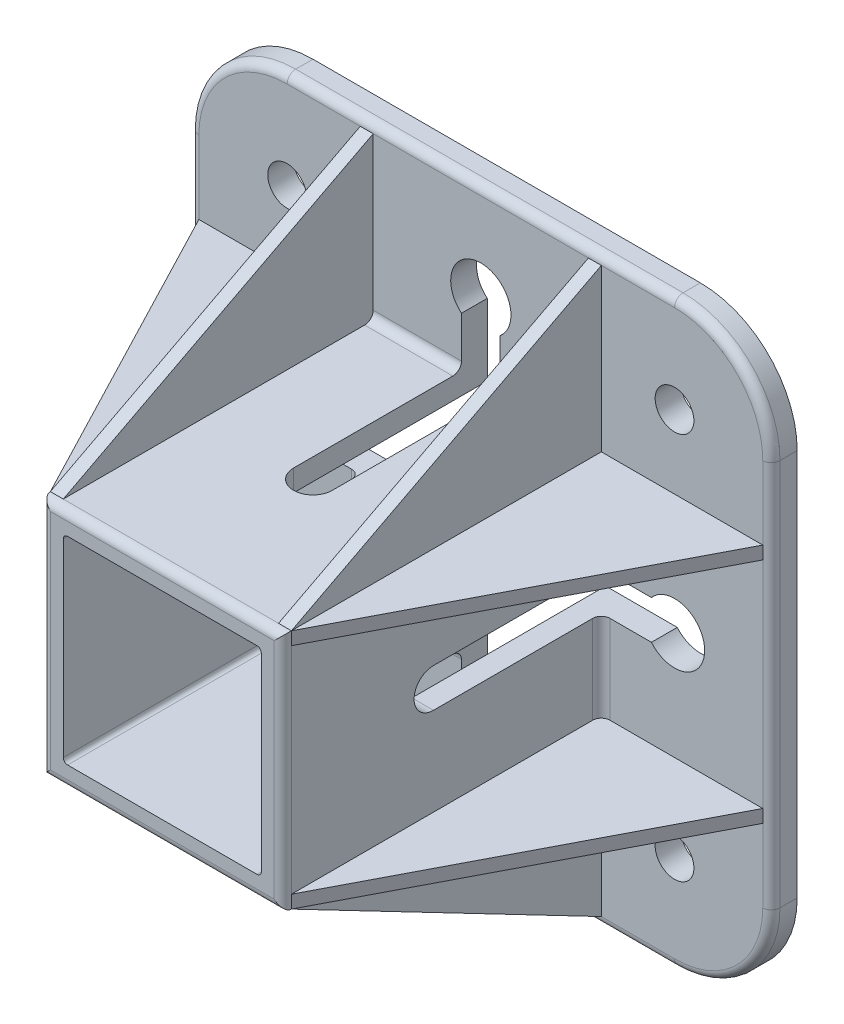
ISO-10303-21;
HEADER;
FILE_DESCRIPTION(('STEP AP214'),'2;1');
FILE_NAME('part.step','',(''),(''),'','','');
FILE_SCHEMA(('AUTOMOTIVE_DESIGN { 1 0 10303 214 1 1 1 1 }'));
ENDSEC;
DATA;
#1=APPLICATION_CONTEXT('core data for automotive mechanical design processes');
#2=APPLICATION_PROTOCOL_DEFINITION('international standard','automotive_design',2000,#1);
#3=PRODUCT_CONTEXT('',#1,'mechanical');
#4=PRODUCT('Part','Part','',(#3));
#5=PRODUCT_RELATED_PRODUCT_CATEGORY('part','',(#4));
#6=PRODUCT_DEFINITION_FORMATION('','',#4);
#7=PRODUCT_DEFINITION_CONTEXT('part definition',#1,'design');
#8=PRODUCT_DEFINITION('design','',#6,#7);
#9=PRODUCT_DEFINITION_SHAPE('','',#8);
#10=(LENGTH_UNIT() NAMED_UNIT(*) SI_UNIT(.MILLI.,.METRE.));
#11=(NAMED_UNIT(*) PLANE_ANGLE_UNIT() SI_UNIT($,.RADIAN.));
#12=(NAMED_UNIT(*) SI_UNIT($,.STERADIAN.) SOLID_ANGLE_UNIT());
#13=UNCERTAINTY_MEASURE_WITH_UNIT(LENGTH_MEASURE(1.E-05),#10,'distance_accuracy_value','');
#14=(GEOMETRIC_REPRESENTATION_CONTEXT(3) GLOBAL_UNCERTAINTY_ASSIGNED_CONTEXT((#13)) GLOBAL_UNIT_ASSIGNED_CONTEXT((#10,
#11,#12)) REPRESENTATION_CONTEXT('',''));
#15=CARTESIAN_POINT('',(0.,0.,0.));
#16=DIRECTION('',(0.,0.,1.));
#17=DIRECTION('',(1.,0.,0.));
#18=AXIS2_PLACEMENT_3D('',#15,#16,#17);
#19=CARTESIAN_POINT('',(-14.1206203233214,29.5536086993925,5.99998799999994));
#20=DIRECTION('',(0.88691408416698,0.,0.461934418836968));
#21=DIRECTION('',(0.461934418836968,0.,-0.88691408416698));
#22=AXIS2_PLACEMENT_3D('',#19,#20,#21);
#23=PLANE('',#22);
#24=DIRECTION('',(0.461934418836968,0.,-0.88691408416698));
#25=VECTOR('',#24,1.);
#26=CARTESIAN_POINT('',(-51.6205453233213,29.5536086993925,77.999844));
#27=LINE('',#26,#25);
#28=CARTESIAN_POINT('',(-51.6205453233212,29.5536086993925,77.9998439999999));
#29=VERTEX_POINT('',#28);
#30=CARTESIAN_POINT('',(-14.1206203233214,29.5536086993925,5.99998799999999));
#31=VERTEX_POINT('',#30);
#32=EDGE_CURVE('E945',#29,#31,#27,.T.);
#33=ORIENTED_EDGE('',*,*,#32,.T.);
#34=DIRECTION('',(0.,-1.,0.));
#35=VECTOR('',#34,1.);
#36=CARTESIAN_POINT('',(-14.1206203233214,4.5536586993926,5.999988));
#37=LINE('',#36,#35);
#38=CARTESIAN_POINT('',(-14.1206203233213,32.5536026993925,5.999988));
#39=VERTEX_POINT('',#38);
#40=EDGE_CURVE('E973',#39,#31,#37,.T.);
#41=ORIENTED_EDGE('',*,*,#40,.F.);
#42=DIRECTION('',(0.461934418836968,0.,-0.88691408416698));
#43=VECTOR('',#42,1.);
#44=CARTESIAN_POINT('',(-14.1206203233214,32.5536026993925,5.99998799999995));
#45=LINE('',#44,#43);
#46=CARTESIAN_POINT('',(-51.6205453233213,32.5536026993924,77.999844));
#47=VERTEX_POINT('',#46);
#48=EDGE_CURVE('E924',#39,#47,#45,.F.);
#49=ORIENTED_EDGE('',*,*,#48,.T.);
#50=DIRECTION('',(0.,-1.,0.));
#51=VECTOR('',#50,1.);
#52=CARTESIAN_POINT('',(-51.6205453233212,18.3036311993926,77.9998439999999));
#53=LINE('',#52,#51);
#54=EDGE_CURVE('E1632',#29,#47,#53,.F.);
#55=ORIENTED_EDGE('',*,*,#54,.F.);
#56=EDGE_LOOP('',(#33,#41,#49,#55));
#57=FACE_BOUND('',#56,.T.);
#58=ADVANCED_FACE('F15',(#57),#23,.T.);
#59=CARTESIAN_POINT('',(-51.6205453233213,-23.4462853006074,77.999844));
#60=DIRECTION('',(0.88691408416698,0.,0.461934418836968));
#61=DIRECTION('',(0.461934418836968,0.,-0.88691408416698));
#62=AXIS2_PLACEMENT_3D('',#59,#60,#61);
#63=PLANE('',#62);
#64=DIRECTION('',(0.461934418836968,0.,-0.88691408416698));
#65=VECTOR('',#64,1.);
#66=CARTESIAN_POINT('',(-51.6205453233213,-20.4462913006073,77.999844));
#67=LINE('',#66,#65);
#68=CARTESIAN_POINT('',(-14.1206203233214,-20.4462913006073,5.999988));
#69=VERTEX_POINT('',#68);
#70=CARTESIAN_POINT('',(-51.6205453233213,-20.4462913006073,77.999844));
#71=VERTEX_POINT('',#70);
#72=EDGE_CURVE('E942',#69,#71,#67,.F.);
#73=ORIENTED_EDGE('',*,*,#72,.T.);
#74=DIRECTION('',(0.,-1.,0.));
#75=VECTOR('',#74,1.);
#76=CARTESIAN_POINT('',(-51.6205453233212,18.3036311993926,77.9998439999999));
#77=LINE('',#76,#75);
#78=CARTESIAN_POINT('',(-51.6205453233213,-23.4462853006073,77.999844));
#79=VERTEX_POINT('',#78);
#80=EDGE_CURVE('E944',#79,#71,#77,.F.);
#81=ORIENTED_EDGE('',*,*,#80,.F.);
#82=DIRECTION('',(-0.461934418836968,0.,0.88691408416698));
#83=VECTOR('',#82,1.);
#84=CARTESIAN_POINT('',(-14.1206203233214,-23.4462853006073,5.99998799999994));
#85=LINE('',#84,#83);
#86=CARTESIAN_POINT('',(-14.1206203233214,-23.4462853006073,5.999988));
#87=VERTEX_POINT('',#86);
#88=EDGE_CURVE('E913',#87,#79,#85,.T.);
#89=ORIENTED_EDGE('',*,*,#88,.F.);
#90=DIRECTION('',(0.,-1.,0.));
#91=VECTOR('',#90,1.);
#92=CARTESIAN_POINT('',(-14.1206203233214,4.5536586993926,5.999988));
#93=LINE('',#92,#91);
#94=EDGE_CURVE('E807',#69,#87,#93,.T.);
#95=ORIENTED_EDGE('',*,*,#94,.F.);
#96=EDGE_LOOP('',(#73,#81,#89,#95));
#97=FACE_BOUND('',#96,.T.);
#98=ADVANCED_FACE('F1596',(#97),#63,.T.);
#99=CARTESIAN_POINT('',(-54.6205393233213,-60.9462103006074,5.99998799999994));
#100=DIRECTION('',(0.,-0.88691408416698,0.461934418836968));
#101=DIRECTION('',(0.,-0.461934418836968,-0.88691408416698));
#102=AXIS2_PLACEMENT_3D('',#99,#100,#101);
#103=PLANE('',#102);
#104=DIRECTION('',(0.,-0.461934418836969,-0.886914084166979));
#105=VECTOR('',#104,1.);
#106=CARTESIAN_POINT('',(-54.6205393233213,-23.4462853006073,77.999844));
#107=LINE('',#106,#105);
#108=CARTESIAN_POINT('',(-54.6205393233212,-23.4462853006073,77.999844));
#109=VERTEX_POINT('',#108);
#110=CARTESIAN_POINT('',(-54.6205393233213,-60.9462103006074,5.999988));
#111=VERTEX_POINT('',#110);
#112=EDGE_CURVE('E947',#109,#111,#107,.T.);
#113=ORIENTED_EDGE('',*,*,#112,.T.);
#114=DIRECTION('',(-1.,0.,0.));
#115=VECTOR('',#114,1.);
#116=CARTESIAN_POINT('',(-34.6205793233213,-60.9462103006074,5.999988));
#117=LINE('',#116,#115);
#118=CARTESIAN_POINT('',(-51.6205453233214,-60.9462103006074,5.999988));
#119=VERTEX_POINT('',#118);
#120=EDGE_CURVE('E791',#119,#111,#117,.T.);
#121=ORIENTED_EDGE('',*,*,#120,.F.);
#122=DIRECTION('',(0.,-0.461934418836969,-0.886914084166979));
#123=VECTOR('',#122,1.);
#124=CARTESIAN_POINT('',(-51.6205453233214,-23.4462853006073,77.999844));
#125=LINE('',#124,#123);
#126=EDGE_CURVE('E917',#79,#119,#125,.T.);
#127=ORIENTED_EDGE('',*,*,#126,.F.);
#128=DIRECTION('',(-1.,0.,0.));
#129=VECTOR('',#128,1.);
#130=CARTESIAN_POINT('',(-95.8704568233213,-23.4462853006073,77.9998439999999));
#131=LINE('',#130,#129);
#132=EDGE_CURVE('E933',#109,#79,#131,.F.);
#133=ORIENTED_EDGE('',*,*,#132,.F.);
#134=EDGE_LOOP('',(#113,#121,#127,#133));
#135=FACE_BOUND('',#134,.T.);
#136=ADVANCED_FACE('F1779',(#135),#103,.T.);
#137=CARTESIAN_POINT('',(-107.620433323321,-23.4462853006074,77.9998440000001));
#138=DIRECTION('',(0.,-0.88691408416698,0.461934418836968));
#139=DIRECTION('',(0.,-0.461934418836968,-0.88691408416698));
#140=AXIS2_PLACEMENT_3D('',#137,#138,#139);
#141=PLANE('',#140);
#142=DIRECTION('',(0.,-0.461934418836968,-0.88691408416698));
#143=VECTOR('',#142,1.);
#144=CARTESIAN_POINT('',(-104.620439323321,-23.4462853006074,77.9998440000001));
#145=LINE('',#144,#143);
#146=CARTESIAN_POINT('',(-104.620439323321,-60.9462103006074,5.99998799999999));
#147=VERTEX_POINT('',#146);
#148=CARTESIAN_POINT('',(-104.620439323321,-23.4462853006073,77.9998440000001));
#149=VERTEX_POINT('',#148);
#150=EDGE_CURVE('E946',#147,#149,#145,.F.);
#151=ORIENTED_EDGE('',*,*,#150,.T.);
#152=DIRECTION('',(-1.,0.,0.));
#153=VECTOR('',#152,1.);
#154=CARTESIAN_POINT('',(-95.8704568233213,-23.4462853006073,77.9998439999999));
#155=LINE('',#154,#153);
#156=CARTESIAN_POINT('',(-107.620433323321,-23.4462853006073,77.999844));
#157=VERTEX_POINT('',#156);
#158=EDGE_CURVE('E1614',#157,#149,#155,.F.);
#159=ORIENTED_EDGE('',*,*,#158,.F.);
#160=DIRECTION('',(0.,0.461934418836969,0.886914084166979));
#161=VECTOR('',#160,1.);
#162=CARTESIAN_POINT('',(-107.620433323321,-60.9462103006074,5.99998799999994));
#163=LINE('',#162,#161);
#164=CARTESIAN_POINT('',(-107.620433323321,-60.9462103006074,5.999988));
#165=VERTEX_POINT('',#164);
#166=EDGE_CURVE('E882',#165,#157,#163,.T.);
#167=ORIENTED_EDGE('',*,*,#166,.F.);
#168=DIRECTION('',(-1.,0.,0.));
#169=VECTOR('',#168,1.);
#170=CARTESIAN_POINT('',(-34.6205793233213,-60.9462103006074,5.999988));
#171=LINE('',#170,#169);
#172=EDGE_CURVE('E794',#147,#165,#171,.T.);
#173=ORIENTED_EDGE('',*,*,#172,.F.);
#174=EDGE_LOOP('',(#151,#159,#167,#173));
#175=FACE_BOUND('',#174,.T.);
#176=ADVANCED_FACE('F1977',(#175),#141,.T.);
#177=CARTESIAN_POINT('',(-145.120358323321,-20.4462913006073,5.99998799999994));
#178=DIRECTION('',(-0.88691408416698,0.,0.461934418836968));
#179=DIRECTION('',(0.461934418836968,0.,0.88691408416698));
#180=AXIS2_PLACEMENT_3D('',#177,#178,#179);
#181=PLANE('',#180);
#182=DIRECTION('',(-0.461934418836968,0.,-0.88691408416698));
#183=VECTOR('',#182,1.);
#184=CARTESIAN_POINT('',(-107.620433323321,-20.4462913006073,77.999844));
#185=LINE('',#184,#183);
#186=CARTESIAN_POINT('',(-107.620433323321,-20.4462913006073,77.999844));
#187=VERTEX_POINT('',#186);
#188=CARTESIAN_POINT('',(-145.120358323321,-20.4462913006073,5.99998799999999));
#189=VERTEX_POINT('',#188);
#190=EDGE_CURVE('E948',#187,#189,#185,.T.);
#191=ORIENTED_EDGE('',*,*,#190,.T.);
#192=DIRECTION('',(0.,1.,0.));
#193=VECTOR('',#192,1.);
#194=CARTESIAN_POINT('',(-145.120358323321,-51.6962288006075,5.999988));
#195=LINE('',#194,#193);
#196=CARTESIAN_POINT('',(-145.120358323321,-23.4462853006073,5.999988));
#197=VERTEX_POINT('',#196);
#198=EDGE_CURVE('E786',#197,#189,#195,.T.);
#199=ORIENTED_EDGE('',*,*,#198,.F.);
#200=DIRECTION('',(-0.461934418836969,0.,-0.886914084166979));
#201=VECTOR('',#200,1.);
#202=CARTESIAN_POINT('',(-107.620433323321,-23.4462853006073,77.999844));
#203=LINE('',#202,#201);
#204=EDGE_CURVE('E897',#157,#197,#203,.T.);
#205=ORIENTED_EDGE('',*,*,#204,.F.);
#206=DIRECTION('',(0.,-1.,0.));
#207=VECTOR('',#206,1.);
#208=CARTESIAN_POINT('',(-107.620433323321,18.3036311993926,77.999844));
#209=LINE('',#208,#207);
#210=EDGE_CURVE('E1617',#187,#157,#209,.T.);
#211=ORIENTED_EDGE('',*,*,#210,.F.);
#212=EDGE_LOOP('',(#191,#199,#205,#211));
#213=FACE_BOUND('',#212,.T.);
#214=ADVANCED_FACE('F1675',(#213),#181,.T.);
#215=CARTESIAN_POINT('',(-107.620433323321,32.5536026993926,77.999844));
#216=DIRECTION('',(-0.88691408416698,0.,0.461934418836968));
#217=DIRECTION('',(-0.461934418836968,0.,-0.88691408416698));
#218=AXIS2_PLACEMENT_3D('',#215,#216,#217);
#219=PLANE('',#218);
#220=DIRECTION('',(-0.461934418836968,0.,-0.88691408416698));
#221=VECTOR('',#220,1.);
#222=CARTESIAN_POINT('',(-107.620433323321,29.5536086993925,77.999844));
#223=LINE('',#222,#221);
#224=CARTESIAN_POINT('',(-145.120358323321,29.5536086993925,5.999988));
#225=VERTEX_POINT('',#224);
#226=CARTESIAN_POINT('',(-107.620433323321,29.5536086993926,77.999844));
#227=VERTEX_POINT('',#226);
#228=EDGE_CURVE('E949',#225,#227,#223,.F.);
#229=ORIENTED_EDGE('',*,*,#228,.T.);
#230=DIRECTION('',(0.,-1.,0.));
#231=VECTOR('',#230,1.);
#232=CARTESIAN_POINT('',(-107.620433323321,18.3036311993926,77.9998439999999));
#233=LINE('',#232,#231);
#234=CARTESIAN_POINT('',(-107.620433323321,32.5536026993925,77.9998439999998));
#235=VERTEX_POINT('',#234);
#236=EDGE_CURVE('E937',#235,#227,#233,.T.);
#237=ORIENTED_EDGE('',*,*,#236,.F.);
#238=DIRECTION('',(0.461934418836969,0.,0.886914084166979));
#239=VECTOR('',#238,1.);
#240=CARTESIAN_POINT('',(-145.120358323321,32.5536026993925,5.99998799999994));
#241=LINE('',#240,#239);
#242=CARTESIAN_POINT('',(-145.120358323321,32.5536026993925,5.999988));
#243=VERTEX_POINT('',#242);
#244=EDGE_CURVE('E906',#243,#235,#241,.T.);
#245=ORIENTED_EDGE('',*,*,#244,.F.);
#246=DIRECTION('',(0.,1.,0.));
#247=VECTOR('',#246,1.);
#248=CARTESIAN_POINT('',(-145.120358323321,-51.6962288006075,5.999988));
#249=LINE('',#248,#247);
#250=EDGE_CURVE('E778',#225,#243,#249,.T.);
#251=ORIENTED_EDGE('',*,*,#250,.F.);
#252=EDGE_LOOP('',(#229,#237,#245,#251));
#253=FACE_BOUND('',#252,.T.);
#254=ADVANCED_FACE('F1964',(#253),#219,.T.);
#255=CARTESIAN_POINT('',(-104.620439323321,70.0535276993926,5.99998799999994));
#256=DIRECTION('',(0.,0.88691408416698,0.461934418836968));
#257=DIRECTION('',(0.,-0.461934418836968,0.88691408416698));
#258=AXIS2_PLACEMENT_3D('',#255,#256,#257);
#259=PLANE('',#258);
#260=DIRECTION('',(0.,0.461934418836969,-0.886914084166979));
#261=VECTOR('',#260,1.);
#262=CARTESIAN_POINT('',(-104.620439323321,32.5536026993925,77.999844));
#263=LINE('',#262,#261);
#264=CARTESIAN_POINT('',(-104.620439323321,32.5536026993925,77.999844));
#265=VERTEX_POINT('',#264);
#266=CARTESIAN_POINT('',(-104.620439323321,70.0535276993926,5.999988));
#267=VERTEX_POINT('',#266);
#268=EDGE_CURVE('E950',#265,#267,#263,.T.);
#269=ORIENTED_EDGE('',*,*,#268,.T.);
#270=DIRECTION('',(1.,0.,0.));
#271=VECTOR('',#270,1.);
#272=CARTESIAN_POINT('',(-135.870376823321,70.0535276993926,5.999988));
#273=LINE('',#272,#271);
#274=CARTESIAN_POINT('',(-107.620433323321,70.0535276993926,5.999988));
#275=VERTEX_POINT('',#274);
#276=EDGE_CURVE('E749',#275,#267,#273,.T.);
#277=ORIENTED_EDGE('',*,*,#276,.F.);
#278=DIRECTION('',(0.,0.461934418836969,-0.886914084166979));
#279=VECTOR('',#278,1.);
#280=CARTESIAN_POINT('',(-107.620433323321,32.5536026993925,77.9998439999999));
#281=LINE('',#280,#279);
#282=EDGE_CURVE('E912',#235,#275,#281,.T.);
#283=ORIENTED_EDGE('',*,*,#282,.F.);
#284=DIRECTION('',(1.,0.,0.));
#285=VECTOR('',#284,1.);
#286=CARTESIAN_POINT('',(-84.1204803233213,32.5536026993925,77.999844));
#287=LINE('',#286,#285);
#288=EDGE_CURVE('E941',#265,#235,#287,.F.);
#289=ORIENTED_EDGE('',*,*,#288,.F.);
#290=EDGE_LOOP('',(#269,#277,#283,#289));
#291=FACE_BOUND('',#290,.T.);
#292=ADVANCED_FACE('F1961',(#291),#259,.T.);
#293=CARTESIAN_POINT('',(-51.6205453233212,32.5536026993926,77.999844));
#294=DIRECTION('',(0.,0.88691408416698,0.461934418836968));
#295=DIRECTION('',(0.,0.461934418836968,-0.88691408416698));
#296=AXIS2_PLACEMENT_3D('',#293,#294,#295);
#297=PLANE('',#296);
#298=DIRECTION('',(0.,0.461934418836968,-0.88691408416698));
#299=VECTOR('',#298,1.);
#300=CARTESIAN_POINT('',(-54.6205393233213,32.5536026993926,77.999844));
#301=LINE('',#300,#299);
#302=CARTESIAN_POINT('',(-54.6205393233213,70.0535276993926,5.99998799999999));
#303=VERTEX_POINT('',#302);
#304=CARTESIAN_POINT('',(-54.6205393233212,32.5536026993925,77.9998440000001));
#305=VERTEX_POINT('',#304);
#306=EDGE_CURVE('E19',#303,#305,#301,.F.);
#307=ORIENTED_EDGE('',*,*,#306,.T.);
#308=DIRECTION('',(1.,0.,0.));
#309=VECTOR('',#308,1.);
#310=CARTESIAN_POINT('',(-84.1204803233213,32.5536026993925,77.9998439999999));
#311=LINE('',#310,#309);
#312=EDGE_CURVE('E1263',#47,#305,#311,.F.);
#313=ORIENTED_EDGE('',*,*,#312,.F.);
#314=DIRECTION('',(0.,-0.461934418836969,0.886914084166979));
#315=VECTOR('',#314,1.);
#316=CARTESIAN_POINT('',(-51.6205453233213,70.0535276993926,5.99998799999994));
#317=LINE('',#316,#315);
#318=CARTESIAN_POINT('',(-51.6205453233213,70.0535276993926,5.999988));
#319=VERTEX_POINT('',#318);
#320=EDGE_CURVE('E921',#319,#47,#317,.T.);
#321=ORIENTED_EDGE('',*,*,#320,.F.);
#322=DIRECTION('',(1.,0.,0.));
#323=VECTOR('',#322,1.);
#324=CARTESIAN_POINT('',(-135.870376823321,70.0535276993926,5.999988));
#325=LINE('',#324,#323);
#326=EDGE_CURVE('E235',#303,#319,#325,.T.);
#327=ORIENTED_EDGE('',*,*,#326,.F.);
#328=EDGE_LOOP('',(#307,#313,#321,#327));
#329=FACE_BOUND('',#328,.T.);
#330=ADVANCED_FACE('F1958',(#329),#297,.T.);
#331=CARTESIAN_POINT('',(-54.6205393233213,32.5536026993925,77.999844));
#332=DIRECTION('',(1.,0.,0.));
#333=DIRECTION('',(0.,0.,-1.));
#334=AXIS2_PLACEMENT_3D('',#331,#332,#333);
#335=PLANE('',#334);
#336=DIRECTION('',(0.,0.,1.));
#337=VECTOR('',#336,1.);
#338=CARTESIAN_POINT('',(-54.6205393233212,32.5536026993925,42.999914));
#339=LINE('',#338,#337);
#340=CARTESIAN_POINT('',(-54.6205393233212,32.5536026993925,7.99998399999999));
#341=VERTEX_POINT('',#340);
#342=EDGE_CURVE('E730',#341,#305,#339,.T.);
#343=ORIENTED_EDGE('',*,*,#342,.T.);
#344=ORIENTED_EDGE('',*,*,#306,.F.);
#345=DIRECTION('',(0.,1.,0.));
#346=VECTOR('',#345,1.);
#347=CARTESIAN_POINT('',(-54.6205393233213,-62.9462063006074,5.999988));
#348=LINE('',#347,#346);
#349=CARTESIAN_POINT('',(-54.6205393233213,34.5535986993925,5.999988));
#350=VERTEX_POINT('',#349);
#351=EDGE_CURVE('E726',#303,#350,#348,.F.);
#352=ORIENTED_EDGE('',*,*,#351,.T.);
#353=CARTESIAN_POINT('',(-54.6205393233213,34.5535986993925,7.999984));
#354=DIRECTION('',(1.,0.,0.));
#355=DIRECTION('',(0.,0.,-1.));
#356=AXIS2_PLACEMENT_3D('',#353,#354,#355);
#357=CIRCLE('',#356,1.999996);
#358=EDGE_CURVE('E731',#350,#341,#357,.F.);
#359=ORIENTED_EDGE('',*,*,#358,.T.);
#360=EDGE_LOOP('',(#343,#344,#352,#359));
#361=FACE_BOUND('',#360,.T.);
#362=ADVANCED_FACE('F1249',(#361),#335,.F.);
#363=CARTESIAN_POINT('',(-104.620439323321,40.9285859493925,41.9999159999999));
#364=DIRECTION('',(-1.,0.,0.));
#365=DIRECTION('',(0.,0.,1.));
#366=AXIS2_PLACEMENT_3D('',#363,#364,#365);
#367=PLANE('',#366);
#368=DIRECTION('',(0.,1.,0.));
#369=VECTOR('',#368,1.);
#370=CARTESIAN_POINT('',(-104.620439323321,-62.9462063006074,5.999988));
#371=LINE('',#370,#369);
#372=CARTESIAN_POINT('',(-104.620439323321,34.5535986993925,5.999988));
#373=VERTEX_POINT('',#372);
#374=EDGE_CURVE('E718',#373,#267,#371,.T.);
#375=ORIENTED_EDGE('',*,*,#374,.T.);
#376=ORIENTED_EDGE('',*,*,#268,.F.);
#377=DIRECTION('',(0.,0.,-1.));
#378=VECTOR('',#377,1.);
#379=CARTESIAN_POINT('',(-104.620439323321,32.5536026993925,42.999914));
#380=LINE('',#379,#378);
#381=CARTESIAN_POINT('',(-104.620439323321,32.5536026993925,7.999984));
#382=VERTEX_POINT('',#381);
#383=EDGE_CURVE('E724',#265,#382,#380,.T.);
#384=ORIENTED_EDGE('',*,*,#383,.T.);
#385=CARTESIAN_POINT('',(-104.620439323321,34.5535986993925,7.999984));
#386=DIRECTION('',(1.,0.,0.));
#387=DIRECTION('',(0.,0.,-1.));
#388=AXIS2_PLACEMENT_3D('',#385,#386,#387);
#389=CIRCLE('',#388,1.999996);
#390=EDGE_CURVE('E723',#382,#373,#389,.T.);
#391=ORIENTED_EDGE('',*,*,#390,.T.);
#392=EDGE_LOOP('',(#375,#376,#384,#391));
#393=FACE_BOUND('',#392,.T.);
#394=ADVANCED_FACE('F1266',(#393),#367,.F.);
#395=CARTESIAN_POINT('',(-107.620433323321,29.5536086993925,77.999844));
#396=DIRECTION('',(0.,1.,0.));
#397=DIRECTION('',(0.,0.,-1.));
#398=AXIS2_PLACEMENT_3D('',#395,#396,#397);
#399=PLANE('',#398);
#400=DIRECTION('',(0.,0.,1.));
#401=VECTOR('',#400,1.);
#402=CARTESIAN_POINT('',(-107.620433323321,29.5536086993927,5.99998799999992));
#403=LINE('',#402,#401);
#404=CARTESIAN_POINT('',(-107.620433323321,29.5536086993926,7.999984));
#405=VERTEX_POINT('',#404);
#406=EDGE_CURVE('E710',#227,#405,#403,.F.);
#407=ORIENTED_EDGE('',*,*,#406,.F.);
#408=ORIENTED_EDGE('',*,*,#228,.F.);
#409=DIRECTION('',(-1.,0.,0.));
#410=VECTOR('',#409,1.);
#411=CARTESIAN_POINT('',(-34.6205793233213,29.5536086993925,5.999988));
#412=LINE('',#411,#410);
#413=CARTESIAN_POINT('',(-109.620429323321,29.5536086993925,5.999988));
#414=VERTEX_POINT('',#413);
#415=EDGE_CURVE('E707',#225,#414,#412,.F.);
#416=ORIENTED_EDGE('',*,*,#415,.T.);
#417=CARTESIAN_POINT('',(-109.620429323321,29.5536086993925,7.999984));
#418=DIRECTION('',(0.,1.,0.));
#419=DIRECTION('',(-1.,0.,0.));
#420=AXIS2_PLACEMENT_3D('',#417,#418,#419);
#421=CIRCLE('',#420,1.999996);
#422=EDGE_CURVE('E1241',#414,#405,#421,.F.);
#423=ORIENTED_EDGE('',*,*,#422,.T.);
#424=EDGE_LOOP('',(#407,#408,#416,#423));
#425=FACE_BOUND('',#424,.T.);
#426=ADVANCED_FACE('F1685',(#425),#399,.F.);
#427=CARTESIAN_POINT('',(-115.995416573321,-20.4462913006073,41.9999159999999));
#428=DIRECTION('',(0.,-1.,0.));
#429=DIRECTION('',(0.,0.,-1.));
#430=AXIS2_PLACEMENT_3D('',#427,#428,#429);
#431=PLANE('',#430);
#432=DIRECTION('',(-1.,0.,0.));
#433=VECTOR('',#432,1.);
#434=CARTESIAN_POINT('',(-34.6205793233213,-20.4462913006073,5.999988));
#435=LINE('',#434,#433);
#436=CARTESIAN_POINT('',(-109.620429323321,-20.4462913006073,5.999988));
#437=VERTEX_POINT('',#436);
#438=EDGE_CURVE('E699',#437,#189,#435,.T.);
#439=ORIENTED_EDGE('',*,*,#438,.T.);
#440=ORIENTED_EDGE('',*,*,#190,.F.);
#441=DIRECTION('',(0.,0.,1.));
#442=VECTOR('',#441,1.);
#443=CARTESIAN_POINT('',(-107.620433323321,-20.4462913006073,5.99998799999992));
#444=LINE('',#443,#442);
#445=CARTESIAN_POINT('',(-107.620433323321,-20.4462913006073,7.999984));
#446=VERTEX_POINT('',#445);
#447=EDGE_CURVE('E1243',#446,#187,#444,.T.);
#448=ORIENTED_EDGE('',*,*,#447,.F.);
#449=CARTESIAN_POINT('',(-109.620429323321,-20.4462913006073,7.999984));
#450=DIRECTION('',(0.,1.,0.));
#451=DIRECTION('',(-1.,0.,0.));
#452=AXIS2_PLACEMENT_3D('',#449,#450,#451);
#453=CIRCLE('',#452,1.999996);
#454=EDGE_CURVE('E704',#446,#437,#453,.T.);
#455=ORIENTED_EDGE('',*,*,#454,.T.);
#456=EDGE_LOOP('',(#439,#440,#448,#455));
#457=FACE_BOUND('',#456,.T.);
#458=ADVANCED_FACE('F1677',(#457),#431,.F.);
#459=CARTESIAN_POINT('',(-104.620439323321,-23.4462853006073,77.999844));
#460=DIRECTION('',(-1.,0.,0.));
#461=DIRECTION('',(0.,0.,-1.));
#462=AXIS2_PLACEMENT_3D('',#459,#460,#461);
#463=PLANE('',#462);
#464=DIRECTION('',(0.,0.,-1.));
#465=VECTOR('',#464,1.);
#466=CARTESIAN_POINT('',(-104.620439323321,-23.4462853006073,42.999914));
#467=LINE('',#466,#465);
#468=CARTESIAN_POINT('',(-104.620439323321,-23.4462853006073,7.999984));
#469=VERTEX_POINT('',#468);
#470=EDGE_CURVE('E691',#149,#469,#467,.T.);
#471=ORIENTED_EDGE('',*,*,#470,.F.);
#472=ORIENTED_EDGE('',*,*,#150,.F.);
#473=DIRECTION('',(0.,1.,0.));
#474=VECTOR('',#473,1.);
#475=CARTESIAN_POINT('',(-104.620439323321,-62.9462063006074,5.999988));
#476=LINE('',#475,#474);
#477=CARTESIAN_POINT('',(-104.620439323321,-25.4462813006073,5.999988));
#478=VERTEX_POINT('',#477);
#479=EDGE_CURVE('E688',#147,#478,#476,.T.);
#480=ORIENTED_EDGE('',*,*,#479,.T.);
#481=CARTESIAN_POINT('',(-104.620439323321,-25.4462813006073,7.999984));
#482=DIRECTION('',(-1.,0.,0.));
#483=DIRECTION('',(0.,-1.,0.));
#484=AXIS2_PLACEMENT_3D('',#481,#482,#483);
#485=CIRCLE('',#484,1.999996);
#486=EDGE_CURVE('E1231',#478,#469,#485,.F.);
#487=ORIENTED_EDGE('',*,*,#486,.T.);
#488=EDGE_LOOP('',(#471,#472,#480,#487));
#489=FACE_BOUND('',#488,.T.);
#490=ADVANCED_FACE('F1770',(#489),#463,.F.);
#491=CARTESIAN_POINT('',(-54.6205393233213,-31.8212685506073,41.9999159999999));
#492=DIRECTION('',(1.,0.,0.));
#493=DIRECTION('',(0.,0.,-1.));
#494=AXIS2_PLACEMENT_3D('',#491,#492,#493);
#495=PLANE('',#494);
#496=DIRECTION('',(0.,1.,0.));
#497=VECTOR('',#496,1.);
#498=CARTESIAN_POINT('',(-54.6205393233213,-62.9462063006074,5.999988));
#499=LINE('',#498,#497);
#500=CARTESIAN_POINT('',(-54.6205393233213,-25.4462813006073,5.999988));
#501=VERTEX_POINT('',#500);
#502=EDGE_CURVE('E680',#501,#111,#499,.F.);
#503=ORIENTED_EDGE('',*,*,#502,.T.);
#504=ORIENTED_EDGE('',*,*,#112,.F.);
#505=DIRECTION('',(0.,0.,1.));
#506=VECTOR('',#505,1.);
#507=CARTESIAN_POINT('',(-54.6205393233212,-23.4462853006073,42.999914));
#508=LINE('',#507,#506);
#509=CARTESIAN_POINT('',(-54.6205393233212,-23.4462853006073,7.999984));
#510=VERTEX_POINT('',#509);
#511=EDGE_CURVE('E1233',#510,#109,#508,.T.);
#512=ORIENTED_EDGE('',*,*,#511,.F.);
#513=CARTESIAN_POINT('',(-54.6205393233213,-25.4462813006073,7.999984));
#514=DIRECTION('',(-1.,0.,0.));
#515=DIRECTION('',(0.,-1.,0.));
#516=AXIS2_PLACEMENT_3D('',#513,#514,#515);
#517=CIRCLE('',#516,1.999996);
#518=EDGE_CURVE('E685',#510,#501,#517,.T.);
#519=ORIENTED_EDGE('',*,*,#518,.T.);
#520=EDGE_LOOP('',(#503,#504,#512,#519));
#521=FACE_BOUND('',#520,.T.);
#522=ADVANCED_FACE('F1783',(#521),#495,.F.);
#523=CARTESIAN_POINT('',(-43.2455620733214,29.5536086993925,41.9999159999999));
#524=DIRECTION('',(0.,1.,0.));
#525=DIRECTION('',(0.,0.,1.));
#526=AXIS2_PLACEMENT_3D('',#523,#524,#525);
#527=PLANE('',#526);
#528=DIRECTION('',(-1.,0.,0.));
#529=VECTOR('',#528,1.);
#530=CARTESIAN_POINT('',(-34.6205793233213,29.5536086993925,5.999988));
#531=LINE('',#530,#529);
#532=CARTESIAN_POINT('',(-49.6205493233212,29.5536086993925,5.999988));
#533=VERTEX_POINT('',#532);
#534=EDGE_CURVE('E656',#533,#31,#531,.F.);
#535=ORIENTED_EDGE('',*,*,#534,.T.);
#536=ORIENTED_EDGE('',*,*,#32,.F.);
#537=DIRECTION('',(0.,0.,1.));
#538=VECTOR('',#537,1.);
#539=CARTESIAN_POINT('',(-51.6205453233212,29.5536086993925,42.999914));
#540=LINE('',#539,#538);
#541=CARTESIAN_POINT('',(-51.6205453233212,29.5536086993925,7.999984));
#542=VERTEX_POINT('',#541);
#543=EDGE_CURVE('E666',#542,#29,#540,.T.);
#544=ORIENTED_EDGE('',*,*,#543,.F.);
#545=CARTESIAN_POINT('',(-49.6205493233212,29.5536086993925,7.999984));
#546=DIRECTION('',(0.,-1.,0.));
#547=DIRECTION('',(1.,0.,0.));
#548=AXIS2_PLACEMENT_3D('',#545,#546,#547);
#549=CIRCLE('',#548,1.999996);
#550=EDGE_CURVE('E661',#542,#533,#549,.T.);
#551=ORIENTED_EDGE('',*,*,#550,.T.);
#552=EDGE_LOOP('',(#535,#536,#544,#551));
#553=FACE_BOUND('',#552,.T.);
#554=ADVANCED_FACE('F1860',(#553),#527,.F.);
#555=CARTESIAN_POINT('',(-51.6205453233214,-20.4462913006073,77.999844));
#556=DIRECTION('',(0.,-1.,0.));
#557=DIRECTION('',(0.,0.,-1.));
#558=AXIS2_PLACEMENT_3D('',#555,#556,#557);
#559=PLANE('',#558);
#560=DIRECTION('',(0.,0.,-1.));
#561=VECTOR('',#560,1.);
#562=CARTESIAN_POINT('',(-51.6205453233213,-20.4462913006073,42.999914));
#563=LINE('',#562,#561);
#564=CARTESIAN_POINT('',(-51.6205453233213,-20.4462913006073,7.999984));
#565=VERTEX_POINT('',#564);
#566=EDGE_CURVE('E667',#71,#565,#563,.T.);
#567=ORIENTED_EDGE('',*,*,#566,.F.);
#568=ORIENTED_EDGE('',*,*,#72,.F.);
#569=DIRECTION('',(-1.,0.,0.));
#570=VECTOR('',#569,1.);
#571=CARTESIAN_POINT('',(-34.6205793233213,-20.4462913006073,5.999988));
#572=LINE('',#571,#570);
#573=CARTESIAN_POINT('',(-49.6205493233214,-20.4462913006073,5.999988));
#574=VERTEX_POINT('',#573);
#575=EDGE_CURVE('E1222',#69,#574,#572,.T.);
#576=ORIENTED_EDGE('',*,*,#575,.T.);
#577=CARTESIAN_POINT('',(-49.6205493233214,-20.4462913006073,7.999984));
#578=DIRECTION('',(0.,-1.,0.));
#579=DIRECTION('',(1.,0.,0.));
#580=AXIS2_PLACEMENT_3D('',#577,#578,#579);
#581=CIRCLE('',#580,1.999996);
#582=EDGE_CURVE('E1224',#574,#565,#581,.F.);
#583=ORIENTED_EDGE('',*,*,#582,.T.);
#584=EDGE_LOOP('',(#567,#568,#576,#583));
#585=FACE_BOUND('',#584,.T.);
#586=ADVANCED_FACE('F1868',(#585),#559,.F.);
#587=CARTESIAN_POINT('',(-53.6205413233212,18.3036311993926,77.9998439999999));
#588=DIRECTION('',(0.,-1.,0.));
#589=DIRECTION('',(1.,0.,0.));
#590=AXIS2_PLACEMENT_3D('',#587,#588,#589);
#591=CYLINDRICAL_SURFACE('',#590,1.999996);
#592=DIRECTION('',(0.,1.,0.));
#593=VECTOR('',#592,1.);
#594=CARTESIAN_POINT('',(-53.6205413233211,4.55365869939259,79.9998399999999));
#595=LINE('',#594,#593);
#596=CARTESIAN_POINT('',(-53.6205413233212,-21.4462893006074,79.9998399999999));
#597=VERTEX_POINT('',#596);
#598=CARTESIAN_POINT('',(-53.6205413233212,30.5536066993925,79.9998399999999));
#599=VERTEX_POINT('',#598);
#600=EDGE_CURVE('E1219',#597,#599,#595,.T.);
#601=ORIENTED_EDGE('',*,*,#600,.F.);
#602=CARTESIAN_POINT('',(-53.6205413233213,-21.4462893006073,77.999844));
#603=DIRECTION('',(-0.707106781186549,-0.707106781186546,0.));
#604=DIRECTION('',(-0.707106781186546,0.707106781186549,0.));
#605=AXIS2_PLACEMENT_3D('',#602,#603,#604);
#606=ELLIPSE('',#605,2.82842146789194,1.999996);
#607=EDGE_CURVE('E930',#79,#597,#606,.T.);
#608=ORIENTED_EDGE('',*,*,#607,.F.);
#609=ORIENTED_EDGE('',*,*,#80,.T.);
#610=DIRECTION('',(0.,-1.,0.));
#611=VECTOR('',#610,1.);
#612=CARTESIAN_POINT('',(-51.6205453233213,4.5536586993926,77.999844));
#613=LINE('',#612,#611);
#614=EDGE_CURVE('E662',#29,#71,#613,.T.);
#615=ORIENTED_EDGE('',*,*,#614,.F.);
#616=ORIENTED_EDGE('',*,*,#54,.T.);
#617=CARTESIAN_POINT('',(-53.6205413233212,30.5536066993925,77.9998439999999));
#618=DIRECTION('',(0.707106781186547,-0.707106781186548,0.));
#619=DIRECTION('',(0.707106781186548,0.707106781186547,0.));
#620=AXIS2_PLACEMENT_3D('',#617,#618,#619);
#621=ELLIPSE('',#620,2.82842146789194,1.999996);
#622=EDGE_CURVE('E938',#599,#47,#621,.F.);
#623=ORIENTED_EDGE('',*,*,#622,.F.);
#624=EDGE_LOOP('',(#601,#608,#609,#615,#616,#623));
#625=FACE_BOUND('',#624,.T.);
#626=ADVANCED_FACE('F1871',(#625),#591,.T.);
#627=CARTESIAN_POINT('',(-84.1204803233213,30.5536066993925,77.9998439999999));
#628=DIRECTION('',(1.,0.,0.));
#629=DIRECTION('',(0.,0.,-1.));
#630=AXIS2_PLACEMENT_3D('',#627,#628,#629);
#631=CYLINDRICAL_SURFACE('',#630,1.999996);
#632=DIRECTION('',(-1.,0.,0.));
#633=VECTOR('',#632,1.);
#634=CARTESIAN_POINT('',(-79.6204893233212,30.5536066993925,79.9998399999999));
#635=LINE('',#634,#633);
#636=CARTESIAN_POINT('',(-105.620437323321,30.5536066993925,79.9998399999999));
#637=VERTEX_POINT('',#636);
#638=EDGE_CURVE('E1621',#599,#637,#635,.T.);
#639=ORIENTED_EDGE('',*,*,#638,.F.);
#640=ORIENTED_EDGE('',*,*,#622,.T.);
#641=ORIENTED_EDGE('',*,*,#312,.T.);
#642=DIRECTION('',(-1.,0.,0.));
#643=VECTOR('',#642,1.);
#644=CARTESIAN_POINT('',(-79.6204893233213,32.5536026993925,77.999844));
#645=LINE('',#644,#643);
#646=EDGE_CURVE('E968',#305,#265,#645,.T.);
#647=ORIENTED_EDGE('',*,*,#646,.T.);
#648=ORIENTED_EDGE('',*,*,#288,.T.);
#649=CARTESIAN_POINT('',(-105.620437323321,30.5536066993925,77.9998439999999));
#650=DIRECTION('',(-0.707106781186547,-0.707106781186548,0.));
#651=DIRECTION('',(0.707106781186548,-0.707106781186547,0.));
#652=AXIS2_PLACEMENT_3D('',#649,#650,#651);
#653=ELLIPSE('',#652,2.82842146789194,1.999996);
#654=EDGE_CURVE('E934',#637,#235,#653,.T.);
#655=ORIENTED_EDGE('',*,*,#654,.F.);
#656=EDGE_LOOP('',(#639,#640,#641,#647,#648,#655));
#657=FACE_BOUND('',#656,.T.);
#658=ADVANCED_FACE('F1262',(#657),#631,.T.);
#659=CARTESIAN_POINT('',(-105.620437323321,18.3036311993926,77.9998439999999));
#660=DIRECTION('',(0.,-1.,0.));
#661=DIRECTION('',(1.,0.,0.));
#662=AXIS2_PLACEMENT_3D('',#659,#660,#661);
#663=CYLINDRICAL_SURFACE('',#662,1.999996);
#664=ORIENTED_EDGE('',*,*,#210,.T.);
#665=CARTESIAN_POINT('',(-105.620437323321,-21.4462893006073,77.999844));
#666=DIRECTION('',(-0.707106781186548,0.707106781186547,0.));
#667=DIRECTION('',(-0.707106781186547,-0.707106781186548,0.));
#668=AXIS2_PLACEMENT_3D('',#665,#666,#667);
#669=ELLIPSE('',#668,2.82842146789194,1.999996);
#670=CARTESIAN_POINT('',(-105.620437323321,-21.4462893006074,79.9998399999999));
#671=VERTEX_POINT('',#670);
#672=EDGE_CURVE('E927',#671,#157,#669,.F.);
#673=ORIENTED_EDGE('',*,*,#672,.F.);
#674=DIRECTION('',(0.,-1.,0.));
#675=VECTOR('',#674,1.);
#676=CARTESIAN_POINT('',(-105.620437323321,4.55365869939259,79.9998399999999));
#677=LINE('',#676,#675);
#678=EDGE_CURVE('E1618',#637,#671,#677,.T.);
#679=ORIENTED_EDGE('',*,*,#678,.F.);
#680=ORIENTED_EDGE('',*,*,#654,.T.);
#681=ORIENTED_EDGE('',*,*,#236,.T.);
#682=DIRECTION('',(0.,1.,0.));
#683=VECTOR('',#682,1.);
#684=CARTESIAN_POINT('',(-107.620433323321,9.05364969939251,77.999844));
#685=LINE('',#684,#683);
#686=EDGE_CURVE('E1667',#187,#227,#685,.T.);
#687=ORIENTED_EDGE('',*,*,#686,.F.);
#688=EDGE_LOOP('',(#664,#673,#679,#680,#681,#687));
#689=FACE_BOUND('',#688,.T.);
#690=ADVANCED_FACE('F1673',(#689),#663,.T.);
#691=CARTESIAN_POINT('',(-95.8704568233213,-21.4462893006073,77.9998439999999));
#692=DIRECTION('',(-1.,0.,0.));
#693=DIRECTION('',(0.,-1.,0.));
#694=AXIS2_PLACEMENT_3D('',#691,#692,#693);
#695=CYLINDRICAL_SURFACE('',#694,1.999996);
#696=DIRECTION('',(1.,0.,0.));
#697=VECTOR('',#696,1.);
#698=CARTESIAN_POINT('',(-79.6204893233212,-21.4462893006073,79.9998399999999));
#699=LINE('',#698,#697);
#700=EDGE_CURVE('E424',#671,#597,#699,.T.);
#701=ORIENTED_EDGE('',*,*,#700,.F.);
#702=ORIENTED_EDGE('',*,*,#672,.T.);
#703=ORIENTED_EDGE('',*,*,#158,.T.);
#704=DIRECTION('',(-1.,0.,0.));
#705=VECTOR('',#704,1.);
#706=CARTESIAN_POINT('',(-79.6204893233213,-23.4462853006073,77.999844));
#707=LINE('',#706,#705);
#708=EDGE_CURVE('E1657',#109,#149,#707,.T.);
#709=ORIENTED_EDGE('',*,*,#708,.F.);
#710=ORIENTED_EDGE('',*,*,#132,.T.);
#711=ORIENTED_EDGE('',*,*,#607,.T.);
#712=EDGE_LOOP('',(#701,#702,#703,#709,#710,#711));
#713=FACE_BOUND('',#712,.T.);
#714=ADVANCED_FACE('F1785',(#713),#695,.T.);
#715=CARTESIAN_POINT('',(-14.1206203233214,32.5536026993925,5.99998799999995));
#716=DIRECTION('',(0.,-1.,0.));
#717=DIRECTION('',(0.,0.,1.));
#718=AXIS2_PLACEMENT_3D('',#715,#716,#717);
#719=PLANE('',#718);
#720=ORIENTED_EDGE('',*,*,#48,.F.);
#721=DIRECTION('',(-1.,0.,0.));
#722=VECTOR('',#721,1.);
#723=CARTESIAN_POINT('',(-34.6205793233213,32.5536026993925,5.999988));
#724=LINE('',#723,#722);
#725=CARTESIAN_POINT('',(-51.6205453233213,32.5536026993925,5.99998799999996));
#726=VERTEX_POINT('',#725);
#727=EDGE_CURVE('E636',#39,#726,#724,.T.);
#728=ORIENTED_EDGE('',*,*,#727,.T.);
#729=DIRECTION('',(0.,0.,-1.));
#730=VECTOR('',#729,1.);
#731=CARTESIAN_POINT('',(-51.6205453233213,32.5536026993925,41.999916));
#732=LINE('',#731,#730);
#733=EDGE_CURVE('E920',#47,#726,#732,.T.);
#734=ORIENTED_EDGE('',*,*,#733,.F.);
#735=EDGE_LOOP('',(#720,#728,#734));
#736=FACE_BOUND('',#735,.T.);
#737=ADVANCED_FACE('F1954',(#736),#719,.F.);
#738=CARTESIAN_POINT('',(-51.6205453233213,32.5536026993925,77.999844));
#739=DIRECTION('',(1.,0.,0.));
#740=DIRECTION('',(0.,0.,-1.));
#741=AXIS2_PLACEMENT_3D('',#738,#739,#740);
#742=PLANE('',#741);
#743=ORIENTED_EDGE('',*,*,#733,.T.);
#744=DIRECTION('',(0.,1.,0.));
#745=VECTOR('',#744,1.);
#746=CARTESIAN_POINT('',(-51.6205453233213,-62.9462063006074,5.999988));
#747=LINE('',#746,#745);
#748=EDGE_CURVE('E630',#726,#319,#747,.T.);
#749=ORIENTED_EDGE('',*,*,#748,.T.);
#750=ORIENTED_EDGE('',*,*,#320,.T.);
#751=EDGE_LOOP('',(#743,#749,#750));
#752=FACE_BOUND('',#751,.T.);
#753=ADVANCED_FACE('F1957',(#752),#742,.T.);
#754=CARTESIAN_POINT('',(-51.6205453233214,-23.4462853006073,5.99998799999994));
#755=DIRECTION('',(1.,0.,0.));
#756=DIRECTION('',(0.,0.,1.));
#757=AXIS2_PLACEMENT_3D('',#754,#755,#756);
#758=PLANE('',#757);
#759=ORIENTED_EDGE('',*,*,#126,.T.);
#760=DIRECTION('',(0.,1.,0.));
#761=VECTOR('',#760,1.);
#762=CARTESIAN_POINT('',(-51.6205453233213,-62.9462063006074,5.999988));
#763=LINE('',#762,#761);
#764=CARTESIAN_POINT('',(-51.6205453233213,-23.4462853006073,5.99998799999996));
#765=VERTEX_POINT('',#764);
#766=EDGE_CURVE('E624',#119,#765,#763,.T.);
#767=ORIENTED_EDGE('',*,*,#766,.T.);
#768=DIRECTION('',(0.,0.,-1.));
#769=VECTOR('',#768,1.);
#770=CARTESIAN_POINT('',(-51.6205453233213,-23.4462853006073,41.999916));
#771=LINE('',#770,#769);
#772=EDGE_CURVE('E916',#79,#765,#771,.T.);
#773=ORIENTED_EDGE('',*,*,#772,.F.);
#774=EDGE_LOOP('',(#759,#767,#773));
#775=FACE_BOUND('',#774,.T.);
#776=ADVANCED_FACE('F1589',(#775),#758,.T.);
#777=CARTESIAN_POINT('',(-51.6205453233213,-23.4462853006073,77.999844));
#778=DIRECTION('',(0.,-1.,0.));
#779=DIRECTION('',(0.,0.,-1.));
#780=AXIS2_PLACEMENT_3D('',#777,#778,#779);
#781=PLANE('',#780);
#782=ORIENTED_EDGE('',*,*,#772,.T.);
#783=DIRECTION('',(-1.,0.,0.));
#784=VECTOR('',#783,1.);
#785=CARTESIAN_POINT('',(-34.6205793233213,-23.4462853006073,5.999988));
#786=LINE('',#785,#784);
#787=EDGE_CURVE('E603',#765,#87,#786,.F.);
#788=ORIENTED_EDGE('',*,*,#787,.T.);
#789=ORIENTED_EDGE('',*,*,#88,.T.);
#790=EDGE_LOOP('',(#782,#788,#789));
#791=FACE_BOUND('',#790,.T.);
#792=ADVANCED_FACE('F1593',(#791),#781,.T.);
#793=CARTESIAN_POINT('',(-107.620433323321,9.05364969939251,5.99998799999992));
#794=DIRECTION('',(-1.,0.,0.));
#795=DIRECTION('',(0.,0.,1.));
#796=AXIS2_PLACEMENT_3D('',#793,#794,#795);
#797=PLANE('',#796);
#798=ORIENTED_EDGE('',*,*,#282,.T.);
#799=DIRECTION('',(0.,1.,0.));
#800=VECTOR('',#799,1.);
#801=CARTESIAN_POINT('',(-107.620433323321,-62.9462063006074,5.999988));
#802=LINE('',#801,#800);
#803=CARTESIAN_POINT('',(-107.620433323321,32.5536026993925,5.99998799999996));
#804=VERTEX_POINT('',#803);
#805=EDGE_CURVE('E596',#275,#804,#802,.F.);
#806=ORIENTED_EDGE('',*,*,#805,.T.);
#807=DIRECTION('',(0.,0.,-1.));
#808=VECTOR('',#807,1.);
#809=CARTESIAN_POINT('',(-107.620433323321,32.5536026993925,41.9999159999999));
#810=LINE('',#809,#808);
#811=EDGE_CURVE('E902',#235,#804,#810,.T.);
#812=ORIENTED_EDGE('',*,*,#811,.F.);
#813=EDGE_LOOP('',(#798,#806,#812));
#814=FACE_BOUND('',#813,.T.);
#815=ADVANCED_FACE('F822',(#814),#797,.T.);
#816=CARTESIAN_POINT('',(-107.620433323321,32.5536026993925,77.9998439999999));
#817=DIRECTION('',(0.,1.,0.));
#818=DIRECTION('',(0.,0.,-1.));
#819=AXIS2_PLACEMENT_3D('',#816,#817,#818);
#820=PLANE('',#819);
#821=ORIENTED_EDGE('',*,*,#811,.T.);
#822=DIRECTION('',(-1.,0.,0.));
#823=VECTOR('',#822,1.);
#824=CARTESIAN_POINT('',(-34.6205793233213,32.5536026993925,5.999988));
#825=LINE('',#824,#823);
#826=EDGE_CURVE('E787',#804,#243,#825,.T.);
#827=ORIENTED_EDGE('',*,*,#826,.T.);
#828=ORIENTED_EDGE('',*,*,#244,.T.);
#829=EDGE_LOOP('',(#821,#827,#828));
#830=FACE_BOUND('',#829,.T.);
#831=ADVANCED_FACE('F1935',(#830),#820,.T.);
#832=CARTESIAN_POINT('',(-107.620433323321,-23.4462853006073,5.99998799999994));
#833=DIRECTION('',(0.,-1.,0.));
#834=DIRECTION('',(0.,0.,1.));
#835=AXIS2_PLACEMENT_3D('',#832,#833,#834);
#836=PLANE('',#835);
#837=ORIENTED_EDGE('',*,*,#204,.T.);
#838=DIRECTION('',(-1.,0.,0.));
#839=VECTOR('',#838,1.);
#840=CARTESIAN_POINT('',(-34.6205793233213,-23.4462853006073,5.999988));
#841=LINE('',#840,#839);
#842=CARTESIAN_POINT('',(-107.620433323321,-23.4462853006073,5.99998799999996));
#843=VERTEX_POINT('',#842);
#844=EDGE_CURVE('E835',#197,#843,#841,.F.);
#845=ORIENTED_EDGE('',*,*,#844,.T.);
#846=DIRECTION('',(0.,0.,-1.));
#847=VECTOR('',#846,1.);
#848=CARTESIAN_POINT('',(-107.620433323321,-23.4462853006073,41.999916));
#849=LINE('',#848,#847);
#850=EDGE_CURVE('E884',#157,#843,#849,.T.);
#851=ORIENTED_EDGE('',*,*,#850,.F.);
#852=EDGE_LOOP('',(#837,#845,#851));
#853=FACE_BOUND('',#852,.T.);
#854=ADVANCED_FACE('F898',(#853),#836,.T.);
#855=CARTESIAN_POINT('',(-107.620433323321,-23.4462853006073,77.999844));
#856=DIRECTION('',(-1.,0.,0.));
#857=DIRECTION('',(0.,0.,-1.));
#858=AXIS2_PLACEMENT_3D('',#855,#856,#857);
#859=PLANE('',#858);
#860=ORIENTED_EDGE('',*,*,#850,.T.);
#861=DIRECTION('',(0.,1.,0.));
#862=VECTOR('',#861,1.);
#863=CARTESIAN_POINT('',(-107.620433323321,-62.9462063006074,5.999988));
#864=LINE('',#863,#862);
#865=EDGE_CURVE('E739',#843,#165,#864,.F.);
#866=ORIENTED_EDGE('',*,*,#865,.T.);
#867=ORIENTED_EDGE('',*,*,#166,.T.);
#868=EDGE_LOOP('',(#860,#866,#867));
#869=FACE_BOUND('',#868,.T.);
#870=ADVANCED_FACE('F881',(#869),#859,.T.);
#871=CARTESIAN_POINT('',(-14.1206203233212,-40.4462513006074,3.999992));
#872=DIRECTION('',(0.,1.,0.));
#873=DIRECTION('',(0.,0.,1.));
#874=AXIS2_PLACEMENT_3D('',#871,#872,#873);
#875=CYLINDRICAL_SURFACE('',#874,1.999996);
#876=DIRECTION('',(0.,1.,0.));
#877=VECTOR('',#876,1.);
#878=CARTESIAN_POINT('',(-14.1206203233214,-62.9462063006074,5.999988));
#879=LINE('',#878,#877);
#880=CARTESIAN_POINT('',(-14.1206203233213,-40.4462513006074,5.999988));
#881=VERTEX_POINT('',#880);
#882=EDGE_CURVE('E627',#87,#881,#879,.F.);
#883=ORIENTED_EDGE('',*,*,#882,.T.);
#884=CARTESIAN_POINT('',(-14.1206203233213,-40.4462513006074,3.999992));
#885=DIRECTION('',(0.,-1.,0.));
#886=DIRECTION('',(1.,0.,0.));
#887=AXIS2_PLACEMENT_3D('',#884,#885,#886);
#888=CIRCLE('',#887,1.999996);
#889=CARTESIAN_POINT('',(-12.1206243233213,-40.4462513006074,3.999992));
#890=VERTEX_POINT('',#889);
#891=EDGE_CURVE('E795',#890,#881,#888,.T.);
#892=ORIENTED_EDGE('',*,*,#891,.F.);
#893=DIRECTION('',(0.,-1.,0.));
#894=VECTOR('',#893,1.);
#895=CARTESIAN_POINT('',(-12.1206243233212,4.5536586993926,3.999992));
#896=LINE('',#895,#894);
#897=CARTESIAN_POINT('',(-12.1206243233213,49.5535686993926,3.999992));
#898=VERTEX_POINT('',#897);
#899=EDGE_CURVE('E736',#898,#890,#896,.T.);
#900=ORIENTED_EDGE('',*,*,#899,.F.);
#901=CARTESIAN_POINT('',(-14.1206203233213,49.5535686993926,3.999992));
#902=DIRECTION('',(0.,1.,0.));
#903=DIRECTION('',(-1.,0.,0.));
#904=AXIS2_PLACEMENT_3D('',#901,#902,#903);
#905=CIRCLE('',#904,1.999996);
#906=CARTESIAN_POINT('',(-14.1206203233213,49.5535686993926,5.999988));
#907=VERTEX_POINT('',#906);
#908=EDGE_CURVE('E743',#907,#898,#905,.T.);
#909=ORIENTED_EDGE('',*,*,#908,.F.);
#910=DIRECTION('',(0.,1.,0.));
#911=VECTOR('',#910,1.);
#912=CARTESIAN_POINT('',(-14.1206203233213,-62.9462063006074,5.999988));
#913=LINE('',#912,#911);
#914=EDGE_CURVE('E633',#907,#39,#913,.F.);
#915=ORIENTED_EDGE('',*,*,#914,.T.);
#916=ORIENTED_EDGE('',*,*,#40,.T.);
#917=DIRECTION('',(0.,1.,0.));
#918=VECTOR('',#917,1.);
#919=CARTESIAN_POINT('',(-14.1206203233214,-62.9462063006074,5.999988));
#920=LINE('',#919,#918);
#921=EDGE_CURVE('E1603',#31,#69,#920,.F.);
#922=ORIENTED_EDGE('',*,*,#921,.T.);
#923=ORIENTED_EDGE('',*,*,#94,.T.);
#924=EDGE_LOOP('',(#883,#892,#900,#909,#915,#916,#922,#923));
#925=FACE_BOUND('',#924,.T.);
#926=ADVANCED_FACE('F821',(#925),#875,.T.);
#927=CARTESIAN_POINT('',(-34.6205793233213,-40.4462513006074,3.999992));
#928=DIRECTION('',(0.,0.,-1.));
#929=DIRECTION('',(0.,-1.,0.));
#930=AXIS2_PLACEMENT_3D('',#927,#928,#929);
#931=TOROIDAL_SURFACE('',#930,20.499959,1.999996);
#932=CARTESIAN_POINT('',(-34.6205793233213,-40.4462513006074,5.999988));
#933=DIRECTION('',(0.,0.,-1.));
#934=DIRECTION('',(1.,0.,0.));
#935=AXIS2_PLACEMENT_3D('',#932,#933,#934);
#936=CIRCLE('',#935,20.499959);
#937=CARTESIAN_POINT('',(-34.6205793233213,-60.9462103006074,5.999988));
#938=VERTEX_POINT('',#937);
#939=EDGE_CURVE('E612',#881,#938,#936,.T.);
#940=ORIENTED_EDGE('',*,*,#939,.T.);
#941=CARTESIAN_POINT('',(-34.6205793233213,-60.9462103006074,3.999992));
#942=DIRECTION('',(-1.,0.,0.));
#943=DIRECTION('',(0.,0.,1.));
#944=AXIS2_PLACEMENT_3D('',#941,#942,#943);
#945=CIRCLE('',#944,1.999996);
#946=CARTESIAN_POINT('',(-34.6205793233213,-62.9462063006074,3.999992));
#947=VERTEX_POINT('',#946);
#948=EDGE_CURVE('E862',#947,#938,#945,.T.);
#949=ORIENTED_EDGE('',*,*,#948,.F.);
#950=CARTESIAN_POINT('',(-34.6205793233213,-40.4462513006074,3.999992));
#951=DIRECTION('',(0.,0.,1.));
#952=DIRECTION('',(1.,0.,0.));
#953=AXIS2_PLACEMENT_3D('',#950,#951,#952);
#954=CIRCLE('',#953,22.499955);
#955=EDGE_CURVE('E545',#890,#947,#954,.F.);
#956=ORIENTED_EDGE('',*,*,#955,.F.);
#957=ORIENTED_EDGE('',*,*,#891,.T.);
#958=EDGE_LOOP('',(#940,#949,#956,#957));
#959=FACE_BOUND('',#958,.T.);
#960=ADVANCED_FACE('F809',(#959),#931,.T.);
#961=CARTESIAN_POINT('',(-34.6205793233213,-60.9462103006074,3.999992));
#962=DIRECTION('',(-1.,0.,0.));
#963=DIRECTION('',(0.,0.,1.));
#964=AXIS2_PLACEMENT_3D('',#961,#962,#963);
#965=CYLINDRICAL_SURFACE('',#964,1.999996);
#966=DIRECTION('',(1.,0.,0.));
#967=VECTOR('',#966,1.);
#968=CARTESIAN_POINT('',(-34.6205793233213,-62.9462063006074,3.999992));
#969=LINE('',#968,#967);
#970=CARTESIAN_POINT('',(-124.620399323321,-62.9462063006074,3.999992));
#971=VERTEX_POINT('',#970);
#972=EDGE_CURVE('E541',#947,#971,#969,.F.);
#973=ORIENTED_EDGE('',*,*,#972,.F.);
#974=ORIENTED_EDGE('',*,*,#948,.T.);
#975=DIRECTION('',(-1.,0.,0.));
#976=VECTOR('',#975,1.);
#977=CARTESIAN_POINT('',(-34.6205793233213,-60.9462103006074,5.999988));
#978=LINE('',#977,#976);
#979=EDGE_CURVE('E616',#938,#119,#978,.T.);
#980=ORIENTED_EDGE('',*,*,#979,.T.);
#981=ORIENTED_EDGE('',*,*,#120,.T.);
#982=DIRECTION('',(-1.,0.,0.));
#983=VECTOR('',#982,1.);
#984=CARTESIAN_POINT('',(-34.6205793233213,-60.9462103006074,5.999988));
#985=LINE('',#984,#983);
#986=EDGE_CURVE('E874',#111,#147,#985,.T.);
#987=ORIENTED_EDGE('',*,*,#986,.T.);
#988=ORIENTED_EDGE('',*,*,#172,.T.);
#989=DIRECTION('',(-1.,0.,0.));
#990=VECTOR('',#989,1.);
#991=CARTESIAN_POINT('',(-34.6205793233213,-60.9462103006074,5.999988));
#992=LINE('',#991,#990);
#993=CARTESIAN_POINT('',(-124.620399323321,-60.9462103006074,5.999988));
#994=VERTEX_POINT('',#993);
#995=EDGE_CURVE('E790',#165,#994,#992,.T.);
#996=ORIENTED_EDGE('',*,*,#995,.T.);
#997=CARTESIAN_POINT('',(-124.620399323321,-60.9462103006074,3.999992));
#998=DIRECTION('',(-1.,0.,0.));
#999=DIRECTION('',(0.,-1.,0.));
#1000=AXIS2_PLACEMENT_3D('',#997,#998,#999);
#1001=CIRCLE('',#1000,1.999996);
#1002=EDGE_CURVE('E860',#971,#994,#1001,.T.);
#1003=ORIENTED_EDGE('',*,*,#1002,.F.);
#1004=EDGE_LOOP('',(#973,#974,#980,#981,#987,#988,#996,#1003));
#1005=FACE_BOUND('',#1004,.T.);
#1006=ADVANCED_FACE('F820',(#1005),#965,.T.);
#1007=CARTESIAN_POINT('',(-124.620399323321,-40.4462513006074,3.999992));
#1008=DIRECTION('',(0.,0.,-1.));
#1009=DIRECTION('',(0.,-1.,0.));
#1010=AXIS2_PLACEMENT_3D('',#1007,#1008,#1009);
#1011=TOROIDAL_SURFACE('',#1010,20.499959,1.999996);
#1012=CARTESIAN_POINT('',(-124.620399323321,-40.4462513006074,5.999988));
#1013=DIRECTION('',(0.,0.,-1.));
#1014=DIRECTION('',(0.,-1.,0.));
#1015=AXIS2_PLACEMENT_3D('',#1012,#1013,#1014);
#1016=CIRCLE('',#1015,20.499959);
#1017=CARTESIAN_POINT('',(-145.120358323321,-40.4462513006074,5.999988));
#1018=VERTEX_POINT('',#1017);
#1019=EDGE_CURVE('E552',#994,#1018,#1016,.T.);
#1020=ORIENTED_EDGE('',*,*,#1019,.T.);
#1021=CARTESIAN_POINT('',(-145.120358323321,-40.4462513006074,3.999992));
#1022=DIRECTION('',(0.,1.,0.));
#1023=DIRECTION('',(0.,0.,1.));
#1024=AXIS2_PLACEMENT_3D('',#1021,#1022,#1023);
#1025=CIRCLE('',#1024,1.999996);
#1026=CARTESIAN_POINT('',(-147.120354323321,-40.4462513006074,3.999992));
#1027=VERTEX_POINT('',#1026);
#1028=EDGE_CURVE('E834',#1027,#1018,#1025,.T.);
#1029=ORIENTED_EDGE('',*,*,#1028,.F.);
#1030=CARTESIAN_POINT('',(-124.620399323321,-40.4462513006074,3.999992));
#1031=DIRECTION('',(0.,0.,1.));
#1032=DIRECTION('',(1.,0.,0.));
#1033=AXIS2_PLACEMENT_3D('',#1030,#1031,#1032);
#1034=CIRCLE('',#1033,22.499955);
#1035=EDGE_CURVE('E537',#971,#1027,#1034,.F.);
#1036=ORIENTED_EDGE('',*,*,#1035,.F.);
#1037=ORIENTED_EDGE('',*,*,#1002,.T.);
#1038=EDGE_LOOP('',(#1020,#1029,#1036,#1037));
#1039=FACE_BOUND('',#1038,.T.);
#1040=ADVANCED_FACE('F847',(#1039),#1011,.T.);
#1041=CARTESIAN_POINT('',(-145.120358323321,-51.6962288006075,3.999992));
#1042=DIRECTION('',(0.,1.,0.));
#1043=DIRECTION('',(0.,0.,1.));
#1044=AXIS2_PLACEMENT_3D('',#1041,#1042,#1043);
#1045=CYLINDRICAL_SURFACE('',#1044,1.999996);
#1046=DIRECTION('',(0.,1.,0.));
#1047=VECTOR('',#1046,1.);
#1048=CARTESIAN_POINT('',(-145.120358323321,-62.9462063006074,5.999988));
#1049=LINE('',#1048,#1047);
#1050=CARTESIAN_POINT('',(-145.120358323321,49.5535686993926,5.999988));
#1051=VERTEX_POINT('',#1050);
#1052=EDGE_CURVE('E600',#243,#1051,#1049,.T.);
#1053=ORIENTED_EDGE('',*,*,#1052,.T.);
#1054=CARTESIAN_POINT('',(-145.120358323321,49.5535686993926,3.999992));
#1055=DIRECTION('',(0.,1.,0.));
#1056=DIRECTION('',(-1.,0.,0.));
#1057=AXIS2_PLACEMENT_3D('',#1054,#1055,#1056);
#1058=CIRCLE('',#1057,1.999996);
#1059=CARTESIAN_POINT('',(-147.120354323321,49.5535686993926,3.999992));
#1060=VERTEX_POINT('',#1059);
#1061=EDGE_CURVE('E750',#1060,#1051,#1058,.T.);
#1062=ORIENTED_EDGE('',*,*,#1061,.F.);
#1063=DIRECTION('',(0.,1.,0.));
#1064=VECTOR('',#1063,1.);
#1065=CARTESIAN_POINT('',(-147.120354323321,-40.4462513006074,3.999992));
#1066=LINE('',#1065,#1064);
#1067=EDGE_CURVE('E533',#1027,#1060,#1066,.T.);
#1068=ORIENTED_EDGE('',*,*,#1067,.F.);
#1069=ORIENTED_EDGE('',*,*,#1028,.T.);
#1070=DIRECTION('',(0.,1.,0.));
#1071=VECTOR('',#1070,1.);
#1072=CARTESIAN_POINT('',(-145.120358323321,-62.9462063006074,5.999988));
#1073=LINE('',#1072,#1071);
#1074=EDGE_CURVE('E557',#1018,#197,#1073,.T.);
#1075=ORIENTED_EDGE('',*,*,#1074,.T.);
#1076=ORIENTED_EDGE('',*,*,#198,.T.);
#1077=DIRECTION('',(0.,1.,0.));
#1078=VECTOR('',#1077,1.);
#1079=CARTESIAN_POINT('',(-145.120358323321,-62.9462063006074,5.999988));
#1080=LINE('',#1079,#1078);
#1081=EDGE_CURVE('E1240',#189,#225,#1080,.T.);
#1082=ORIENTED_EDGE('',*,*,#1081,.T.);
#1083=ORIENTED_EDGE('',*,*,#250,.T.);
#1084=EDGE_LOOP('',(#1053,#1062,#1068,#1069,#1075,#1076,#1082,#1083));
#1085=FACE_BOUND('',#1084,.T.);
#1086=ADVANCED_FACE('F767',(#1085),#1045,.T.);
#1087=CARTESIAN_POINT('',(-124.620399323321,49.5535686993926,3.999992));
#1088=DIRECTION('',(0.,0.,-1.));
#1089=DIRECTION('',(-1.,0.,0.));
#1090=AXIS2_PLACEMENT_3D('',#1087,#1088,#1089);
#1091=TOROIDAL_SURFACE('',#1090,20.499959,1.999996);
#1092=CARTESIAN_POINT('',(-124.620399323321,49.5535686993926,5.999988));
#1093=DIRECTION('',(0.,0.,-1.));
#1094=DIRECTION('',(-1.,0.,0.));
#1095=AXIS2_PLACEMENT_3D('',#1092,#1093,#1094);
#1096=CIRCLE('',#1095,20.499959);
#1097=CARTESIAN_POINT('',(-124.620399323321,70.0535276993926,5.999988));
#1098=VERTEX_POINT('',#1097);
#1099=EDGE_CURVE('E597',#1051,#1098,#1096,.T.);
#1100=ORIENTED_EDGE('',*,*,#1099,.T.);
#1101=CARTESIAN_POINT('',(-124.620399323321,70.0535276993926,3.999992));
#1102=DIRECTION('',(1.,0.,0.));
#1103=DIRECTION('',(0.,0.,-1.));
#1104=AXIS2_PLACEMENT_3D('',#1101,#1102,#1103);
#1105=CIRCLE('',#1104,1.999996);
#1106=CARTESIAN_POINT('',(-124.620399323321,72.0535236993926,3.999992));
#1107=VERTEX_POINT('',#1106);
#1108=EDGE_CURVE('E746',#1107,#1098,#1105,.T.);
#1109=ORIENTED_EDGE('',*,*,#1108,.F.);
#1110=CARTESIAN_POINT('',(-124.620399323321,49.5535686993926,3.999992));
#1111=DIRECTION('',(0.,0.,1.));
#1112=DIRECTION('',(1.,0.,0.));
#1113=AXIS2_PLACEMENT_3D('',#1110,#1111,#1112);
#1114=CIRCLE('',#1113,22.499955);
#1115=EDGE_CURVE('E529',#1060,#1107,#1114,.F.);
#1116=ORIENTED_EDGE('',*,*,#1115,.F.);
#1117=ORIENTED_EDGE('',*,*,#1061,.T.);
#1118=EDGE_LOOP('',(#1100,#1109,#1116,#1117));
#1119=FACE_BOUND('',#1118,.T.);
#1120=ADVANCED_FACE('F761',(#1119),#1091,.T.);
#1121=CARTESIAN_POINT('',(-135.870376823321,70.0535276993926,3.999992));
#1122=DIRECTION('',(1.,0.,0.));
#1123=DIRECTION('',(0.,0.,-1.));
#1124=AXIS2_PLACEMENT_3D('',#1121,#1122,#1123);
#1125=CYLINDRICAL_SURFACE('',#1124,1.999996);
#1126=DIRECTION('',(-1.,0.,0.));
#1127=VECTOR('',#1126,1.);
#1128=CARTESIAN_POINT('',(-34.6205793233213,70.0535276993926,5.999988));
#1129=LINE('',#1128,#1127);
#1130=CARTESIAN_POINT('',(-34.6205793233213,70.0535276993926,5.99998799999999));
#1131=VERTEX_POINT('',#1130);
#1132=EDGE_CURVE('E638',#319,#1131,#1129,.F.);
#1133=ORIENTED_EDGE('',*,*,#1132,.T.);
#1134=CARTESIAN_POINT('',(-34.6205793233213,70.0535276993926,3.99999199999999));
#1135=DIRECTION('',(1.,0.,0.));
#1136=DIRECTION('',(0.,1.,0.));
#1137=AXIS2_PLACEMENT_3D('',#1134,#1135,#1136);
#1138=CIRCLE('',#1137,1.999996);
#1139=CARTESIAN_POINT('',(-34.6205793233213,72.0535236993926,3.999992));
#1140=VERTEX_POINT('',#1139);
#1141=EDGE_CURVE('E740',#1140,#1131,#1138,.T.);
#1142=ORIENTED_EDGE('',*,*,#1141,.F.);
#1143=DIRECTION('',(1.,0.,0.));
#1144=VECTOR('',#1143,1.);
#1145=CARTESIAN_POINT('',(-124.620399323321,72.0535236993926,3.999992));
#1146=LINE('',#1145,#1144);
#1147=EDGE_CURVE('E525',#1107,#1140,#1146,.T.);
#1148=ORIENTED_EDGE('',*,*,#1147,.F.);
#1149=ORIENTED_EDGE('',*,*,#1108,.T.);
#1150=DIRECTION('',(-1.,0.,0.));
#1151=VECTOR('',#1150,1.);
#1152=CARTESIAN_POINT('',(-34.6205793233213,70.0535276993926,5.999988));
#1153=LINE('',#1152,#1151);
#1154=EDGE_CURVE('E588',#1098,#275,#1153,.F.);
#1155=ORIENTED_EDGE('',*,*,#1154,.T.);
#1156=ORIENTED_EDGE('',*,*,#276,.T.);
#1157=DIRECTION('',(-1.,0.,0.));
#1158=VECTOR('',#1157,1.);
#1159=CARTESIAN_POINT('',(-34.6205793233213,70.0535276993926,5.999988));
#1160=LINE('',#1159,#1158);
#1161=EDGE_CURVE('E242',#267,#303,#1160,.F.);
#1162=ORIENTED_EDGE('',*,*,#1161,.T.);
#1163=ORIENTED_EDGE('',*,*,#326,.T.);
#1164=EDGE_LOOP('',(#1133,#1142,#1148,#1149,#1155,#1156,#1162,#1163));
#1165=FACE_BOUND('',#1164,.T.);
#1166=ADVANCED_FACE('F766',(#1165),#1125,.T.);
#1167=CARTESIAN_POINT('',(-34.6205793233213,49.5535686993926,3.999992));
#1168=DIRECTION('',(0.,0.,1.));
#1169=DIRECTION('',(1.,0.,0.));
#1170=AXIS2_PLACEMENT_3D('',#1167,#1168,#1169);
#1171=TOROIDAL_SURFACE('',#1170,20.499959,1.999996);
#1172=CARTESIAN_POINT('',(-34.6205793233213,70.0535276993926,5.999988));
#1173=CARTESIAN_POINT('',(-34.3932804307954,70.0535174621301,5.99998799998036));
#1174=CARTESIAN_POINT('',(-34.1659818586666,70.0497263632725,5.99998799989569));
#1175=CARTESIAN_POINT('',(-33.7116364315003,70.0345932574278,5.9999879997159));
#1176=CARTESIAN_POINT('',(-33.4845895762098,70.0232512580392,5.99998799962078));
#1177=CARTESIAN_POINT('',(-33.0309982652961,69.9930271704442,5.99998799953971));
#1178=CARTESIAN_POINT('',(-32.8044538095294,69.9741450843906,5.99998799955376));
#1179=CARTESIAN_POINT('',(-32.3521178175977,69.9288619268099,5.99998799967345));
#1180=CARTESIAN_POINT('',(-32.1263262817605,69.9024608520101,5.99998799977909));
#1181=CARTESIAN_POINT('',(-31.669307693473,69.8413083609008,5.99998799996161));
#1182=CARTESIAN_POINT('',(-31.4381096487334,69.8063399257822,5.99998800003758));
#1183=CARTESIAN_POINT('',(-30.975468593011,69.7282507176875,5.99998799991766));
#1184=CARTESIAN_POINT('',(-30.7440347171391,69.6850758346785,5.99998799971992));
#1185=CARTESIAN_POINT('',(-30.2760078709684,69.5893916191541,5.99998799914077));
#1186=CARTESIAN_POINT('',(-30.0394633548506,69.536645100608,5.99998799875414));
#1187=CARTESIAN_POINT('',(-29.5683933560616,69.4227976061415,5.99998799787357));
#1188=CARTESIAN_POINT('',(-29.3338678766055,69.3616966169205,5.99998799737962));
#1189=CARTESIAN_POINT('',(-28.8671307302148,69.2312166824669,5.99998799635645));
#1190=CARTESIAN_POINT('',(-28.6349190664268,69.161837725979,5.99998799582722));
#1191=CARTESIAN_POINT('',(-28.1731014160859,69.014889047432,5.99998799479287));
#1192=CARTESIAN_POINT('',(-27.943495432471,68.9373193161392,5.99998799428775));
#1193=CARTESIAN_POINT('',(-27.4871793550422,68.7740872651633,5.9999879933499));
#1194=CARTESIAN_POINT('',(-27.2604692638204,68.6884249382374,5.99998799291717));
#1195=CARTESIAN_POINT('',(-26.8102250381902,68.509113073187,5.99998799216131));
#1196=CARTESIAN_POINT('',(-26.5866909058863,68.41546352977,5.99998799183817));
#1197=CARTESIAN_POINT('',(-26.238150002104,68.2621218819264,5.99998799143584));
#1198=CARTESIAN_POINT('',(-26.1119726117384,68.2050765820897,5.99998799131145));
#1199=CARTESIAN_POINT('',(-25.8876021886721,68.1008869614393,5.99998799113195));
#1200=CARTESIAN_POINT('',(-25.7891835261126,68.0542276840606,5.99998799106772));
#1201=CARTESIAN_POINT('',(-25.4623848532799,67.896092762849,5.9999879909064));
#1202=CARTESIAN_POINT('',(-25.2356750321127,67.7811385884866,5.99998799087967));
#1203=CARTESIAN_POINT('',(-24.7866942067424,67.5428820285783,5.99998799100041));
#1204=CARTESIAN_POINT('',(-24.5644232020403,67.4195796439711,5.99998799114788));
#1205=CARTESIAN_POINT('',(-24.1246187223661,67.1647931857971,5.99998799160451));
#1206=CARTESIAN_POINT('',(-23.9070852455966,67.0333091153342,5.99998799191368));
#1207=CARTESIAN_POINT('',(-23.4770592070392,66.7623423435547,5.99998799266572));
#1208=CARTESIAN_POINT('',(-23.2645666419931,66.622859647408,5.9999879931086));
#1209=CARTESIAN_POINT('',(-22.844915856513,66.336088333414,5.99998799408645));
#1210=CARTESIAN_POINT('',(-22.6377576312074,66.1887997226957,5.99998799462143));
#1211=CARTESIAN_POINT('',(-22.2290622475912,65.8866205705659,5.999987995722));
#1212=CARTESIAN_POINT('',(-22.0275250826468,65.7317300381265,5.99998799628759));
#1213=CARTESIAN_POINT('',(-21.6303510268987,65.4145610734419,5.99998799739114));
#1214=CARTESIAN_POINT('',(-21.4347141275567,65.2522826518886,5.99998799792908));
#1215=CARTESIAN_POINT('',(-21.0496098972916,64.9205636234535,5.99998799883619));
#1216=CARTESIAN_POINT('',(-20.8601425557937,64.7511230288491,5.99998799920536));
#1217=CARTESIAN_POINT('',(-20.4876449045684,64.405309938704,5.99998799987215));
#1218=CARTESIAN_POINT('',(-20.3046145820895,64.2289374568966,5.99998800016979));
#1219=CARTESIAN_POINT('',(-19.9436827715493,63.8679786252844,5.99998799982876));
#1220=CARTESIAN_POINT('',(-19.7658387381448,63.6833347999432,5.99998799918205));
#1221=CARTESIAN_POINT('',(-19.4171943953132,63.3075218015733,5.99998800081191));
#1222=CARTESIAN_POINT('',(-19.2463940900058,63.1163526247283,5.99998800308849));
#1223=CARTESIAN_POINT('',(-18.8881091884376,62.7000373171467,5.99998799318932));
#1224=CARTESIAN_POINT('',(-18.7017263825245,62.4739384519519,5.9999879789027));
#1225=CARTESIAN_POINT('',(-18.4443519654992,62.1473859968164,5.99998798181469));
#1226=CARTESIAN_POINT('',(-18.3691872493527,62.0501918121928,5.99998798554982));
#1227=CARTESIAN_POINT('',(-18.1257060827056,61.7294468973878,5.99998799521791));
#1228=CARTESIAN_POINT('',(-17.9610478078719,61.5030851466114,5.99998799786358));
#1229=CARTESIAN_POINT('',(-17.7614340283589,61.2165174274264,5.99998799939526));
#1230=CARTESIAN_POINT('',(-17.7220459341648,61.1593545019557,5.99998799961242));
#1231=CARTESIAN_POINT('',(-17.5397372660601,60.8918985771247,5.99998800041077));
#1232=CARTESIAN_POINT('',(-17.4003910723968,60.6791351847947,5.9999880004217));
#1233=CARTESIAN_POINT('',(-17.2246483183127,60.3996574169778,5.99998799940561));
#1234=CARTESIAN_POINT('',(-17.184611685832,60.3352017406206,5.9999879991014));
#1235=CARTESIAN_POINT('',(-17.0511924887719,60.1177232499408,5.99998799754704));
#1236=CARTESIAN_POINT('',(-16.9594525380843,59.9636870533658,5.99998799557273));
#1237=CARTESIAN_POINT('',(-16.7441782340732,59.5911688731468,5.99998799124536));
#1238=CARTESIAN_POINT('',(-16.6226031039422,59.3715523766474,5.99998798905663));
#1239=CARTESIAN_POINT('',(-16.3876220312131,58.9279938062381,5.99998798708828));
#1240=CARTESIAN_POINT('',(-16.2742160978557,58.7040517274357,5.99998798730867));
#1241=CARTESIAN_POINT('',(-16.0557118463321,58.2521512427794,5.99998799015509));
#1242=CARTESIAN_POINT('',(-15.9506135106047,58.0241928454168,5.99998799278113));
#1243=CARTESIAN_POINT('',(-15.7489258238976,57.5645395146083,5.99998799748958));
#1244=CARTESIAN_POINT('',(-15.6523364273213,57.3328446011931,5.99998799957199));
#1245=CARTESIAN_POINT('',(-15.5012000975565,56.9510747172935,5.99998800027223));
#1246=CARTESIAN_POINT('',(-15.4441461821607,56.8019849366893,5.99998799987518));
#1247=CARTESIAN_POINT('',(-15.312840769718,56.4464463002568,5.99998799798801));
#1248=CARTESIAN_POINT('',(-15.2401464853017,56.2394175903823,5.99998799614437));
#1249=CARTESIAN_POINT('',(-15.136413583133,55.9280984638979,5.9999879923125));
#1250=CARTESIAN_POINT('',(-15.1028526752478,55.8246388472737,5.99998799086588));
#1251=CARTESIAN_POINT('',(-14.9890438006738,55.4639892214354,5.99998798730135));
#1252=CARTESIAN_POINT('',(-14.9130537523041,55.2054413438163,5.99998798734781));
#1253=CARTESIAN_POINT('',(-14.7506470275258,54.6095976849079,5.99998799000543));
#1254=CARTESIAN_POINT('',(-14.6676689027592,54.2713606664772,5.99998799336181));
#1255=CARTESIAN_POINT('',(-14.5358594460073,53.6681240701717,5.99998799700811));
#1256=CARTESIAN_POINT('',(-14.483550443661,53.4038795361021,5.99998799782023));
#1257=CARTESIAN_POINT('',(-14.4151571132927,53.0186520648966,5.99998799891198));
#1258=CARTESIAN_POINT('',(-14.3949134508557,52.8983988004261,5.99998799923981));
#1259=CARTESIAN_POINT('',(-14.3745162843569,52.7703025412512,5.99998799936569));
#1260=CARTESIAN_POINT('',(-14.3732986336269,52.7626276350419,5.99998799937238));
#1261=CARTESIAN_POINT('',(-14.3467358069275,52.5945962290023,5.99998799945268));
#1262=CARTESIAN_POINT('',(-14.3232516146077,52.4339403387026,5.99998799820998));
#1263=CARTESIAN_POINT('',(-14.2715099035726,52.0477481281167,5.99998799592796));
#1264=CARTESIAN_POINT('',(-14.2451001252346,51.821962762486,5.99998799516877));
#1265=CARTESIAN_POINT('',(-14.1998083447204,51.3696400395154,5.99998799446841));
#1266=CARTESIAN_POINT('',(-14.180926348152,51.1431026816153,5.99998799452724));
#1267=CARTESIAN_POINT('',(-14.1507239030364,50.6895242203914,5.99998799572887));
#1268=CARTESIAN_POINT('',(-14.1394034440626,50.4624831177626,5.99998799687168));
#1269=CARTESIAN_POINT('',(-14.1243324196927,50.0081506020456,5.99998799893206));
#1270=CARTESIAN_POINT('',(-14.1205818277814,49.780859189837,5.99998799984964));
#1271=CARTESIAN_POINT('',(-14.1206203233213,49.5535686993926,5.999988));
#1272=B_SPLINE_CURVE_WITH_KNOTS('',3,(#1172,#1173,#1174,#1175,#1176,#1177,#1178,#1179,#1180,
#1181,#1182,#1183,#1184,#1185,#1186,#1187,#1188,#1189,#1190,#1191,#1192,#1193,#1194,#1195,#1196,
#1197,#1198,#1199,#1200,#1201,#1202,#1203,#1204,#1205,#1206,#1207,#1208,#1209,#1210,#1211,#1212,
#1213,#1214,#1215,#1216,#1217,#1218,#1219,#1220,#1221,#1222,#1223,#1224,#1225,#1226,#1227,#1228,
#1229,#1230,#1231,#1232,#1233,#1234,#1235,#1236,#1237,#1238,#1239,#1240,#1241,#1242,#1243,#1244,
#1245,#1246,#1247,#1248,#1249,#1250,#1251,#1252,#1253,#1254,#1255,#1256,#1257,#1258,#1259,#1260,
#1261,#1262,#1263,#1264,#1265,#1266,#1267,#1268,#1269,#1270,#1271),.UNSPECIFIED.,.F.,.F.,(4,2,2,
2,2,2,2,2,2,2,2,2,2,2,2,2,2,2,2,2,2,2,2,2,2,2,2,2,2,2,2,2,2,2,2,2,2,2,2,2,2,2,2,2,2,2,2,2,2,4),
(0.,0.681865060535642,1.36372943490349,2.04559361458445,2.72745809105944,3.42880336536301,
4.13494438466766,4.86185341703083,5.58876360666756,6.31567478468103,7.04258678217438,
7.76949943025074,8.49641256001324,8.91180630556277,9.23855230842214,10.0009238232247,
10.7632952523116,11.5256663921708,12.2880370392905,13.050406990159,13.8127760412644,
14.575143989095,15.3375106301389,16.0998757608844,16.868779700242,17.637684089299,
18.5164209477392,18.8850148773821,19.7244511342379,19.9327097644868,20.695478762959,
20.9231115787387,21.4609030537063,22.2137929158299,22.9666836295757,23.7195727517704,
24.4724578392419,24.9513256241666,25.609452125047,25.9357444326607,26.743974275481,
27.7883003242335,28.5962040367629,28.9620214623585,28.9853341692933,29.4723750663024,
30.1542184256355,30.8360622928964,31.5179052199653,32.1997457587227),.UNSPECIFIED.);
#1273=EDGE_CURVE('E637',#1131,#907,#1272,.T.);
#1274=ORIENTED_EDGE('',*,*,#1273,.T.);
#1275=ORIENTED_EDGE('',*,*,#908,.T.);
#1276=CARTESIAN_POINT('',(-34.6205793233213,49.5535686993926,3.999992));
#1277=DIRECTION('',(0.,0.,-1.));
#1278=DIRECTION('',(-1.,0.,0.));
#1279=AXIS2_PLACEMENT_3D('',#1276,#1277,#1278);
#1280=CIRCLE('',#1279,22.499955);
#1281=EDGE_CURVE('E519',#1140,#898,#1280,.T.);
#1282=ORIENTED_EDGE('',*,*,#1281,.F.);
#1283=ORIENTED_EDGE('',*,*,#1141,.T.);
#1284=EDGE_LOOP('',(#1274,#1275,#1282,#1283));
#1285=FACE_BOUND('',#1284,.T.);
#1286=ADVANCED_FACE('F983',(#1285),#1171,.T.);
#1287=CARTESIAN_POINT('',(-59.3705298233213,34.5535986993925,7.999984));
#1288=DIRECTION('',(1.,0.,0.));
#1289=DIRECTION('',(0.,0.,-1.));
#1290=AXIS2_PLACEMENT_3D('',#1287,#1288,#1289);
#1291=CYLINDRICAL_SURFACE('',#1290,1.999996);
#1292=DIRECTION('',(-1.,0.,0.));
#1293=VECTOR('',#1292,1.);
#1294=CARTESIAN_POINT('',(-34.6205793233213,34.5535986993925,5.999988));
#1295=LINE('',#1294,#1293);
#1296=CARTESIAN_POINT('',(-75.1204983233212,34.5535986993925,5.999988));
#1297=VERTEX_POINT('',#1296);
#1298=EDGE_CURVE('E719',#350,#1297,#1295,.T.);
#1299=ORIENTED_EDGE('',*,*,#1298,.T.);
#1300=CARTESIAN_POINT('',(-75.1204983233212,34.5535986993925,7.999984));
#1301=DIRECTION('',(1.,0.,0.));
#1302=DIRECTION('',(0.,0.,-1.));
#1303=AXIS2_PLACEMENT_3D('',#1300,#1301,#1302);
#1304=CIRCLE('',#1303,1.999996);
#1305=CARTESIAN_POINT('',(-75.1204983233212,32.5536026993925,7.99998399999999));
#1306=VERTEX_POINT('',#1305);
#1307=EDGE_CURVE('E513',#1297,#1306,#1304,.F.);
#1308=ORIENTED_EDGE('',*,*,#1307,.T.);
#1309=DIRECTION('',(1.,0.,0.));
#1310=VECTOR('',#1309,1.);
#1311=CARTESIAN_POINT('',(-79.6204893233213,32.5536026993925,7.99998399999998));
#1312=LINE('',#1311,#1310);
#1313=EDGE_CURVE('E727',#1306,#341,#1312,.T.);
#1314=ORIENTED_EDGE('',*,*,#1313,.T.);
#1315=ORIENTED_EDGE('',*,*,#358,.F.);
#1316=EDGE_LOOP('',(#1299,#1308,#1314,#1315));
#1317=FACE_BOUND('',#1316,.T.);
#1318=ADVANCED_FACE('F993',(#1317),#1291,.F.);
#1319=CARTESIAN_POINT('',(-54.6205393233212,32.5536026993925,7.99998399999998));
#1320=DIRECTION('',(0.,-1.,0.));
#1321=DIRECTION('',(0.,0.,1.));
#1322=AXIS2_PLACEMENT_3D('',#1319,#1320,#1321);
#1323=PLANE('',#1322);
#1324=ORIENTED_EDGE('',*,*,#646,.F.);
#1325=ORIENTED_EDGE('',*,*,#342,.F.);
#1326=ORIENTED_EDGE('',*,*,#1313,.F.);
#1327=DIRECTION('',(0.,0.,1.));
#1328=VECTOR('',#1327,1.);
#1329=CARTESIAN_POINT('',(-75.1204983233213,32.5536026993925,22.499955));
#1330=LINE('',#1329,#1328);
#1331=CARTESIAN_POINT('',(-75.1204983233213,32.5536026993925,44.9999099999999));
#1332=VERTEX_POINT('',#1331);
#1333=EDGE_CURVE('E511',#1306,#1332,#1330,.T.);
#1334=ORIENTED_EDGE('',*,*,#1333,.T.);
#1335=CARTESIAN_POINT('',(-79.6204893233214,32.5536026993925,44.9999099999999));
#1336=DIRECTION('',(0.,-1.,0.));
#1337=DIRECTION('',(0.,0.,-1.));
#1338=AXIS2_PLACEMENT_3D('',#1335,#1336,#1337);
#1339=CIRCLE('',#1338,4.49999099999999);
#1340=CARTESIAN_POINT('',(-84.1204803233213,32.5536026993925,44.9999099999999));
#1341=VERTEX_POINT('',#1340);
#1342=EDGE_CURVE('E1244',#1341,#1332,#1339,.F.);
#1343=ORIENTED_EDGE('',*,*,#1342,.F.);
#1344=DIRECTION('',(0.,0.,-1.));
#1345=VECTOR('',#1344,1.);
#1346=CARTESIAN_POINT('',(-84.1204803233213,32.5536026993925,22.499955));
#1347=LINE('',#1346,#1345);
#1348=CARTESIAN_POINT('',(-84.1204803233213,32.5536026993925,7.999984));
#1349=VERTEX_POINT('',#1348);
#1350=EDGE_CURVE('E499',#1341,#1349,#1347,.T.);
#1351=ORIENTED_EDGE('',*,*,#1350,.T.);
#1352=DIRECTION('',(1.,0.,0.));
#1353=VECTOR('',#1352,1.);
#1354=CARTESIAN_POINT('',(-59.3705298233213,32.5536026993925,7.999984));
#1355=LINE('',#1354,#1353);
#1356=EDGE_CURVE('E720',#1349,#382,#1355,.F.);
#1357=ORIENTED_EDGE('',*,*,#1356,.T.);
#1358=ORIENTED_EDGE('',*,*,#383,.F.);
#1359=EDGE_LOOP('',(#1324,#1325,#1326,#1334,#1343,#1351,#1357,#1358));
#1360=FACE_BOUND('',#1359,.T.);
#1361=ADVANCED_FACE('F996',(#1360),#1323,.F.);
#1362=CARTESIAN_POINT('',(-59.3705298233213,34.5535986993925,7.999984));
#1363=DIRECTION('',(1.,0.,0.));
#1364=DIRECTION('',(0.,0.,-1.));
#1365=AXIS2_PLACEMENT_3D('',#1362,#1363,#1364);
#1366=CYLINDRICAL_SURFACE('',#1365,1.999996);
#1367=ORIENTED_EDGE('',*,*,#1356,.F.);
#1368=CARTESIAN_POINT('',(-84.1204803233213,34.5535986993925,7.999984));
#1369=DIRECTION('',(1.,0.,0.));
#1370=DIRECTION('',(0.,0.,-1.));
#1371=AXIS2_PLACEMENT_3D('',#1368,#1369,#1370);
#1372=CIRCLE('',#1371,1.999996);
#1373=CARTESIAN_POINT('',(-84.1204803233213,34.5535986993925,5.999988));
#1374=VERTEX_POINT('',#1373);
#1375=EDGE_CURVE('E498',#1349,#1374,#1372,.T.);
#1376=ORIENTED_EDGE('',*,*,#1375,.T.);
#1377=DIRECTION('',(-1.,0.,0.));
#1378=VECTOR('',#1377,1.);
#1379=CARTESIAN_POINT('',(-34.6205793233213,34.5535986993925,5.999988));
#1380=LINE('',#1379,#1378);
#1381=EDGE_CURVE('E715',#1374,#373,#1380,.T.);
#1382=ORIENTED_EDGE('',*,*,#1381,.T.);
#1383=ORIENTED_EDGE('',*,*,#390,.F.);
#1384=EDGE_LOOP('',(#1367,#1376,#1382,#1383));
#1385=FACE_BOUND('',#1384,.T.);
#1386=ADVANCED_FACE('F999',(#1385),#1366,.F.);
#1387=CARTESIAN_POINT('',(-34.6205793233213,-62.9462063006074,5.999988));
#1388=DIRECTION('',(0.,0.,-1.));
#1389=DIRECTION('',(-1.,0.,0.));
#1390=AXIS2_PLACEMENT_3D('',#1387,#1388,#1389);
#1391=PLANE('',#1390);
#1392=ORIENTED_EDGE('',*,*,#1381,.F.);
#1393=DIRECTION('',(0.,1.,0.));
#1394=VECTOR('',#1393,1.);
#1395=CARTESIAN_POINT('',(-84.1204803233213,35.8726447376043,5.999988));
#1396=LINE('',#1395,#1394);
#1397=CARTESIAN_POINT('',(-84.1204803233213,44.1916767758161,5.999988));
#1398=VERTEX_POINT('',#1397);
#1399=EDGE_CURVE('E494',#1374,#1398,#1396,.T.);
#1400=ORIENTED_EDGE('',*,*,#1399,.T.);
#1401=CARTESIAN_POINT('',(-79.6204893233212,49.5535686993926,5.999988));
#1402=DIRECTION('',(0.,0.,1.));
#1403=DIRECTION('',(1.,0.,0.));
#1404=AXIS2_PLACEMENT_3D('',#1401,#1402,#1403);
#1405=CIRCLE('',#1404,6.99998599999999);
#1406=CARTESIAN_POINT('',(-75.1204983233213,44.191676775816,5.999988));
#1407=VERTEX_POINT('',#1406);
#1408=EDGE_CURVE('E504',#1398,#1407,#1405,.F.);
#1409=ORIENTED_EDGE('',*,*,#1408,.T.);
#1410=DIRECTION('',(0.,-1.,0.));
#1411=VECTOR('',#1410,1.);
#1412=CARTESIAN_POINT('',(-75.1204983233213,35.8726447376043,5.999988));
#1413=LINE('',#1412,#1411);
#1414=EDGE_CURVE('E507',#1407,#1297,#1413,.T.);
#1415=ORIENTED_EDGE('',*,*,#1414,.T.);
#1416=ORIENTED_EDGE('',*,*,#1298,.F.);
#1417=ORIENTED_EDGE('',*,*,#351,.F.);
#1418=ORIENTED_EDGE('',*,*,#1161,.F.);
#1419=ORIENTED_EDGE('',*,*,#374,.F.);
#1420=EDGE_LOOP('',(#1392,#1400,#1409,#1415,#1416,#1417,#1418,#1419));
#1421=FACE_BOUND('',#1420,.T.);
#1422=ADVANCED_FACE('F1005',(#1421),#1391,.F.);
#1423=CARTESIAN_POINT('',(-79.6204893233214,32.5536026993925,44.9999099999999));
#1424=DIRECTION('',(0.,-1.,0.));
#1425=DIRECTION('',(0.,0.,-1.));
#1426=AXIS2_PLACEMENT_3D('',#1423,#1424,#1425);
#1427=CYLINDRICAL_SURFACE('',#1426,4.49999099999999);
#1428=CARTESIAN_POINT('',(-79.6204893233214,27.5536126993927,44.9999099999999));
#1429=DIRECTION('',(0.,-1.,0.));
#1430=DIRECTION('',(0.,0.,-1.));
#1431=AXIS2_PLACEMENT_3D('',#1428,#1429,#1430);
#1432=CIRCLE('',#1431,4.49999099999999);
#1433=CARTESIAN_POINT('',(-75.1204983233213,27.5536126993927,44.9999099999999));
#1434=VERTEX_POINT('',#1433);
#1435=CARTESIAN_POINT('',(-84.1204803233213,27.5536126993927,44.9999099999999));
#1436=VERTEX_POINT('',#1435);
#1437=EDGE_CURVE('E487',#1434,#1436,#1432,.T.);
#1438=ORIENTED_EDGE('',*,*,#1437,.T.);
#1439=DIRECTION('',(0.,1.,0.));
#1440=VECTOR('',#1439,1.);
#1441=CARTESIAN_POINT('',(-84.1204803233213,35.8726447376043,44.9999099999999));
#1442=LINE('',#1441,#1440);
#1443=EDGE_CURVE('E501',#1436,#1341,#1442,.T.);
#1444=ORIENTED_EDGE('',*,*,#1443,.T.);
#1445=ORIENTED_EDGE('',*,*,#1342,.T.);
#1446=DIRECTION('',(0.,-1.,0.));
#1447=VECTOR('',#1446,1.);
#1448=CARTESIAN_POINT('',(-75.1204983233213,35.8726447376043,44.9999099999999));
#1449=LINE('',#1448,#1447);
#1450=EDGE_CURVE('E510',#1332,#1434,#1449,.T.);
#1451=ORIENTED_EDGE('',*,*,#1450,.T.);
#1452=EDGE_LOOP('',(#1438,#1444,#1445,#1451));
#1453=FACE_BOUND('',#1452,.T.);
#1454=ADVANCED_FACE('F1001',(#1453),#1427,.F.);
#1455=CARTESIAN_POINT('',(-109.620429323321,-26.9462783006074,7.999984));
#1456=DIRECTION('',(0.,1.,0.));
#1457=DIRECTION('',(-1.,0.,0.));
#1458=AXIS2_PLACEMENT_3D('',#1455,#1456,#1457);
#1459=CYLINDRICAL_SURFACE('',#1458,1.999996);
#1460=DIRECTION('',(0.,1.,0.));
#1461=VECTOR('',#1460,1.);
#1462=CARTESIAN_POINT('',(-109.620429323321,-62.9462063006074,5.999988));
#1463=LINE('',#1462,#1461);
#1464=CARTESIAN_POINT('',(-109.620429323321,9.0536496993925,5.999988));
#1465=VERTEX_POINT('',#1464);
#1466=EDGE_CURVE('E700',#414,#1465,#1463,.F.);
#1467=ORIENTED_EDGE('',*,*,#1466,.T.);
#1468=CARTESIAN_POINT('',(-109.620429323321,9.0536496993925,7.999984));
#1469=DIRECTION('',(0.,1.,0.));
#1470=DIRECTION('',(-1.,0.,0.));
#1471=AXIS2_PLACEMENT_3D('',#1468,#1469,#1470);
#1472=CIRCLE('',#1471,1.999996);
#1473=CARTESIAN_POINT('',(-107.620433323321,9.05364969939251,7.999984));
#1474=VERTEX_POINT('',#1473);
#1475=EDGE_CURVE('E478',#1465,#1474,#1472,.F.);
#1476=ORIENTED_EDGE('',*,*,#1475,.T.);
#1477=DIRECTION('',(0.,1.,0.));
#1478=VECTOR('',#1477,1.);
#1479=CARTESIAN_POINT('',(-107.620433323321,9.05364969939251,7.999984));
#1480=LINE('',#1479,#1478);
#1481=EDGE_CURVE('E705',#405,#1474,#1480,.F.);
#1482=ORIENTED_EDGE('',*,*,#1481,.F.);
#1483=ORIENTED_EDGE('',*,*,#422,.F.);
#1484=EDGE_LOOP('',(#1467,#1476,#1482,#1483));
#1485=FACE_BOUND('',#1484,.T.);
#1486=ADVANCED_FACE('F1004',(#1485),#1459,.F.);
#1487=CARTESIAN_POINT('',(-107.620433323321,9.05364969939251,5.99998799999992));
#1488=DIRECTION('',(-1.,0.,0.));
#1489=DIRECTION('',(0.,0.,1.));
#1490=AXIS2_PLACEMENT_3D('',#1487,#1488,#1489);
#1491=PLANE('',#1490);
#1492=DIRECTION('',(0.,0.,-1.));
#1493=VECTOR('',#1492,1.);
#1494=CARTESIAN_POINT('',(-107.620433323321,0.05366769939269,44.99991));
#1495=LINE('',#1494,#1493);
#1496=CARTESIAN_POINT('',(-107.620433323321,0.0536676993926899,44.9999099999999));
#1497=VERTEX_POINT('',#1496);
#1498=CARTESIAN_POINT('',(-107.620433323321,0.0536676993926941,7.999984));
#1499=VERTEX_POINT('',#1498);
#1500=EDGE_CURVE('E465',#1497,#1499,#1495,.T.);
#1501=ORIENTED_EDGE('',*,*,#1500,.T.);
#1502=DIRECTION('',(0.,1.,0.));
#1503=VECTOR('',#1502,1.);
#1504=CARTESIAN_POINT('',(-107.620433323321,-26.9462783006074,7.999984));
#1505=LINE('',#1504,#1503);
#1506=EDGE_CURVE('E701',#1499,#446,#1505,.F.);
#1507=ORIENTED_EDGE('',*,*,#1506,.T.);
#1508=ORIENTED_EDGE('',*,*,#447,.T.);
#1509=ORIENTED_EDGE('',*,*,#686,.T.);
#1510=ORIENTED_EDGE('',*,*,#406,.T.);
#1511=ORIENTED_EDGE('',*,*,#1481,.T.);
#1512=DIRECTION('',(0.,0.,1.));
#1513=VECTOR('',#1512,1.);
#1514=CARTESIAN_POINT('',(-107.620433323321,9.05364969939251,-14.99997));
#1515=LINE('',#1514,#1513);
#1516=CARTESIAN_POINT('',(-107.620433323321,9.05364969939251,44.9999099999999));
#1517=VERTEX_POINT('',#1516);
#1518=EDGE_CURVE('E476',#1474,#1517,#1515,.T.);
#1519=ORIENTED_EDGE('',*,*,#1518,.T.);
#1520=CARTESIAN_POINT('',(-107.620433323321,4.5536586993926,44.9999099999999));
#1521=DIRECTION('',(1.,0.,0.));
#1522=DIRECTION('',(0.,0.,-1.));
#1523=AXIS2_PLACEMENT_3D('',#1520,#1521,#1522);
#1524=CIRCLE('',#1523,4.499991);
#1525=EDGE_CURVE('E1236',#1497,#1517,#1524,.F.);
#1526=ORIENTED_EDGE('',*,*,#1525,.F.);
#1527=EDGE_LOOP('',(#1501,#1507,#1508,#1509,#1510,#1511,#1519,#1526));
#1528=FACE_BOUND('',#1527,.T.);
#1529=ADVANCED_FACE('F1326',(#1528),#1491,.T.);
#1530=CARTESIAN_POINT('',(-109.620429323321,-26.9462783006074,7.999984));
#1531=DIRECTION('',(0.,1.,0.));
#1532=DIRECTION('',(-1.,0.,0.));
#1533=AXIS2_PLACEMENT_3D('',#1530,#1531,#1532);
#1534=CYLINDRICAL_SURFACE('',#1533,1.999996);
#1535=ORIENTED_EDGE('',*,*,#1506,.F.);
#1536=CARTESIAN_POINT('',(-109.620429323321,0.0536676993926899,7.999984));
#1537=DIRECTION('',(0.,1.,0.));
#1538=DIRECTION('',(-1.,0.,0.));
#1539=AXIS2_PLACEMENT_3D('',#1536,#1537,#1538);
#1540=CIRCLE('',#1539,1.999996);
#1541=CARTESIAN_POINT('',(-109.620429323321,0.0536676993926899,5.99998799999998));
#1542=VERTEX_POINT('',#1541);
#1543=EDGE_CURVE('E464',#1499,#1542,#1540,.T.);
#1544=ORIENTED_EDGE('',*,*,#1543,.T.);
#1545=DIRECTION('',(0.,1.,0.));
#1546=VECTOR('',#1545,1.);
#1547=CARTESIAN_POINT('',(-109.620429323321,-62.9462063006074,5.999988));
#1548=LINE('',#1547,#1546);
#1549=EDGE_CURVE('E696',#1542,#437,#1548,.F.);
#1550=ORIENTED_EDGE('',*,*,#1549,.T.);
#1551=ORIENTED_EDGE('',*,*,#454,.F.);
#1552=EDGE_LOOP('',(#1535,#1544,#1550,#1551));
#1553=FACE_BOUND('',#1552,.T.);
#1554=ADVANCED_FACE('F1333',(#1553),#1534,.F.);
#1555=CARTESIAN_POINT('',(-34.6205793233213,-62.9462063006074,5.999988));
#1556=DIRECTION('',(0.,0.,-1.));
#1557=DIRECTION('',(-1.,0.,0.));
#1558=AXIS2_PLACEMENT_3D('',#1555,#1556,#1557);
#1559=PLANE('',#1558);
#1560=ORIENTED_EDGE('',*,*,#1549,.F.);
#1561=DIRECTION('',(1.,0.,0.));
#1562=VECTOR('',#1561,1.);
#1563=CARTESIAN_POINT('',(-94.7505502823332,0.05366769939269,5.99998799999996));
#1564=LINE('',#1563,#1562);
#1565=CARTESIAN_POINT('',(-119.258507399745,0.0536676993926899,5.99998799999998));
#1566=VERTEX_POINT('',#1565);
#1567=EDGE_CURVE('E462',#1542,#1566,#1564,.F.);
#1568=ORIENTED_EDGE('',*,*,#1567,.T.);
#1569=CARTESIAN_POINT('',(-124.620399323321,4.5536586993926,5.999988));
#1570=DIRECTION('',(0.,0.,1.));
#1571=DIRECTION('',(1.,0.,0.));
#1572=AXIS2_PLACEMENT_3D('',#1569,#1570,#1571);
#1573=CIRCLE('',#1572,6.99998599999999);
#1574=CARTESIAN_POINT('',(-119.258507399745,9.05364969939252,5.999988));
#1575=VERTEX_POINT('',#1574);
#1576=EDGE_CURVE('E471',#1566,#1575,#1573,.F.);
#1577=ORIENTED_EDGE('',*,*,#1576,.T.);
#1578=DIRECTION('',(1.,0.,0.));
#1579=VECTOR('',#1578,1.);
#1580=CARTESIAN_POINT('',(-94.7505502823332,9.05364969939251,5.999988));
#1581=LINE('',#1580,#1579);
#1582=EDGE_CURVE('E472',#1575,#1465,#1581,.T.);
#1583=ORIENTED_EDGE('',*,*,#1582,.T.);
#1584=ORIENTED_EDGE('',*,*,#1466,.F.);
#1585=ORIENTED_EDGE('',*,*,#415,.F.);
#1586=ORIENTED_EDGE('',*,*,#1081,.F.);
#1587=ORIENTED_EDGE('',*,*,#438,.F.);
#1588=EDGE_LOOP('',(#1560,#1568,#1577,#1583,#1584,#1585,#1586,#1587));
#1589=FACE_BOUND('',#1588,.T.);
#1590=ADVANCED_FACE('F1011',(#1589),#1559,.F.);
#1591=CARTESIAN_POINT('',(-107.620433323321,4.5536586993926,44.9999099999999));
#1592=DIRECTION('',(1.,0.,0.));
#1593=DIRECTION('',(0.,0.,-1.));
#1594=AXIS2_PLACEMENT_3D('',#1591,#1592,#1593);
#1595=CYLINDRICAL_SURFACE('',#1594,4.499991);
#1596=CARTESIAN_POINT('',(-102.620443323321,4.55365869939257,44.9999099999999));
#1597=DIRECTION('',(1.,0.,0.));
#1598=DIRECTION('',(0.,0.,-1.));
#1599=AXIS2_PLACEMENT_3D('',#1596,#1597,#1598);
#1600=CIRCLE('',#1599,4.499991);
#1601=CARTESIAN_POINT('',(-102.620443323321,9.05364969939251,44.9999099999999));
#1602=VERTEX_POINT('',#1601);
#1603=CARTESIAN_POINT('',(-102.620443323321,0.0536676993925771,44.9999099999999));
#1604=VERTEX_POINT('',#1603);
#1605=EDGE_CURVE('E455',#1602,#1604,#1600,.T.);
#1606=ORIENTED_EDGE('',*,*,#1605,.T.);
#1607=DIRECTION('',(1.,0.,0.));
#1608=VECTOR('',#1607,1.);
#1609=CARTESIAN_POINT('',(-94.7505502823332,0.05366769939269,44.9999099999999));
#1610=LINE('',#1609,#1608);
#1611=EDGE_CURVE('E467',#1604,#1497,#1610,.F.);
#1612=ORIENTED_EDGE('',*,*,#1611,.T.);
#1613=ORIENTED_EDGE('',*,*,#1525,.T.);
#1614=DIRECTION('',(1.,0.,0.));
#1615=VECTOR('',#1614,1.);
#1616=CARTESIAN_POINT('',(-94.7505502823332,9.05364969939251,44.9999099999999));
#1617=LINE('',#1616,#1615);
#1618=EDGE_CURVE('E475',#1517,#1602,#1617,.T.);
#1619=ORIENTED_EDGE('',*,*,#1618,.T.);
#1620=EDGE_LOOP('',(#1606,#1612,#1613,#1619));
#1621=FACE_BOUND('',#1620,.T.);
#1622=ADVANCED_FACE('F1007',(#1621),#1595,.F.);
#1623=CARTESIAN_POINT('',(-101.620445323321,26.5536146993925,0.));
#1624=DIRECTION('',(0.,0.,1.));
#1625=DIRECTION('',(1.,0.,0.));
#1626=AXIS2_PLACEMENT_3D('',#1623,#1624,#1625);
#1627=CYLINDRICAL_SURFACE('',#1626,0.999998);
#1628=CARTESIAN_POINT('',(-101.620445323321,26.5536146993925,0.));
#1629=DIRECTION('',(0.,0.,1.));
#1630=DIRECTION('',(1.,0.,0.));
#1631=AXIS2_PLACEMENT_3D('',#1628,#1629,#1630);
#1632=CIRCLE('',#1631,0.999998);
#1633=CARTESIAN_POINT('',(-101.620445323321,27.5536126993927,0.));
#1634=VERTEX_POINT('',#1633);
#1635=CARTESIAN_POINT('',(-102.620443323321,26.5536146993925,0.));
#1636=VERTEX_POINT('',#1635);
#1637=EDGE_CURVE('E1234',#1634,#1636,#1632,.T.);
#1638=ORIENTED_EDGE('',*,*,#1637,.F.);
#1639=DIRECTION('',(0.,0.,1.));
#1640=VECTOR('',#1639,1.);
#1641=CARTESIAN_POINT('',(-101.620445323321,27.5536126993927,39.99992));
#1642=LINE('',#1641,#1640);
#1643=CARTESIAN_POINT('',(-101.620445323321,27.5536126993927,79.9998399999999));
#1644=VERTEX_POINT('',#1643);
#1645=EDGE_CURVE('E486',#1634,#1644,#1642,.T.);
#1646=ORIENTED_EDGE('',*,*,#1645,.T.);
#1647=CARTESIAN_POINT('',(-101.620445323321,26.5536146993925,79.9998399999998));
#1648=DIRECTION('',(0.,0.,1.));
#1649=DIRECTION('',(1.,0.,0.));
#1650=AXIS2_PLACEMENT_3D('',#1647,#1648,#1649);
#1651=CIRCLE('',#1650,0.999998);
#1652=CARTESIAN_POINT('',(-102.620443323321,26.5536146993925,79.9998399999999));
#1653=VERTEX_POINT('',#1652);
#1654=EDGE_CURVE('E423',#1653,#1644,#1651,.F.);
#1655=ORIENTED_EDGE('',*,*,#1654,.F.);
#1656=DIRECTION('',(0.,0.,1.));
#1657=VECTOR('',#1656,1.);
#1658=CARTESIAN_POINT('',(-102.620443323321,26.5536146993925,0.));
#1659=LINE('',#1658,#1657);
#1660=EDGE_CURVE('E479',#1653,#1636,#1659,.F.);
#1661=ORIENTED_EDGE('',*,*,#1660,.T.);
#1662=EDGE_LOOP('',(#1638,#1646,#1655,#1661));
#1663=FACE_BOUND('',#1662,.T.);
#1664=ADVANCED_FACE('F1010',(#1663),#1627,.F.);
#1665=CARTESIAN_POINT('',(-71.1205063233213,-25.4462813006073,7.999984));
#1666=DIRECTION('',(-1.,0.,0.));
#1667=DIRECTION('',(0.,-1.,0.));
#1668=AXIS2_PLACEMENT_3D('',#1665,#1666,#1667);
#1669=CYLINDRICAL_SURFACE('',#1668,1.999996);
#1670=DIRECTION('',(-1.,0.,0.));
#1671=VECTOR('',#1670,1.);
#1672=CARTESIAN_POINT('',(-34.6205793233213,-25.4462813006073,5.999988));
#1673=LINE('',#1672,#1671);
#1674=CARTESIAN_POINT('',(-84.1204803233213,-25.4462813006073,5.999988));
#1675=VERTEX_POINT('',#1674);
#1676=EDGE_CURVE('E681',#478,#1675,#1673,.F.);
#1677=ORIENTED_EDGE('',*,*,#1676,.T.);
#1678=CARTESIAN_POINT('',(-84.1204803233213,-25.4462813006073,7.999984));
#1679=DIRECTION('',(-1.,0.,0.));
#1680=DIRECTION('',(0.,-1.,0.));
#1681=AXIS2_PLACEMENT_3D('',#1678,#1679,#1680);
#1682=CIRCLE('',#1681,1.999996);
#1683=CARTESIAN_POINT('',(-84.1204803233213,-23.4462853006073,7.999984));
#1684=VERTEX_POINT('',#1683);
#1685=EDGE_CURVE('E482',#1675,#1684,#1682,.F.);
#1686=ORIENTED_EDGE('',*,*,#1685,.T.);
#1687=DIRECTION('',(1.,0.,0.));
#1688=VECTOR('',#1687,1.);
#1689=CARTESIAN_POINT('',(-79.6204893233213,-23.4462853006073,7.999984));
#1690=LINE('',#1689,#1688);
#1691=EDGE_CURVE('E686',#469,#1684,#1690,.T.);
#1692=ORIENTED_EDGE('',*,*,#1691,.F.);
#1693=ORIENTED_EDGE('',*,*,#486,.F.);
#1694=EDGE_LOOP('',(#1677,#1686,#1692,#1693));
#1695=FACE_BOUND('',#1694,.T.);
#1696=ADVANCED_FACE('F1017',(#1695),#1669,.F.);
#1697=CARTESIAN_POINT('',(-54.6205393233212,-23.4462853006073,7.999984));
#1698=DIRECTION('',(0.,-1.,0.));
#1699=DIRECTION('',(0.,0.,1.));
#1700=AXIS2_PLACEMENT_3D('',#1697,#1698,#1699);
#1701=PLANE('',#1700);
#1702=DIRECTION('',(0.,0.,-1.));
#1703=VECTOR('',#1702,1.);
#1704=CARTESIAN_POINT('',(-75.1204983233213,-23.4462853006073,44.99991));
#1705=LINE('',#1704,#1703);
#1706=CARTESIAN_POINT('',(-75.1204983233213,-23.4462853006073,44.9999099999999));
#1707=VERTEX_POINT('',#1706);
#1708=CARTESIAN_POINT('',(-75.1204983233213,-23.4462853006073,7.999984));
#1709=VERTEX_POINT('',#1708);
#1710=EDGE_CURVE('E672',#1707,#1709,#1705,.T.);
#1711=ORIENTED_EDGE('',*,*,#1710,.T.);
#1712=DIRECTION('',(-1.,0.,0.));
#1713=VECTOR('',#1712,1.);
#1714=CARTESIAN_POINT('',(-71.1205063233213,-23.4462853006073,7.999984));
#1715=LINE('',#1714,#1713);
#1716=EDGE_CURVE('E682',#1709,#510,#1715,.F.);
#1717=ORIENTED_EDGE('',*,*,#1716,.T.);
#1718=ORIENTED_EDGE('',*,*,#511,.T.);
#1719=ORIENTED_EDGE('',*,*,#708,.T.);
#1720=ORIENTED_EDGE('',*,*,#470,.T.);
#1721=ORIENTED_EDGE('',*,*,#1691,.T.);
#1722=DIRECTION('',(0.,0.,1.));
#1723=VECTOR('',#1722,1.);
#1724=CARTESIAN_POINT('',(-84.1204803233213,-23.4462853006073,-14.99997));
#1725=LINE('',#1724,#1723);
#1726=CARTESIAN_POINT('',(-84.1204803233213,-23.4462853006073,44.9999099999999));
#1727=VERTEX_POINT('',#1726);
#1728=EDGE_CURVE('E450',#1684,#1727,#1725,.T.);
#1729=ORIENTED_EDGE('',*,*,#1728,.T.);
#1730=CARTESIAN_POINT('',(-79.6204893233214,-23.4462853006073,44.9999099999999));
#1731=DIRECTION('',(0.,-1.,0.));
#1732=DIRECTION('',(0.,0.,-1.));
#1733=AXIS2_PLACEMENT_3D('',#1730,#1731,#1732);
#1734=CIRCLE('',#1733,4.499991);
#1735=EDGE_CURVE('E1226',#1727,#1707,#1734,.F.);
#1736=ORIENTED_EDGE('',*,*,#1735,.T.);
#1737=EDGE_LOOP('',(#1711,#1717,#1718,#1719,#1720,#1721,#1729,#1736));
#1738=FACE_BOUND('',#1737,.T.);
#1739=ADVANCED_FACE('F1013',(#1738),#1701,.T.);
#1740=CARTESIAN_POINT('',(-71.1205063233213,-25.4462813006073,7.999984));
#1741=DIRECTION('',(-1.,0.,0.));
#1742=DIRECTION('',(0.,-1.,0.));
#1743=AXIS2_PLACEMENT_3D('',#1740,#1741,#1742);
#1744=CYLINDRICAL_SURFACE('',#1743,1.999996);
#1745=ORIENTED_EDGE('',*,*,#1716,.F.);
#1746=CARTESIAN_POINT('',(-75.1204983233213,-25.4462813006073,7.999984));
#1747=DIRECTION('',(-1.,0.,0.));
#1748=DIRECTION('',(0.,-1.,0.));
#1749=AXIS2_PLACEMENT_3D('',#1746,#1747,#1748);
#1750=CIRCLE('',#1749,1.999996);
#1751=CARTESIAN_POINT('',(-75.1204983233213,-25.4462813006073,5.99998799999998));
#1752=VERTEX_POINT('',#1751);
#1753=EDGE_CURVE('E1194',#1709,#1752,#1750,.T.);
#1754=ORIENTED_EDGE('',*,*,#1753,.T.);
#1755=DIRECTION('',(-1.,0.,0.));
#1756=VECTOR('',#1755,1.);
#1757=CARTESIAN_POINT('',(-34.6205793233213,-25.4462813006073,5.999988));
#1758=LINE('',#1757,#1756);
#1759=EDGE_CURVE('E677',#1752,#501,#1758,.F.);
#1760=ORIENTED_EDGE('',*,*,#1759,.T.);
#1761=ORIENTED_EDGE('',*,*,#518,.F.);
#1762=EDGE_LOOP('',(#1745,#1754,#1760,#1761));
#1763=FACE_BOUND('',#1762,.T.);
#1764=ADVANCED_FACE('F1016',(#1763),#1744,.F.);
#1765=CARTESIAN_POINT('',(-34.6205793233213,-62.9462063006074,5.999988));
#1766=DIRECTION('',(0.,0.,-1.));
#1767=DIRECTION('',(-1.,0.,0.));
#1768=AXIS2_PLACEMENT_3D('',#1765,#1766,#1767);
#1769=PLANE('',#1768);
#1770=ORIENTED_EDGE('',*,*,#1759,.F.);
#1771=DIRECTION('',(0.,1.,0.));
#1772=VECTOR('',#1771,1.);
#1773=CARTESIAN_POINT('',(-75.1204983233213,-10.5764022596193,5.99998799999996));
#1774=LINE('',#1773,#1772);
#1775=CARTESIAN_POINT('',(-75.1204983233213,-35.0843593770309,5.99998799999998));
#1776=VERTEX_POINT('',#1775);
#1777=EDGE_CURVE('E1196',#1752,#1776,#1774,.F.);
#1778=ORIENTED_EDGE('',*,*,#1777,.T.);
#1779=CARTESIAN_POINT('',(-79.6204893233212,-40.4462513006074,5.999988));
#1780=DIRECTION('',(0.,0.,1.));
#1781=DIRECTION('',(1.,0.,0.));
#1782=AXIS2_PLACEMENT_3D('',#1779,#1780,#1781);
#1783=CIRCLE('',#1782,6.99998599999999);
#1784=CARTESIAN_POINT('',(-84.1204803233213,-35.084359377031,5.999988));
#1785=VERTEX_POINT('',#1784);
#1786=EDGE_CURVE('E673',#1776,#1785,#1783,.F.);
#1787=ORIENTED_EDGE('',*,*,#1786,.T.);
#1788=DIRECTION('',(0.,1.,0.));
#1789=VECTOR('',#1788,1.);
#1790=CARTESIAN_POINT('',(-84.1204803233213,-10.5764022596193,5.999988));
#1791=LINE('',#1790,#1789);
#1792=EDGE_CURVE('E676',#1785,#1675,#1791,.T.);
#1793=ORIENTED_EDGE('',*,*,#1792,.T.);
#1794=ORIENTED_EDGE('',*,*,#1676,.F.);
#1795=ORIENTED_EDGE('',*,*,#479,.F.);
#1796=ORIENTED_EDGE('',*,*,#986,.F.);
#1797=ORIENTED_EDGE('',*,*,#502,.F.);
#1798=EDGE_LOOP('',(#1770,#1778,#1787,#1793,#1794,#1795,#1796,#1797));
#1799=FACE_BOUND('',#1798,.T.);
#1800=ADVANCED_FACE('F1377',(#1799),#1769,.F.);
#1801=CARTESIAN_POINT('',(-101.620445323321,-17.4462973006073,0.));
#1802=DIRECTION('',(0.,0.,1.));
#1803=DIRECTION('',(1.,0.,0.));
#1804=AXIS2_PLACEMENT_3D('',#1801,#1802,#1803);
#1805=CYLINDRICAL_SURFACE('',#1804,0.999998);
#1806=CARTESIAN_POINT('',(-101.620445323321,-17.4462973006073,0.));
#1807=DIRECTION('',(0.,0.,1.));
#1808=DIRECTION('',(1.,0.,0.));
#1809=AXIS2_PLACEMENT_3D('',#1806,#1807,#1808);
#1810=CIRCLE('',#1809,0.999998);
#1811=CARTESIAN_POINT('',(-102.620443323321,-17.4462973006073,0.));
#1812=VERTEX_POINT('',#1811);
#1813=CARTESIAN_POINT('',(-101.620445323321,-18.4462953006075,0.));
#1814=VERTEX_POINT('',#1813);
#1815=EDGE_CURVE('E1228',#1812,#1814,#1810,.T.);
#1816=ORIENTED_EDGE('',*,*,#1815,.F.);
#1817=DIRECTION('',(0.,0.,1.));
#1818=VECTOR('',#1817,1.);
#1819=CARTESIAN_POINT('',(-102.620443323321,-17.4462973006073,0.));
#1820=LINE('',#1819,#1818);
#1821=CARTESIAN_POINT('',(-102.620443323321,-17.4462973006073,79.9998399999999));
#1822=VERTEX_POINT('',#1821);
#1823=EDGE_CURVE('E419',#1812,#1822,#1820,.T.);
#1824=ORIENTED_EDGE('',*,*,#1823,.T.);
#1825=CARTESIAN_POINT('',(-101.620445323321,-17.4462973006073,79.9998399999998));
#1826=DIRECTION('',(0.,0.,1.));
#1827=DIRECTION('',(1.,0.,0.));
#1828=AXIS2_PLACEMENT_3D('',#1825,#1826,#1827);
#1829=CIRCLE('',#1828,0.999998);
#1830=CARTESIAN_POINT('',(-101.620445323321,-18.4462953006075,79.9998399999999));
#1831=VERTEX_POINT('',#1830);
#1832=EDGE_CURVE('E412',#1831,#1822,#1829,.F.);
#1833=ORIENTED_EDGE('',*,*,#1832,.F.);
#1834=DIRECTION('',(0.,0.,-1.));
#1835=VECTOR('',#1834,1.);
#1836=CARTESIAN_POINT('',(-101.620445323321,-18.4462953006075,0.));
#1837=LINE('',#1836,#1835);
#1838=EDGE_CURVE('E416',#1831,#1814,#1837,.T.);
#1839=ORIENTED_EDGE('',*,*,#1838,.T.);
#1840=EDGE_LOOP('',(#1816,#1824,#1833,#1839));
#1841=FACE_BOUND('',#1840,.T.);
#1842=ADVANCED_FACE('F414',(#1841),#1805,.F.);
#1843=CARTESIAN_POINT('',(-79.6204893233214,-18.4462953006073,44.9999099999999));
#1844=DIRECTION('',(0.,-1.,0.));
#1845=DIRECTION('',(0.,0.,-1.));
#1846=AXIS2_PLACEMENT_3D('',#1843,#1844,#1845);
#1847=CYLINDRICAL_SURFACE('',#1846,4.499991);
#1848=DIRECTION('',(0.,1.,0.));
#1849=VECTOR('',#1848,1.);
#1850=CARTESIAN_POINT('',(-84.1204803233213,-10.5764022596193,44.9999099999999));
#1851=LINE('',#1850,#1849);
#1852=CARTESIAN_POINT('',(-84.1204803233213,-18.4462953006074,44.9999099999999));
#1853=VERTEX_POINT('',#1852);
#1854=EDGE_CURVE('E674',#1727,#1853,#1851,.T.);
#1855=ORIENTED_EDGE('',*,*,#1854,.T.);
#1856=CARTESIAN_POINT('',(-79.6204893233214,-18.4462953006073,44.9999099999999));
#1857=DIRECTION('',(0.,-1.,0.));
#1858=DIRECTION('',(0.,0.,-1.));
#1859=AXIS2_PLACEMENT_3D('',#1856,#1857,#1858);
#1860=CIRCLE('',#1859,4.499991);
#1861=CARTESIAN_POINT('',(-75.1204983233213,-18.4462953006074,44.9999099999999));
#1862=VERTEX_POINT('',#1861);
#1863=EDGE_CURVE('E446',#1853,#1862,#1860,.F.);
#1864=ORIENTED_EDGE('',*,*,#1863,.T.);
#1865=DIRECTION('',(0.,1.,0.));
#1866=VECTOR('',#1865,1.);
#1867=CARTESIAN_POINT('',(-75.1204983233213,-10.5764022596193,44.9999099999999));
#1868=LINE('',#1867,#1866);
#1869=EDGE_CURVE('E669',#1862,#1707,#1868,.F.);
#1870=ORIENTED_EDGE('',*,*,#1869,.T.);
#1871=ORIENTED_EDGE('',*,*,#1735,.F.);
#1872=EDGE_LOOP('',(#1855,#1864,#1870,#1871));
#1873=FACE_BOUND('',#1872,.T.);
#1874=ADVANCED_FACE('F1392',(#1873),#1847,.F.);
#1875=CARTESIAN_POINT('',(-49.6205493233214,-26.9462783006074,7.999984));
#1876=DIRECTION('',(0.,-1.,0.));
#1877=DIRECTION('',(1.,0.,0.));
#1878=AXIS2_PLACEMENT_3D('',#1875,#1876,#1877);
#1879=CYLINDRICAL_SURFACE('',#1878,1.999996);
#1880=DIRECTION('',(0.,1.,0.));
#1881=VECTOR('',#1880,1.);
#1882=CARTESIAN_POINT('',(-49.6205493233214,-62.9462063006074,5.999988));
#1883=LINE('',#1882,#1881);
#1884=CARTESIAN_POINT('',(-49.6205493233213,0.0536676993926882,5.999988));
#1885=VERTEX_POINT('',#1884);
#1886=EDGE_CURVE('E657',#574,#1885,#1883,.T.);
#1887=ORIENTED_EDGE('',*,*,#1886,.T.);
#1888=CARTESIAN_POINT('',(-49.6205493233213,0.0536676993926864,7.999984));
#1889=DIRECTION('',(0.,-1.,0.));
#1890=DIRECTION('',(1.,0.,0.));
#1891=AXIS2_PLACEMENT_3D('',#1888,#1889,#1890);
#1892=CIRCLE('',#1891,1.999996);
#1893=CARTESIAN_POINT('',(-51.6205453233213,0.0536676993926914,7.999984));
#1894=VERTEX_POINT('',#1893);
#1895=EDGE_CURVE('E1189',#1885,#1894,#1892,.F.);
#1896=ORIENTED_EDGE('',*,*,#1895,.T.);
#1897=DIRECTION('',(0.,1.,0.));
#1898=VECTOR('',#1897,1.);
#1899=CARTESIAN_POINT('',(-51.6205453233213,4.5536586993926,7.999984));
#1900=LINE('',#1899,#1898);
#1901=EDGE_CURVE('E664',#565,#1894,#1900,.T.);
#1902=ORIENTED_EDGE('',*,*,#1901,.F.);
#1903=ORIENTED_EDGE('',*,*,#582,.F.);
#1904=EDGE_LOOP('',(#1887,#1896,#1902,#1903));
#1905=FACE_BOUND('',#1904,.T.);
#1906=ADVANCED_FACE('F1023',(#1905),#1879,.F.);
#1907=CARTESIAN_POINT('',(-51.6205453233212,29.5536086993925,7.999984));
#1908=DIRECTION('',(1.,0.,0.));
#1909=DIRECTION('',(0.,0.,1.));
#1910=AXIS2_PLACEMENT_3D('',#1907,#1908,#1909);
#1911=PLANE('',#1910);
#1912=ORIENTED_EDGE('',*,*,#543,.T.);
#1913=ORIENTED_EDGE('',*,*,#614,.T.);
#1914=ORIENTED_EDGE('',*,*,#566,.T.);
#1915=ORIENTED_EDGE('',*,*,#1901,.T.);
#1916=DIRECTION('',(0.,0.,1.));
#1917=VECTOR('',#1916,1.);
#1918=CARTESIAN_POINT('',(-51.6205453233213,0.05366769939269,22.499955));
#1919=LINE('',#1918,#1917);
#1920=CARTESIAN_POINT('',(-51.6205453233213,0.0536676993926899,44.9999099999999));
#1921=VERTEX_POINT('',#1920);
#1922=EDGE_CURVE('E652',#1894,#1921,#1919,.T.);
#1923=ORIENTED_EDGE('',*,*,#1922,.T.);
#1924=CARTESIAN_POINT('',(-51.6205453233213,4.5536586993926,44.9999099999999));
#1925=DIRECTION('',(1.,0.,0.));
#1926=DIRECTION('',(0.,0.,-1.));
#1927=AXIS2_PLACEMENT_3D('',#1924,#1925,#1926);
#1928=CIRCLE('',#1927,4.499991);
#1929=CARTESIAN_POINT('',(-51.6205453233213,9.05364969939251,44.9999099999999));
#1930=VERTEX_POINT('',#1929);
#1931=EDGE_CURVE('E1220',#1921,#1930,#1928,.F.);
#1932=ORIENTED_EDGE('',*,*,#1931,.T.);
#1933=DIRECTION('',(0.,0.,-1.));
#1934=VECTOR('',#1933,1.);
#1935=CARTESIAN_POINT('',(-51.6205453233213,9.05364969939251,22.499955));
#1936=LINE('',#1935,#1934);
#1937=CARTESIAN_POINT('',(-51.6205453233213,9.05364969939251,7.999984));
#1938=VERTEX_POINT('',#1937);
#1939=EDGE_CURVE('E647',#1930,#1938,#1936,.T.);
#1940=ORIENTED_EDGE('',*,*,#1939,.T.);
#1941=DIRECTION('',(0.,-1.,0.));
#1942=VECTOR('',#1941,1.);
#1943=CARTESIAN_POINT('',(-51.6205453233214,-26.9462783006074,7.999984));
#1944=LINE('',#1943,#1942);
#1945=EDGE_CURVE('E658',#1938,#542,#1944,.F.);
#1946=ORIENTED_EDGE('',*,*,#1945,.T.);
#1947=EDGE_LOOP('',(#1912,#1913,#1914,#1915,#1923,#1932,#1940,#1946));
#1948=FACE_BOUND('',#1947,.T.);
#1949=ADVANCED_FACE('F1019',(#1948),#1911,.T.);
#1950=CARTESIAN_POINT('',(-49.6205493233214,-26.9462783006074,7.999984));
#1951=DIRECTION('',(0.,-1.,0.));
#1952=DIRECTION('',(1.,0.,0.));
#1953=AXIS2_PLACEMENT_3D('',#1950,#1951,#1952);
#1954=CYLINDRICAL_SURFACE('',#1953,1.999996);
#1955=ORIENTED_EDGE('',*,*,#1945,.F.);
#1956=CARTESIAN_POINT('',(-49.6205493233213,9.05364969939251,7.999984));
#1957=DIRECTION('',(0.,-1.,0.));
#1958=DIRECTION('',(1.,0.,0.));
#1959=AXIS2_PLACEMENT_3D('',#1956,#1957,#1958);
#1960=CIRCLE('',#1959,1.999996);
#1961=CARTESIAN_POINT('',(-49.6205493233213,9.05364969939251,5.999988));
#1962=VERTEX_POINT('',#1961);
#1963=EDGE_CURVE('E1182',#1938,#1962,#1960,.T.);
#1964=ORIENTED_EDGE('',*,*,#1963,.T.);
#1965=DIRECTION('',(0.,1.,0.));
#1966=VECTOR('',#1965,1.);
#1967=CARTESIAN_POINT('',(-49.6205493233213,-62.9462063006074,5.999988));
#1968=LINE('',#1967,#1966);
#1969=EDGE_CURVE('E653',#1962,#533,#1968,.T.);
#1970=ORIENTED_EDGE('',*,*,#1969,.T.);
#1971=ORIENTED_EDGE('',*,*,#550,.F.);
#1972=EDGE_LOOP('',(#1955,#1964,#1970,#1971));
#1973=FACE_BOUND('',#1972,.T.);
#1974=ADVANCED_FACE('F1022',(#1973),#1954,.F.);
#1975=CARTESIAN_POINT('',(-34.6205793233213,-62.9462063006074,5.999988));
#1976=DIRECTION('',(0.,0.,-1.));
#1977=DIRECTION('',(-1.,0.,0.));
#1978=AXIS2_PLACEMENT_3D('',#1975,#1976,#1977);
#1979=PLANE('',#1978);
#1980=ORIENTED_EDGE('',*,*,#921,.F.);
#1981=ORIENTED_EDGE('',*,*,#534,.F.);
#1982=ORIENTED_EDGE('',*,*,#1969,.F.);
#1983=DIRECTION('',(1.,0.,0.));
#1984=VECTOR('',#1983,1.);
#1985=CARTESIAN_POINT('',(-48.3015032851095,9.05364969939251,5.999988));
#1986=LINE('',#1985,#1984);
#1987=CARTESIAN_POINT('',(-39.9824712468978,9.05364969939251,5.999988));
#1988=VERTEX_POINT('',#1987);
#1989=EDGE_CURVE('E1184',#1962,#1988,#1986,.T.);
#1990=ORIENTED_EDGE('',*,*,#1989,.T.);
#1991=CARTESIAN_POINT('',(-34.6205793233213,4.55365869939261,5.999988));
#1992=DIRECTION('',(0.,0.,1.));
#1993=DIRECTION('',(1.,0.,0.));
#1994=AXIS2_PLACEMENT_3D('',#1991,#1992,#1993);
#1995=CIRCLE('',#1994,6.99998599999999);
#1996=CARTESIAN_POINT('',(-39.9824712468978,0.0536676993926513,5.999988));
#1997=VERTEX_POINT('',#1996);
#1998=EDGE_CURVE('E1185',#1988,#1997,#1995,.F.);
#1999=ORIENTED_EDGE('',*,*,#1998,.T.);
#2000=DIRECTION('',(-1.,0.,0.));
#2001=VECTOR('',#2000,1.);
#2002=CARTESIAN_POINT('',(-48.3015032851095,0.05366769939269,5.999988));
#2003=LINE('',#2002,#2001);
#2004=EDGE_CURVE('E651',#1997,#1885,#2003,.T.);
#2005=ORIENTED_EDGE('',*,*,#2004,.T.);
#2006=ORIENTED_EDGE('',*,*,#1886,.F.);
#2007=ORIENTED_EDGE('',*,*,#575,.F.);
#2008=EDGE_LOOP('',(#1980,#1981,#1982,#1990,#1999,#2005,#2006,#2007));
#2009=FACE_BOUND('',#2008,.T.);
#2010=ADVANCED_FACE('F1417',(#2009),#1979,.F.);
#2011=CARTESIAN_POINT('',(-56.6205353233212,4.5536586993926,44.9999099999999));
#2012=DIRECTION('',(1.,0.,0.));
#2013=DIRECTION('',(0.,0.,-1.));
#2014=AXIS2_PLACEMENT_3D('',#2011,#2012,#2013);
#2015=CYLINDRICAL_SURFACE('',#2014,4.499991);
#2016=DIRECTION('',(-1.,0.,0.));
#2017=VECTOR('',#2016,1.);
#2018=CARTESIAN_POINT('',(-48.3015032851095,0.05366769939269,44.9999099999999));
#2019=LINE('',#2018,#2017);
#2020=CARTESIAN_POINT('',(-56.6205353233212,0.0536676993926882,44.9999099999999));
#2021=VERTEX_POINT('',#2020);
#2022=EDGE_CURVE('E649',#1921,#2021,#2019,.T.);
#2023=ORIENTED_EDGE('',*,*,#2022,.T.);
#2024=CARTESIAN_POINT('',(-56.6205353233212,4.5536586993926,44.9999099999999));
#2025=DIRECTION('',(1.,0.,0.));
#2026=DIRECTION('',(0.,0.,-1.));
#2027=AXIS2_PLACEMENT_3D('',#2024,#2025,#2026);
#2028=CIRCLE('',#2027,4.499991);
#2029=CARTESIAN_POINT('',(-56.6205353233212,9.05364969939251,44.9999099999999));
#2030=VERTEX_POINT('',#2029);
#2031=EDGE_CURVE('E1178',#2021,#2030,#2028,.F.);
#2032=ORIENTED_EDGE('',*,*,#2031,.T.);
#2033=DIRECTION('',(1.,0.,0.));
#2034=VECTOR('',#2033,1.);
#2035=CARTESIAN_POINT('',(-48.3015032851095,9.05364969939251,44.9999099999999));
#2036=LINE('',#2035,#2034);
#2037=EDGE_CURVE('E644',#2030,#1930,#2036,.T.);
#2038=ORIENTED_EDGE('',*,*,#2037,.T.);
#2039=ORIENTED_EDGE('',*,*,#1931,.F.);
#2040=EDGE_LOOP('',(#2023,#2032,#2038,#2039));
#2041=FACE_BOUND('',#2040,.T.);
#2042=ADVANCED_FACE('F1425',(#2041),#2015,.F.);
#2043=CARTESIAN_POINT('',(-57.6205333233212,26.5536146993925,0.));
#2044=DIRECTION('',(0.,0.,1.));
#2045=DIRECTION('',(1.,0.,0.));
#2046=AXIS2_PLACEMENT_3D('',#2043,#2044,#2045);
#2047=CYLINDRICAL_SURFACE('',#2046,0.999998);
#2048=CARTESIAN_POINT('',(-57.6205333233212,26.5536146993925,0.));
#2049=DIRECTION('',(0.,0.,1.));
#2050=DIRECTION('',(1.,0.,0.));
#2051=AXIS2_PLACEMENT_3D('',#2048,#2049,#2050);
#2052=CIRCLE('',#2051,0.999998);
#2053=CARTESIAN_POINT('',(-56.6205353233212,26.5536146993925,0.));
#2054=VERTEX_POINT('',#2053);
#2055=CARTESIAN_POINT('',(-57.6205333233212,27.5536126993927,0.));
#2056=VERTEX_POINT('',#2055);
#2057=EDGE_CURVE('E34',#2054,#2056,#2052,.T.);
#2058=ORIENTED_EDGE('',*,*,#2057,.F.);
#2059=DIRECTION('',(0.,0.,1.));
#2060=VECTOR('',#2059,1.);
#2061=CARTESIAN_POINT('',(-56.6205353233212,26.5536146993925,39.99992));
#2062=LINE('',#2061,#2060);
#2063=CARTESIAN_POINT('',(-56.6205353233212,26.5536146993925,79.9998399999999));
#2064=VERTEX_POINT('',#2063);
#2065=EDGE_CURVE('E643',#2054,#2064,#2062,.T.);
#2066=ORIENTED_EDGE('',*,*,#2065,.T.);
#2067=CARTESIAN_POINT('',(-57.6205333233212,26.5536146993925,79.9998399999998));
#2068=DIRECTION('',(0.,0.,1.));
#2069=DIRECTION('',(1.,0.,0.));
#2070=AXIS2_PLACEMENT_3D('',#2067,#2068,#2069);
#2071=CIRCLE('',#2070,0.999998);
#2072=CARTESIAN_POINT('',(-57.6205333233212,27.5536126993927,79.9998399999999));
#2073=VERTEX_POINT('',#2072);
#2074=EDGE_CURVE('E1214',#2073,#2064,#2071,.F.);
#2075=ORIENTED_EDGE('',*,*,#2074,.F.);
#2076=DIRECTION('',(0.,0.,-1.));
#2077=VECTOR('',#2076,1.);
#2078=CARTESIAN_POINT('',(-57.6205333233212,27.5536126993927,39.99992));
#2079=LINE('',#2078,#2077);
#2080=EDGE_CURVE('E491',#2073,#2056,#2079,.T.);
#2081=ORIENTED_EDGE('',*,*,#2080,.T.);
#2082=EDGE_LOOP('',(#2058,#2066,#2075,#2081));
#2083=FACE_BOUND('',#2082,.T.);
#2084=ADVANCED_FACE('F1028',(#2083),#2047,.F.);
#2085=CARTESIAN_POINT('',(-105.620437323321,-21.4462893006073,79.9998399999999));
#2086=DIRECTION('',(0.,0.,1.));
#2087=DIRECTION('',(1.,0.,0.));
#2088=AXIS2_PLACEMENT_3D('',#2085,#2086,#2087);
#2089=PLANE('',#2088);
#2090=DIRECTION('',(1.,0.,0.));
#2091=VECTOR('',#2090,1.);
#2092=CARTESIAN_POINT('',(-79.6204893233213,27.5536126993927,79.99984));
#2093=LINE('',#2092,#2091);
#2094=EDGE_CURVE('E497',#1644,#2073,#2093,.T.);
#2095=ORIENTED_EDGE('',*,*,#2094,.T.);
#2096=ORIENTED_EDGE('',*,*,#2074,.T.);
#2097=DIRECTION('',(0.,-1.,0.));
#2098=VECTOR('',#2097,1.);
#2099=CARTESIAN_POINT('',(-56.6205353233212,4.5536586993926,79.99984));
#2100=LINE('',#2099,#2098);
#2101=CARTESIAN_POINT('',(-56.6205353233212,-17.4462973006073,79.9998399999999));
#2102=VERTEX_POINT('',#2101);
#2103=EDGE_CURVE('E640',#2064,#2102,#2100,.T.);
#2104=ORIENTED_EDGE('',*,*,#2103,.T.);
#2105=CARTESIAN_POINT('',(-57.6205333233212,-17.4462973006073,79.9998399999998));
#2106=DIRECTION('',(0.,0.,-1.));
#2107=DIRECTION('',(-1.,0.,0.));
#2108=AXIS2_PLACEMENT_3D('',#2105,#2106,#2107);
#2109=CIRCLE('',#2108,0.999998);
#2110=CARTESIAN_POINT('',(-57.6205333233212,-18.4462953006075,79.9998399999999));
#2111=VERTEX_POINT('',#2110);
#2112=EDGE_CURVE('E432',#2102,#2111,#2109,.T.);
#2113=ORIENTED_EDGE('',*,*,#2112,.T.);
#2114=DIRECTION('',(1.,0.,0.));
#2115=VECTOR('',#2114,1.);
#2116=CARTESIAN_POINT('',(-57.6205333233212,-18.4462953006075,79.99984));
#2117=LINE('',#2116,#2115);
#2118=EDGE_CURVE('E427',#2111,#1831,#2117,.F.);
#2119=ORIENTED_EDGE('',*,*,#2118,.T.);
#2120=ORIENTED_EDGE('',*,*,#1832,.T.);
#2121=DIRECTION('',(0.,1.,0.));
#2122=VECTOR('',#2121,1.);
#2123=CARTESIAN_POINT('',(-102.620443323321,-17.4462973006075,79.99984));
#2124=LINE('',#2123,#2122);
#2125=EDGE_CURVE('E461',#1822,#1653,#2124,.T.);
#2126=ORIENTED_EDGE('',*,*,#2125,.T.);
#2127=ORIENTED_EDGE('',*,*,#1654,.T.);
#2128=EDGE_LOOP('',(#2095,#2096,#2104,#2113,#2119,#2120,#2126,#2127));
#2129=FACE_BOUND('',#2128,.T.);
#2130=ORIENTED_EDGE('',*,*,#678,.T.);
#2131=ORIENTED_EDGE('',*,*,#700,.T.);
#2132=ORIENTED_EDGE('',*,*,#600,.T.);
#2133=ORIENTED_EDGE('',*,*,#638,.T.);
#2134=EDGE_LOOP('',(#2130,#2131,#2132,#2133));
#2135=FACE_BOUND('',#2134,.T.);
#2136=ADVANCED_FACE('F429',(#2129,#2135),#2089,.T.);
#2137=CARTESIAN_POINT('',(-57.6205333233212,-17.4462973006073,0.));
#2138=DIRECTION('',(0.,0.,-1.));
#2139=DIRECTION('',(-1.,0.,0.));
#2140=AXIS2_PLACEMENT_3D('',#2137,#2138,#2139);
#2141=CYLINDRICAL_SURFACE('',#2140,0.999998);
#2142=ORIENTED_EDGE('',*,*,#2112,.F.);
#2143=DIRECTION('',(0.,0.,-1.));
#2144=VECTOR('',#2143,1.);
#2145=CARTESIAN_POINT('',(-56.6205353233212,-17.4462973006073,39.99992));
#2146=LINE('',#2145,#2144);
#2147=CARTESIAN_POINT('',(-56.6205353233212,-17.4462973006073,0.));
#2148=VERTEX_POINT('',#2147);
#2149=EDGE_CURVE('E642',#2102,#2148,#2146,.T.);
#2150=ORIENTED_EDGE('',*,*,#2149,.T.);
#2151=CARTESIAN_POINT('',(-57.6205333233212,-17.4462973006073,0.));
#2152=DIRECTION('',(0.,0.,-1.));
#2153=DIRECTION('',(-1.,0.,0.));
#2154=AXIS2_PLACEMENT_3D('',#2151,#2152,#2153);
#2155=CIRCLE('',#2154,0.999998);
#2156=CARTESIAN_POINT('',(-57.6205333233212,-18.4462953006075,0.));
#2157=VERTEX_POINT('',#2156);
#2158=EDGE_CURVE('E1212',#2157,#2148,#2155,.F.);
#2159=ORIENTED_EDGE('',*,*,#2158,.F.);
#2160=DIRECTION('',(0.,0.,-1.));
#2161=VECTOR('',#2160,1.);
#2162=CARTESIAN_POINT('',(-57.6205333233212,-18.4462953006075,0.));
#2163=LINE('',#2162,#2161);
#2164=EDGE_CURVE('E1191',#2157,#2111,#2163,.F.);
#2165=ORIENTED_EDGE('',*,*,#2164,.T.);
#2166=EDGE_LOOP('',(#2142,#2150,#2159,#2165));
#2167=FACE_BOUND('',#2166,.T.);
#2168=ADVANCED_FACE('F1027',(#2167),#2141,.F.);
#2169=CARTESIAN_POINT('',(-34.6205793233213,-62.9462063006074,5.999988));
#2170=DIRECTION('',(0.,0.,-1.));
#2171=DIRECTION('',(-1.,0.,0.));
#2172=AXIS2_PLACEMENT_3D('',#2169,#2170,#2171);
#2173=PLANE('',#2172);
#2174=CARTESIAN_POINT('',(-34.6205793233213,49.5535686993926,5.999988));
#2175=DIRECTION('',(0.,0.,1.));
#2176=DIRECTION('',(1.,0.,0.));
#2177=AXIS2_PLACEMENT_3D('',#2174,#2175,#2176);
#2178=CIRCLE('',#2177,4.499991);
#2179=CARTESIAN_POINT('',(-30.1205883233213,49.5535686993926,5.999988));
#2180=VERTEX_POINT('',#2179);
#2181=EDGE_CURVE('E1175',#2180,#2180,#2178,.F.);
#2182=ORIENTED_EDGE('',*,*,#2181,.T.);
#2183=EDGE_LOOP('',(#2182));
#2184=FACE_BOUND('',#2183,.T.);
#2185=ORIENTED_EDGE('',*,*,#727,.F.);
#2186=ORIENTED_EDGE('',*,*,#914,.F.);
#2187=ORIENTED_EDGE('',*,*,#1273,.F.);
#2188=ORIENTED_EDGE('',*,*,#1132,.F.);
#2189=ORIENTED_EDGE('',*,*,#748,.F.);
#2190=EDGE_LOOP('',(#2185,#2186,#2187,#2188,#2189));
#2191=FACE_BOUND('',#2190,.T.);
#2192=ADVANCED_FACE('F1450',(#2184,#2191),#2173,.F.);
#2193=CARTESIAN_POINT('',(-34.6205793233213,-62.9462063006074,5.999988));
#2194=DIRECTION('',(0.,0.,-1.));
#2195=DIRECTION('',(-1.,0.,0.));
#2196=AXIS2_PLACEMENT_3D('',#2193,#2194,#2195);
#2197=PLANE('',#2196);
#2198=CARTESIAN_POINT('',(-34.6205793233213,-40.4462513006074,5.999988));
#2199=DIRECTION('',(0.,0.,1.));
#2200=DIRECTION('',(1.,0.,0.));
#2201=AXIS2_PLACEMENT_3D('',#2198,#2199,#2200);
#2202=CIRCLE('',#2201,4.499991);
#2203=CARTESIAN_POINT('',(-30.1205883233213,-40.4462513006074,5.999988));
#2204=VERTEX_POINT('',#2203);
#2205=EDGE_CURVE('E1172',#2204,#2204,#2202,.F.);
#2206=ORIENTED_EDGE('',*,*,#2205,.T.);
#2207=EDGE_LOOP('',(#2206));
#2208=FACE_BOUND('',#2207,.T.);
#2209=ORIENTED_EDGE('',*,*,#766,.F.);
#2210=ORIENTED_EDGE('',*,*,#979,.F.);
#2211=ORIENTED_EDGE('',*,*,#939,.F.);
#2212=ORIENTED_EDGE('',*,*,#882,.F.);
#2213=ORIENTED_EDGE('',*,*,#787,.F.);
#2214=EDGE_LOOP('',(#2209,#2210,#2211,#2212,#2213));
#2215=FACE_BOUND('',#2214,.T.);
#2216=ADVANCED_FACE('F577',(#2208,#2215),#2197,.F.);
#2217=CARTESIAN_POINT('',(-34.6205793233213,-62.9462063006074,5.999988));
#2218=DIRECTION('',(0.,0.,-1.));
#2219=DIRECTION('',(-1.,0.,0.));
#2220=AXIS2_PLACEMENT_3D('',#2217,#2218,#2219);
#2221=PLANE('',#2220);
#2222=CARTESIAN_POINT('',(-124.620399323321,49.5535686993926,5.999988));
#2223=DIRECTION('',(0.,0.,1.));
#2224=DIRECTION('',(1.,0.,0.));
#2225=AXIS2_PLACEMENT_3D('',#2222,#2223,#2224);
#2226=CIRCLE('',#2225,4.499991);
#2227=CARTESIAN_POINT('',(-120.120408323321,49.5535686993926,5.999988));
#2228=VERTEX_POINT('',#2227);
#2229=EDGE_CURVE('E1169',#2228,#2228,#2226,.F.);
#2230=ORIENTED_EDGE('',*,*,#2229,.T.);
#2231=EDGE_LOOP('',(#2230));
#2232=FACE_BOUND('',#2231,.T.);
#2233=ORIENTED_EDGE('',*,*,#805,.F.);
#2234=ORIENTED_EDGE('',*,*,#1154,.F.);
#2235=ORIENTED_EDGE('',*,*,#1099,.F.);
#2236=ORIENTED_EDGE('',*,*,#1052,.F.);
#2237=ORIENTED_EDGE('',*,*,#826,.F.);
#2238=EDGE_LOOP('',(#2233,#2234,#2235,#2236,#2237));
#2239=FACE_BOUND('',#2238,.T.);
#2240=ADVANCED_FACE('F570',(#2232,#2239),#2221,.F.);
#2241=CARTESIAN_POINT('',(-34.6205793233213,-62.9462063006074,5.999988));
#2242=DIRECTION('',(0.,0.,-1.));
#2243=DIRECTION('',(-1.,0.,0.));
#2244=AXIS2_PLACEMENT_3D('',#2241,#2242,#2243);
#2245=PLANE('',#2244);
#2246=CARTESIAN_POINT('',(-124.620399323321,-40.4462513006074,5.999988));
#2247=DIRECTION('',(0.,0.,1.));
#2248=DIRECTION('',(1.,0.,0.));
#2249=AXIS2_PLACEMENT_3D('',#2246,#2247,#2248);
#2250=CIRCLE('',#2249,4.499991);
#2251=CARTESIAN_POINT('',(-120.120408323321,-40.4462513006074,5.999988));
#2252=VERTEX_POINT('',#2251);
#2253=EDGE_CURVE('E1162',#2252,#2252,#2250,.F.);
#2254=ORIENTED_EDGE('',*,*,#2253,.T.);
#2255=EDGE_LOOP('',(#2254));
#2256=FACE_BOUND('',#2255,.T.);
#2257=ORIENTED_EDGE('',*,*,#844,.F.);
#2258=ORIENTED_EDGE('',*,*,#1074,.F.);
#2259=ORIENTED_EDGE('',*,*,#1019,.F.);
#2260=ORIENTED_EDGE('',*,*,#995,.F.);
#2261=ORIENTED_EDGE('',*,*,#865,.F.);
#2262=EDGE_LOOP('',(#2257,#2258,#2259,#2260,#2261));
#2263=FACE_BOUND('',#2262,.T.);
#2264=ADVANCED_FACE('F559',(#2256,#2263),#2245,.F.);
#2265=CARTESIAN_POINT('',(-12.1206243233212,-40.4462513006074,3.999992));
#2266=DIRECTION('',(1.,0.,0.));
#2267=DIRECTION('',(0.,0.,-1.));
#2268=AXIS2_PLACEMENT_3D('',#2265,#2266,#2267);
#2269=PLANE('',#2268);
#2270=ORIENTED_EDGE('',*,*,#899,.T.);
#2271=DIRECTION('',(0.,0.,1.));
#2272=VECTOR('',#2271,1.);
#2273=CARTESIAN_POINT('',(-12.1206243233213,-40.4462513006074,0.));
#2274=LINE('',#2273,#2272);
#2275=CARTESIAN_POINT('',(-12.1206243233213,-40.4462513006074,0.));
#2276=VERTEX_POINT('',#2275);
#2277=EDGE_CURVE('E542',#2276,#890,#2274,.T.);
#2278=ORIENTED_EDGE('',*,*,#2277,.F.);
#2279=DIRECTION('',(0.,1.,0.));
#2280=VECTOR('',#2279,1.);
#2281=CARTESIAN_POINT('',(-12.1206243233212,4.5536586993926,0.));
#2282=LINE('',#2281,#2280);
#2283=CARTESIAN_POINT('',(-12.1206243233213,49.5535686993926,0.));
#2284=VERTEX_POINT('',#2283);
#2285=EDGE_CURVE('E1160',#2284,#2276,#2282,.F.);
#2286=ORIENTED_EDGE('',*,*,#2285,.F.);
#2287=DIRECTION('',(0.,0.,-1.));
#2288=VECTOR('',#2287,1.);
#2289=CARTESIAN_POINT('',(-12.1206243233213,49.5535686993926,1.999996));
#2290=LINE('',#2289,#2288);
#2291=EDGE_CURVE('E515',#898,#2284,#2290,.T.);
#2292=ORIENTED_EDGE('',*,*,#2291,.F.);
#2293=EDGE_LOOP('',(#2270,#2278,#2286,#2292));
#2294=FACE_BOUND('',#2293,.T.);
#2295=ADVANCED_FACE('F569',(#2294),#2269,.T.);
#2296=CARTESIAN_POINT('',(-34.6205793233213,-40.4462513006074,0.));
#2297=DIRECTION('',(0.,0.,1.));
#2298=DIRECTION('',(1.,0.,0.));
#2299=AXIS2_PLACEMENT_3D('',#2296,#2297,#2298);
#2300=CYLINDRICAL_SURFACE('',#2299,22.499955);
#2301=CARTESIAN_POINT('',(-34.6205793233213,-40.4462513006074,0.));
#2302=DIRECTION('',(0.,0.,1.));
#2303=DIRECTION('',(1.,0.,0.));
#2304=AXIS2_PLACEMENT_3D('',#2301,#2302,#2303);
#2305=CIRCLE('',#2304,22.499955);
#2306=CARTESIAN_POINT('',(-34.6205793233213,-62.9462063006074,0.));
#2307=VERTEX_POINT('',#2306);
#2308=EDGE_CURVE('E1154',#2276,#2307,#2305,.F.);
#2309=ORIENTED_EDGE('',*,*,#2308,.F.);
#2310=ORIENTED_EDGE('',*,*,#2277,.T.);
#2311=ORIENTED_EDGE('',*,*,#955,.T.);
#2312=DIRECTION('',(0.,0.,-1.));
#2313=VECTOR('',#2312,1.);
#2314=CARTESIAN_POINT('',(-34.6205793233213,-62.9462063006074,0.));
#2315=LINE('',#2314,#2313);
#2316=EDGE_CURVE('E538',#2307,#947,#2315,.F.);
#2317=ORIENTED_EDGE('',*,*,#2316,.F.);
#2318=EDGE_LOOP('',(#2309,#2310,#2311,#2317));
#2319=FACE_BOUND('',#2318,.T.);
#2320=ADVANCED_FACE('F572',(#2319),#2300,.T.);
#2321=CARTESIAN_POINT('',(-34.6205793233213,-62.9462063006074,0.));
#2322=DIRECTION('',(0.,-1.,0.));
#2323=DIRECTION('',(0.,0.,-1.));
#2324=AXIS2_PLACEMENT_3D('',#2321,#2322,#2323);
#2325=PLANE('',#2324);
#2326=DIRECTION('',(-1.,0.,0.));
#2327=VECTOR('',#2326,1.);
#2328=CARTESIAN_POINT('',(-79.6204893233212,-62.9462063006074,0.));
#2329=LINE('',#2328,#2327);
#2330=CARTESIAN_POINT('',(-124.620399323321,-62.9462063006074,0.));
#2331=VERTEX_POINT('',#2330);
#2332=EDGE_CURVE('E1146',#2307,#2331,#2329,.T.);
#2333=ORIENTED_EDGE('',*,*,#2332,.F.);
#2334=ORIENTED_EDGE('',*,*,#2316,.T.);
#2335=ORIENTED_EDGE('',*,*,#972,.T.);
#2336=DIRECTION('',(0.,0.,1.));
#2337=VECTOR('',#2336,1.);
#2338=CARTESIAN_POINT('',(-124.620399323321,-62.9462063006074,0.));
#2339=LINE('',#2338,#2337);
#2340=EDGE_CURVE('E534',#2331,#971,#2339,.T.);
#2341=ORIENTED_EDGE('',*,*,#2340,.F.);
#2342=EDGE_LOOP('',(#2333,#2334,#2335,#2341));
#2343=FACE_BOUND('',#2342,.T.);
#2344=ADVANCED_FACE('F1136',(#2343),#2325,.T.);
#2345=CARTESIAN_POINT('',(-124.620399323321,-40.4462513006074,0.));
#2346=DIRECTION('',(0.,0.,1.));
#2347=DIRECTION('',(1.,0.,0.));
#2348=AXIS2_PLACEMENT_3D('',#2345,#2346,#2347);
#2349=CYLINDRICAL_SURFACE('',#2348,22.499955);
#2350=CARTESIAN_POINT('',(-124.620399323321,-40.4462513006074,0.));
#2351=DIRECTION('',(0.,0.,1.));
#2352=DIRECTION('',(1.,0.,0.));
#2353=AXIS2_PLACEMENT_3D('',#2350,#2351,#2352);
#2354=CIRCLE('',#2353,22.499955);
#2355=CARTESIAN_POINT('',(-147.120354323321,-40.4462513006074,0.));
#2356=VERTEX_POINT('',#2355);
#2357=EDGE_CURVE('E1153',#2331,#2356,#2354,.F.);
#2358=ORIENTED_EDGE('',*,*,#2357,.F.);
#2359=ORIENTED_EDGE('',*,*,#2340,.T.);
#2360=ORIENTED_EDGE('',*,*,#1035,.T.);
#2361=DIRECTION('',(0.,0.,1.));
#2362=VECTOR('',#2361,1.);
#2363=CARTESIAN_POINT('',(-147.120354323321,-40.4462513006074,0.));
#2364=LINE('',#2363,#2362);
#2365=EDGE_CURVE('E530',#2356,#1027,#2364,.T.);
#2366=ORIENTED_EDGE('',*,*,#2365,.F.);
#2367=EDGE_LOOP('',(#2358,#2359,#2360,#2366));
#2368=FACE_BOUND('',#2367,.T.);
#2369=ADVANCED_FACE('F1133',(#2368),#2349,.T.);
#2370=CARTESIAN_POINT('',(-147.120354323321,-40.4462513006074,0.));
#2371=DIRECTION('',(-1.,0.,0.));
#2372=DIRECTION('',(0.,0.,1.));
#2373=AXIS2_PLACEMENT_3D('',#2370,#2371,#2372);
#2374=PLANE('',#2373);
#2375=ORIENTED_EDGE('',*,*,#1067,.T.);
#2376=DIRECTION('',(0.,0.,1.));
#2377=VECTOR('',#2376,1.);
#2378=CARTESIAN_POINT('',(-147.120354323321,49.5535686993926,0.));
#2379=LINE('',#2378,#2377);
#2380=CARTESIAN_POINT('',(-147.120354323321,49.5535686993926,0.));
#2381=VERTEX_POINT('',#2380);
#2382=EDGE_CURVE('E526',#2381,#1060,#2379,.T.);
#2383=ORIENTED_EDGE('',*,*,#2382,.F.);
#2384=DIRECTION('',(0.,1.,0.));
#2385=VECTOR('',#2384,1.);
#2386=CARTESIAN_POINT('',(-147.120354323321,4.5536586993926,0.));
#2387=LINE('',#2386,#2385);
#2388=EDGE_CURVE('E1732',#2356,#2381,#2387,.T.);
#2389=ORIENTED_EDGE('',*,*,#2388,.F.);
#2390=ORIENTED_EDGE('',*,*,#2365,.T.);
#2391=EDGE_LOOP('',(#2375,#2383,#2389,#2390));
#2392=FACE_BOUND('',#2391,.T.);
#2393=ADVANCED_FACE('F1129',(#2392),#2374,.T.);
#2394=CARTESIAN_POINT('',(-124.620399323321,49.5535686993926,0.));
#2395=DIRECTION('',(0.,0.,1.));
#2396=DIRECTION('',(1.,0.,0.));
#2397=AXIS2_PLACEMENT_3D('',#2394,#2395,#2396);
#2398=CYLINDRICAL_SURFACE('',#2397,22.499955);
#2399=CARTESIAN_POINT('',(-124.620399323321,49.5535686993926,0.));
#2400=DIRECTION('',(0.,0.,1.));
#2401=DIRECTION('',(1.,0.,0.));
#2402=AXIS2_PLACEMENT_3D('',#2399,#2400,#2401);
#2403=CIRCLE('',#2402,22.499955);
#2404=CARTESIAN_POINT('',(-124.620399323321,72.0535236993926,0.));
#2405=VERTEX_POINT('',#2404);
#2406=EDGE_CURVE('E1731',#2381,#2405,#2403,.F.);
#2407=ORIENTED_EDGE('',*,*,#2406,.F.);
#2408=ORIENTED_EDGE('',*,*,#2382,.T.);
#2409=ORIENTED_EDGE('',*,*,#1115,.T.);
#2410=DIRECTION('',(0.,0.,1.));
#2411=VECTOR('',#2410,1.);
#2412=CARTESIAN_POINT('',(-124.620399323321,72.0535236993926,0.));
#2413=LINE('',#2412,#2411);
#2414=EDGE_CURVE('E522',#2405,#1107,#2413,.T.);
#2415=ORIENTED_EDGE('',*,*,#2414,.F.);
#2416=EDGE_LOOP('',(#2407,#2408,#2409,#2415));
#2417=FACE_BOUND('',#2416,.T.);
#2418=ADVANCED_FACE('F1125',(#2417),#2398,.T.);
#2419=CARTESIAN_POINT('',(-124.620399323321,72.0535236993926,0.));
#2420=DIRECTION('',(0.,1.,0.));
#2421=DIRECTION('',(0.,0.,1.));
#2422=AXIS2_PLACEMENT_3D('',#2419,#2420,#2421);
#2423=PLANE('',#2422);
#2424=ORIENTED_EDGE('',*,*,#1147,.T.);
#2425=DIRECTION('',(0.,0.,1.));
#2426=VECTOR('',#2425,1.);
#2427=CARTESIAN_POINT('',(-34.6205793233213,72.0535236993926,1.999996));
#2428=LINE('',#2427,#2426);
#2429=CARTESIAN_POINT('',(-34.6205793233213,72.0535236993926,0.));
#2430=VERTEX_POINT('',#2429);
#2431=EDGE_CURVE('E518',#2430,#1140,#2428,.T.);
#2432=ORIENTED_EDGE('',*,*,#2431,.F.);
#2433=DIRECTION('',(-1.,0.,0.));
#2434=VECTOR('',#2433,1.);
#2435=CARTESIAN_POINT('',(-79.6204893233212,72.0535236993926,0.));
#2436=LINE('',#2435,#2434);
#2437=EDGE_CURVE('E1729',#2405,#2430,#2436,.F.);
#2438=ORIENTED_EDGE('',*,*,#2437,.F.);
#2439=ORIENTED_EDGE('',*,*,#2414,.T.);
#2440=EDGE_LOOP('',(#2424,#2432,#2438,#2439));
#2441=FACE_BOUND('',#2440,.T.);
#2442=ADVANCED_FACE('F1036',(#2441),#2423,.T.);
#2443=CARTESIAN_POINT('',(-34.6205793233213,49.5535686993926,0.));
#2444=DIRECTION('',(0.,0.,1.));
#2445=DIRECTION('',(1.,0.,0.));
#2446=AXIS2_PLACEMENT_3D('',#2443,#2444,#2445);
#2447=CYLINDRICAL_SURFACE('',#2446,22.499955);
#2448=CARTESIAN_POINT('',(-34.6205793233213,49.5535686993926,0.));
#2449=DIRECTION('',(0.,0.,1.));
#2450=DIRECTION('',(1.,0.,0.));
#2451=AXIS2_PLACEMENT_3D('',#2448,#2449,#2450);
#2452=CIRCLE('',#2451,22.499955);
#2453=EDGE_CURVE('E1728',#2430,#2284,#2452,.F.);
#2454=ORIENTED_EDGE('',*,*,#2453,.F.);
#2455=ORIENTED_EDGE('',*,*,#2431,.T.);
#2456=ORIENTED_EDGE('',*,*,#1281,.T.);
#2457=ORIENTED_EDGE('',*,*,#2291,.T.);
#2458=EDGE_LOOP('',(#2454,#2455,#2456,#2457));
#2459=FACE_BOUND('',#2458,.T.);
#2460=ADVANCED_FACE('F1032',(#2459),#2447,.T.);
#2461=CARTESIAN_POINT('',(-75.1204983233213,44.1916767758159,0.));
#2462=DIRECTION('',(1.,0.,0.));
#2463=DIRECTION('',(0.,0.,1.));
#2464=AXIS2_PLACEMENT_3D('',#2461,#2462,#2463);
#2465=PLANE('',#2464);
#2466=DIRECTION('',(0.,0.,-1.));
#2467=VECTOR('',#2466,1.);
#2468=CARTESIAN_POINT('',(-75.1204983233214,44.191676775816,2.999994));
#2469=LINE('',#2468,#2467);
#2470=CARTESIAN_POINT('',(-75.1204983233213,44.191676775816,0.));
#2471=VERTEX_POINT('',#2470);
#2472=EDGE_CURVE('E505',#1407,#2471,#2469,.T.);
#2473=ORIENTED_EDGE('',*,*,#2472,.T.);
#2474=DIRECTION('',(0.,1.,0.));
#2475=VECTOR('',#2474,1.);
#2476=CARTESIAN_POINT('',(-75.1204983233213,4.5536586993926,0.));
#2477=LINE('',#2476,#2475);
#2478=CARTESIAN_POINT('',(-75.1204983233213,27.5536126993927,0.));
#2479=VERTEX_POINT('',#2478);
#2480=EDGE_CURVE('E1723',#2479,#2471,#2477,.T.);
#2481=ORIENTED_EDGE('',*,*,#2480,.F.);
#2482=DIRECTION('',(0.,0.,1.));
#2483=VECTOR('',#2482,1.);
#2484=CARTESIAN_POINT('',(-75.1204983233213,27.5536126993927,39.99992));
#2485=LINE('',#2484,#2483);
#2486=EDGE_CURVE('E488',#2479,#1434,#2485,.T.);
#2487=ORIENTED_EDGE('',*,*,#2486,.T.);
#2488=ORIENTED_EDGE('',*,*,#1450,.F.);
#2489=ORIENTED_EDGE('',*,*,#1333,.F.);
#2490=ORIENTED_EDGE('',*,*,#1307,.F.);
#2491=ORIENTED_EDGE('',*,*,#1414,.F.);
#2492=EDGE_LOOP('',(#2473,#2481,#2487,#2488,#2489,#2490,#2491));
#2493=FACE_BOUND('',#2492,.T.);
#2494=ADVANCED_FACE('F1035',(#2493),#2465,.F.);
#2495=CARTESIAN_POINT('',(-79.6204893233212,49.5535686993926,0.));
#2496=DIRECTION('',(0.,0.,1.));
#2497=DIRECTION('',(1.,0.,0.));
#2498=AXIS2_PLACEMENT_3D('',#2495,#2496,#2497);
#2499=CYLINDRICAL_SURFACE('',#2498,6.99998599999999);
#2500=DIRECTION('',(0.,0.,-1.));
#2501=VECTOR('',#2500,1.);
#2502=CARTESIAN_POINT('',(-84.1204803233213,44.1916767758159,22.499955));
#2503=LINE('',#2502,#2501);
#2504=CARTESIAN_POINT('',(-84.1204803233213,44.191676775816,0.));
#2505=VERTEX_POINT('',#2504);
#2506=EDGE_CURVE('E502',#1398,#2505,#2503,.T.);
#2507=ORIENTED_EDGE('',*,*,#2506,.T.);
#2508=CARTESIAN_POINT('',(-79.6204893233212,49.5535686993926,0.));
#2509=DIRECTION('',(0.,0.,1.));
#2510=DIRECTION('',(1.,0.,0.));
#2511=AXIS2_PLACEMENT_3D('',#2508,#2509,#2510);
#2512=CIRCLE('',#2511,6.99998599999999);
#2513=EDGE_CURVE('E1280',#2471,#2505,#2512,.T.);
#2514=ORIENTED_EDGE('',*,*,#2513,.F.);
#2515=ORIENTED_EDGE('',*,*,#2472,.F.);
#2516=ORIENTED_EDGE('',*,*,#1408,.F.);
#2517=EDGE_LOOP('',(#2507,#2514,#2515,#2516));
#2518=FACE_BOUND('',#2517,.T.);
#2519=ADVANCED_FACE('F1040',(#2518),#2499,.F.);
#2520=CARTESIAN_POINT('',(-84.1204803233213,44.1916767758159,44.9999099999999));
#2521=DIRECTION('',(-1.,0.,0.));
#2522=DIRECTION('',(0.,0.,-1.));
#2523=AXIS2_PLACEMENT_3D('',#2520,#2521,#2522);
#2524=PLANE('',#2523);
#2525=ORIENTED_EDGE('',*,*,#1375,.F.);
#2526=ORIENTED_EDGE('',*,*,#1350,.F.);
#2527=ORIENTED_EDGE('',*,*,#1443,.F.);
#2528=DIRECTION('',(0.,0.,-1.));
#2529=VECTOR('',#2528,1.);
#2530=CARTESIAN_POINT('',(-84.1204803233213,27.5536126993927,39.99992));
#2531=LINE('',#2530,#2529);
#2532=CARTESIAN_POINT('',(-84.1204803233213,27.5536126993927,0.));
#2533=VERTEX_POINT('',#2532);
#2534=EDGE_CURVE('E483',#1436,#2533,#2531,.T.);
#2535=ORIENTED_EDGE('',*,*,#2534,.T.);
#2536=DIRECTION('',(0.,1.,0.));
#2537=VECTOR('',#2536,1.);
#2538=CARTESIAN_POINT('',(-84.1204803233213,4.5536586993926,0.));
#2539=LINE('',#2538,#2537);
#2540=EDGE_CURVE('E1276',#2505,#2533,#2539,.F.);
#2541=ORIENTED_EDGE('',*,*,#2540,.F.);
#2542=ORIENTED_EDGE('',*,*,#2506,.F.);
#2543=ORIENTED_EDGE('',*,*,#1399,.F.);
#2544=EDGE_LOOP('',(#2525,#2526,#2527,#2535,#2541,#2542,#2543));
#2545=FACE_BOUND('',#2544,.T.);
#2546=ADVANCED_FACE('F1044',(#2545),#2524,.F.);
#2547=CARTESIAN_POINT('',(-101.620445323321,27.5536126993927,0.));
#2548=DIRECTION('',(0.,1.,0.));
#2549=DIRECTION('',(0.,0.,1.));
#2550=AXIS2_PLACEMENT_3D('',#2547,#2548,#2549);
#2551=PLANE('',#2550);
#2552=DIRECTION('',(-1.,0.,0.));
#2553=VECTOR('',#2552,1.);
#2554=CARTESIAN_POINT('',(-79.6204893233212,27.5536126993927,0.));
#2555=LINE('',#2554,#2553);
#2556=EDGE_CURVE('E1717',#2533,#1634,#2555,.T.);
#2557=ORIENTED_EDGE('',*,*,#2556,.F.);
#2558=ORIENTED_EDGE('',*,*,#2534,.F.);
#2559=ORIENTED_EDGE('',*,*,#1437,.F.);
#2560=ORIENTED_EDGE('',*,*,#2486,.F.);
#2561=DIRECTION('',(-1.,0.,0.));
#2562=VECTOR('',#2561,1.);
#2563=CARTESIAN_POINT('',(-79.6204893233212,27.5536126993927,0.));
#2564=LINE('',#2563,#2562);
#2565=EDGE_CURVE('E1725',#2056,#2479,#2564,.T.);
#2566=ORIENTED_EDGE('',*,*,#2565,.F.);
#2567=ORIENTED_EDGE('',*,*,#2080,.F.);
#2568=ORIENTED_EDGE('',*,*,#2094,.F.);
#2569=ORIENTED_EDGE('',*,*,#1645,.F.);
#2570=EDGE_LOOP('',(#2557,#2558,#2559,#2560,#2566,#2567,#2568,#2569));
#2571=FACE_BOUND('',#2570,.T.);
#2572=ADVANCED_FACE('F1048',(#2571),#2551,.F.);
#2573=CARTESIAN_POINT('',(-94.7505502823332,9.05364969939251,-14.99997));
#2574=DIRECTION('',(0.,1.,0.));
#2575=DIRECTION('',(0.,0.,1.));
#2576=AXIS2_PLACEMENT_3D('',#2573,#2574,#2575);
#2577=PLANE('',#2576);
#2578=DIRECTION('',(0.,0.,1.));
#2579=VECTOR('',#2578,1.);
#2580=CARTESIAN_POINT('',(-119.258507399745,9.05364969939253,0.));
#2581=LINE('',#2580,#2579);
#2582=CARTESIAN_POINT('',(-119.258507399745,9.05364969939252,0.));
#2583=VERTEX_POINT('',#2582);
#2584=EDGE_CURVE('E469',#1575,#2583,#2581,.F.);
#2585=ORIENTED_EDGE('',*,*,#2584,.T.);
#2586=DIRECTION('',(-1.,0.,0.));
#2587=VECTOR('',#2586,1.);
#2588=CARTESIAN_POINT('',(-79.6204893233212,9.05364969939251,0.));
#2589=LINE('',#2588,#2587);
#2590=CARTESIAN_POINT('',(-102.620443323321,9.05364969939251,0.));
#2591=VERTEX_POINT('',#2590);
#2592=EDGE_CURVE('E1707',#2591,#2583,#2589,.T.);
#2593=ORIENTED_EDGE('',*,*,#2592,.F.);
#2594=DIRECTION('',(0.,0.,1.));
#2595=VECTOR('',#2594,1.);
#2596=CARTESIAN_POINT('',(-102.620443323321,9.05364969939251,0.));
#2597=LINE('',#2596,#2595);
#2598=EDGE_CURVE('E456',#2591,#1602,#2597,.T.);
#2599=ORIENTED_EDGE('',*,*,#2598,.T.);
#2600=ORIENTED_EDGE('',*,*,#1618,.F.);
#2601=ORIENTED_EDGE('',*,*,#1518,.F.);
#2602=ORIENTED_EDGE('',*,*,#1475,.F.);
#2603=ORIENTED_EDGE('',*,*,#1582,.F.);
#2604=EDGE_LOOP('',(#2585,#2593,#2599,#2600,#2601,#2602,#2603));
#2605=FACE_BOUND('',#2604,.T.);
#2606=ADVANCED_FACE('F1052',(#2605),#2577,.F.);
#2607=CARTESIAN_POINT('',(-124.620399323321,4.5536586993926,0.));
#2608=DIRECTION('',(0.,0.,1.));
#2609=DIRECTION('',(1.,0.,0.));
#2610=AXIS2_PLACEMENT_3D('',#2607,#2608,#2609);
#2611=CYLINDRICAL_SURFACE('',#2610,6.99998599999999);
#2612=DIRECTION('',(0.,0.,-1.));
#2613=VECTOR('',#2612,1.);
#2614=CARTESIAN_POINT('',(-119.258507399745,0.05366769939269,44.99991));
#2615=LINE('',#2614,#2613);
#2616=CARTESIAN_POINT('',(-119.258507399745,0.0536676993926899,0.));
#2617=VERTEX_POINT('',#2616);
#2618=EDGE_CURVE('E459',#1566,#2617,#2615,.T.);
#2619=ORIENTED_EDGE('',*,*,#2618,.T.);
#2620=CARTESIAN_POINT('',(-124.620399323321,4.5536586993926,0.));
#2621=DIRECTION('',(0.,0.,1.));
#2622=DIRECTION('',(1.,0.,0.));
#2623=AXIS2_PLACEMENT_3D('',#2620,#2621,#2622);
#2624=CIRCLE('',#2623,6.99998599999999);
#2625=EDGE_CURVE('E1705',#2583,#2617,#2624,.T.);
#2626=ORIENTED_EDGE('',*,*,#2625,.F.);
#2627=ORIENTED_EDGE('',*,*,#2584,.F.);
#2628=ORIENTED_EDGE('',*,*,#1576,.F.);
#2629=EDGE_LOOP('',(#2619,#2626,#2627,#2628));
#2630=FACE_BOUND('',#2629,.T.);
#2631=ADVANCED_FACE('F1115',(#2630),#2611,.F.);
#2632=CARTESIAN_POINT('',(-94.7505502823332,0.05366769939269,44.99991));
#2633=DIRECTION('',(0.,-1.,0.));
#2634=DIRECTION('',(0.,0.,-1.));
#2635=AXIS2_PLACEMENT_3D('',#2632,#2633,#2634);
#2636=PLANE('',#2635);
#2637=DIRECTION('',(-1.,0.,0.));
#2638=VECTOR('',#2637,1.);
#2639=CARTESIAN_POINT('',(-79.6204893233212,0.0536676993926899,0.));
#2640=LINE('',#2639,#2638);
#2641=CARTESIAN_POINT('',(-102.620443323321,0.0536676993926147,0.));
#2642=VERTEX_POINT('',#2641);
#2643=EDGE_CURVE('E1807',#2617,#2642,#2640,.F.);
#2644=ORIENTED_EDGE('',*,*,#2643,.F.);
#2645=ORIENTED_EDGE('',*,*,#2618,.F.);
#2646=ORIENTED_EDGE('',*,*,#1567,.F.);
#2647=ORIENTED_EDGE('',*,*,#1543,.F.);
#2648=ORIENTED_EDGE('',*,*,#1500,.F.);
#2649=ORIENTED_EDGE('',*,*,#1611,.F.);
#2650=DIRECTION('',(0.,0.,1.));
#2651=VECTOR('',#2650,1.);
#2652=CARTESIAN_POINT('',(-102.620443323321,0.0536676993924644,0.));
#2653=LINE('',#2652,#2651);
#2654=EDGE_CURVE('E452',#1604,#2642,#2653,.F.);
#2655=ORIENTED_EDGE('',*,*,#2654,.T.);
#2656=EDGE_LOOP('',(#2644,#2645,#2646,#2647,#2648,#2649,#2655));
#2657=FACE_BOUND('',#2656,.T.);
#2658=ADVANCED_FACE('F1111',(#2657),#2636,.F.);
#2659=CARTESIAN_POINT('',(-102.620443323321,-17.4462973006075,0.));
#2660=DIRECTION('',(-1.,0.,0.));
#2661=DIRECTION('',(0.,0.,1.));
#2662=AXIS2_PLACEMENT_3D('',#2659,#2660,#2661);
#2663=PLANE('',#2662);
#2664=ORIENTED_EDGE('',*,*,#2125,.F.);
#2665=ORIENTED_EDGE('',*,*,#1823,.F.);
#2666=DIRECTION('',(0.,1.,0.));
#2667=VECTOR('',#2666,1.);
#2668=CARTESIAN_POINT('',(-102.620443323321,4.5536586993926,0.));
#2669=LINE('',#2668,#2667);
#2670=EDGE_CURVE('E1805',#2642,#1812,#2669,.F.);
#2671=ORIENTED_EDGE('',*,*,#2670,.F.);
#2672=ORIENTED_EDGE('',*,*,#2654,.F.);
#2673=ORIENTED_EDGE('',*,*,#1605,.F.);
#2674=ORIENTED_EDGE('',*,*,#2598,.F.);
#2675=DIRECTION('',(0.,1.,0.));
#2676=VECTOR('',#2675,1.);
#2677=CARTESIAN_POINT('',(-102.620443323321,4.5536586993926,0.));
#2678=LINE('',#2677,#2676);
#2679=EDGE_CURVE('E1711',#1636,#2591,#2678,.F.);
#2680=ORIENTED_EDGE('',*,*,#2679,.F.);
#2681=ORIENTED_EDGE('',*,*,#1660,.F.);
#2682=EDGE_LOOP('',(#2664,#2665,#2671,#2672,#2673,#2674,#2680,#2681));
#2683=FACE_BOUND('',#2682,.T.);
#2684=ADVANCED_FACE('F1107',(#2683),#2663,.F.);
#2685=CARTESIAN_POINT('',(-84.1204803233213,-10.5764022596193,-14.99997));
#2686=DIRECTION('',(-1.,0.,0.));
#2687=DIRECTION('',(0.,0.,1.));
#2688=AXIS2_PLACEMENT_3D('',#2685,#2686,#2687);
#2689=PLANE('',#2688);
#2690=DIRECTION('',(0.,0.,1.));
#2691=VECTOR('',#2690,1.);
#2692=CARTESIAN_POINT('',(-84.1204803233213,-35.0843593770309,0.));
#2693=LINE('',#2692,#2691);
#2694=CARTESIAN_POINT('',(-84.1204803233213,-35.084359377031,0.));
#2695=VERTEX_POINT('',#2694);
#2696=EDGE_CURVE('E1199',#1785,#2695,#2693,.F.);
#2697=ORIENTED_EDGE('',*,*,#2696,.T.);
#2698=DIRECTION('',(0.,1.,0.));
#2699=VECTOR('',#2698,1.);
#2700=CARTESIAN_POINT('',(-84.1204803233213,4.5536586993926,0.));
#2701=LINE('',#2700,#2699);
#2702=CARTESIAN_POINT('',(-84.1204803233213,-18.4462953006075,0.));
#2703=VERTEX_POINT('',#2702);
#2704=EDGE_CURVE('E1800',#2703,#2695,#2701,.F.);
#2705=ORIENTED_EDGE('',*,*,#2704,.F.);
#2706=DIRECTION('',(0.,0.,-1.));
#2707=VECTOR('',#2706,1.);
#2708=CARTESIAN_POINT('',(-84.1204803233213,-18.4462953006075,0.));
#2709=LINE('',#2708,#2707);
#2710=EDGE_CURVE('E443',#2703,#1853,#2709,.F.);
#2711=ORIENTED_EDGE('',*,*,#2710,.T.);
#2712=ORIENTED_EDGE('',*,*,#1854,.F.);
#2713=ORIENTED_EDGE('',*,*,#1728,.F.);
#2714=ORIENTED_EDGE('',*,*,#1685,.F.);
#2715=ORIENTED_EDGE('',*,*,#1792,.F.);
#2716=EDGE_LOOP('',(#2697,#2705,#2711,#2712,#2713,#2714,#2715));
#2717=FACE_BOUND('',#2716,.T.);
#2718=ADVANCED_FACE('F1103',(#2717),#2689,.F.);
#2719=CARTESIAN_POINT('',(-79.6204893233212,-40.4462513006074,0.));
#2720=DIRECTION('',(0.,0.,1.));
#2721=DIRECTION('',(1.,0.,0.));
#2722=AXIS2_PLACEMENT_3D('',#2719,#2720,#2721);
#2723=CYLINDRICAL_SURFACE('',#2722,6.99998599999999);
#2724=DIRECTION('',(0.,0.,-1.));
#2725=VECTOR('',#2724,1.);
#2726=CARTESIAN_POINT('',(-75.1204983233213,-35.084359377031,44.99991));
#2727=LINE('',#2726,#2725);
#2728=CARTESIAN_POINT('',(-75.1204983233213,-35.0843593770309,0.));
#2729=VERTEX_POINT('',#2728);
#2730=EDGE_CURVE('E436',#1776,#2729,#2727,.T.);
#2731=ORIENTED_EDGE('',*,*,#2730,.T.);
#2732=CARTESIAN_POINT('',(-79.6204893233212,-40.4462513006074,0.));
#2733=DIRECTION('',(0.,0.,1.));
#2734=DIRECTION('',(1.,0.,0.));
#2735=AXIS2_PLACEMENT_3D('',#2732,#2733,#2734);
#2736=CIRCLE('',#2735,6.99998599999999);
#2737=EDGE_CURVE('E1797',#2695,#2729,#2736,.T.);
#2738=ORIENTED_EDGE('',*,*,#2737,.F.);
#2739=ORIENTED_EDGE('',*,*,#2696,.F.);
#2740=ORIENTED_EDGE('',*,*,#1786,.F.);
#2741=EDGE_LOOP('',(#2731,#2738,#2739,#2740));
#2742=FACE_BOUND('',#2741,.T.);
#2743=ADVANCED_FACE('F1099',(#2742),#2723,.F.);
#2744=CARTESIAN_POINT('',(-75.1204983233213,-10.5764022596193,44.99991));
#2745=DIRECTION('',(1.,0.,0.));
#2746=DIRECTION('',(0.,0.,-1.));
#2747=AXIS2_PLACEMENT_3D('',#2744,#2745,#2746);
#2748=PLANE('',#2747);
#2749=DIRECTION('',(0.,1.,0.));
#2750=VECTOR('',#2749,1.);
#2751=CARTESIAN_POINT('',(-75.1204983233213,4.5536586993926,0.));
#2752=LINE('',#2751,#2750);
#2753=CARTESIAN_POINT('',(-75.1204983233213,-18.4462953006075,0.));
#2754=VERTEX_POINT('',#2753);
#2755=EDGE_CURVE('E1794',#2729,#2754,#2752,.T.);
#2756=ORIENTED_EDGE('',*,*,#2755,.F.);
#2757=ORIENTED_EDGE('',*,*,#2730,.F.);
#2758=ORIENTED_EDGE('',*,*,#1777,.F.);
#2759=ORIENTED_EDGE('',*,*,#1753,.F.);
#2760=ORIENTED_EDGE('',*,*,#1710,.F.);
#2761=ORIENTED_EDGE('',*,*,#1869,.F.);
#2762=DIRECTION('',(0.,0.,-1.));
#2763=VECTOR('',#2762,1.);
#2764=CARTESIAN_POINT('',(-75.1204983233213,-18.4462953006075,0.));
#2765=LINE('',#2764,#2763);
#2766=EDGE_CURVE('E1193',#1862,#2754,#2765,.T.);
#2767=ORIENTED_EDGE('',*,*,#2766,.T.);
#2768=EDGE_LOOP('',(#2756,#2757,#2758,#2759,#2760,#2761,#2767));
#2769=FACE_BOUND('',#2768,.T.);
#2770=ADVANCED_FACE('F1096',(#2769),#2748,.F.);
#2771=CARTESIAN_POINT('',(-57.6205333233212,-18.4462953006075,0.));
#2772=DIRECTION('',(0.,-1.,0.));
#2773=DIRECTION('',(0.,0.,-1.));
#2774=AXIS2_PLACEMENT_3D('',#2771,#2772,#2773);
#2775=PLANE('',#2774);
#2776=DIRECTION('',(-1.,0.,0.));
#2777=VECTOR('',#2776,1.);
#2778=CARTESIAN_POINT('',(-79.6204893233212,-18.4462953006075,0.));
#2779=LINE('',#2778,#2777);
#2780=EDGE_CURVE('E1905',#2754,#2157,#2779,.F.);
#2781=ORIENTED_EDGE('',*,*,#2780,.F.);
#2782=ORIENTED_EDGE('',*,*,#2766,.F.);
#2783=ORIENTED_EDGE('',*,*,#1863,.F.);
#2784=ORIENTED_EDGE('',*,*,#2710,.F.);
#2785=DIRECTION('',(-1.,0.,0.));
#2786=VECTOR('',#2785,1.);
#2787=CARTESIAN_POINT('',(-79.6204893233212,-18.4462953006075,0.));
#2788=LINE('',#2787,#2786);
#2789=EDGE_CURVE('E442',#1814,#2703,#2788,.F.);
#2790=ORIENTED_EDGE('',*,*,#2789,.F.);
#2791=ORIENTED_EDGE('',*,*,#1838,.F.);
#2792=ORIENTED_EDGE('',*,*,#2118,.F.);
#2793=ORIENTED_EDGE('',*,*,#2164,.F.);
#2794=EDGE_LOOP('',(#2781,#2782,#2783,#2784,#2790,#2791,#2792,#2793));
#2795=FACE_BOUND('',#2794,.T.);
#2796=ADVANCED_FACE('F439',(#2795),#2775,.F.);
#2797=CARTESIAN_POINT('',(-39.9824712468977,0.05366769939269,0.));
#2798=DIRECTION('',(0.,-1.,0.));
#2799=DIRECTION('',(0.,0.,1.));
#2800=AXIS2_PLACEMENT_3D('',#2797,#2798,#2799);
#2801=PLANE('',#2800);
#2802=DIRECTION('',(0.,0.,-1.));
#2803=VECTOR('',#2802,1.);
#2804=CARTESIAN_POINT('',(-39.9824712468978,0.0536676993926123,2.999994));
#2805=LINE('',#2804,#2803);
#2806=CARTESIAN_POINT('',(-39.9824712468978,0.0536676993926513,0.));
#2807=VERTEX_POINT('',#2806);
#2808=EDGE_CURVE('E1188',#1997,#2807,#2805,.T.);
#2809=ORIENTED_EDGE('',*,*,#2808,.T.);
#2810=DIRECTION('',(-1.,0.,0.));
#2811=VECTOR('',#2810,1.);
#2812=CARTESIAN_POINT('',(-79.6204893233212,0.0536676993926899,0.));
#2813=LINE('',#2812,#2811);
#2814=CARTESIAN_POINT('',(-56.6205353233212,0.0536676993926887,0.));
#2815=VERTEX_POINT('',#2814);
#2816=EDGE_CURVE('E1885',#2815,#2807,#2813,.F.);
#2817=ORIENTED_EDGE('',*,*,#2816,.F.);
#2818=DIRECTION('',(0.,0.,1.));
#2819=VECTOR('',#2818,1.);
#2820=CARTESIAN_POINT('',(-56.6205353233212,0.0536676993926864,39.99992));
#2821=LINE('',#2820,#2819);
#2822=EDGE_CURVE('E1181',#2815,#2021,#2821,.T.);
#2823=ORIENTED_EDGE('',*,*,#2822,.T.);
#2824=ORIENTED_EDGE('',*,*,#2022,.F.);
#2825=ORIENTED_EDGE('',*,*,#1922,.F.);
#2826=ORIENTED_EDGE('',*,*,#1895,.F.);
#2827=ORIENTED_EDGE('',*,*,#2004,.F.);
#2828=EDGE_LOOP('',(#2809,#2817,#2823,#2824,#2825,#2826,#2827));
#2829=FACE_BOUND('',#2828,.T.);
#2830=ADVANCED_FACE('F1054',(#2829),#2801,.F.);
#2831=CARTESIAN_POINT('',(-34.6205793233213,4.55365869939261,0.));
#2832=DIRECTION('',(0.,0.,1.));
#2833=DIRECTION('',(1.,0.,0.));
#2834=AXIS2_PLACEMENT_3D('',#2831,#2832,#2833);
#2835=CYLINDRICAL_SURFACE('',#2834,6.99998599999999);
#2836=DIRECTION('',(0.,0.,-1.));
#2837=VECTOR('',#2836,1.);
#2838=CARTESIAN_POINT('',(-39.9824712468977,9.05364969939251,22.499955));
#2839=LINE('',#2838,#2837);
#2840=CARTESIAN_POINT('',(-39.9824712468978,9.05364969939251,0.));
#2841=VERTEX_POINT('',#2840);
#2842=EDGE_CURVE('E648',#1988,#2841,#2839,.T.);
#2843=ORIENTED_EDGE('',*,*,#2842,.T.);
#2844=CARTESIAN_POINT('',(-34.6205793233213,4.55365869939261,0.));
#2845=DIRECTION('',(0.,0.,1.));
#2846=DIRECTION('',(1.,0.,0.));
#2847=AXIS2_PLACEMENT_3D('',#2844,#2845,#2846);
#2848=CIRCLE('',#2847,6.99998599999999);
#2849=EDGE_CURVE('E1882',#2807,#2841,#2848,.T.);
#2850=ORIENTED_EDGE('',*,*,#2849,.F.);
#2851=ORIENTED_EDGE('',*,*,#2808,.F.);
#2852=ORIENTED_EDGE('',*,*,#1998,.F.);
#2853=EDGE_LOOP('',(#2843,#2850,#2851,#2852));
#2854=FACE_BOUND('',#2853,.T.);
#2855=ADVANCED_FACE('F1057',(#2854),#2835,.F.);
#2856=CARTESIAN_POINT('',(-39.9824712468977,9.05364969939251,44.9999099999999));
#2857=DIRECTION('',(0.,1.,0.));
#2858=DIRECTION('',(0.,0.,-1.));
#2859=AXIS2_PLACEMENT_3D('',#2856,#2857,#2858);
#2860=PLANE('',#2859);
#2861=ORIENTED_EDGE('',*,*,#1963,.F.);
#2862=ORIENTED_EDGE('',*,*,#1939,.F.);
#2863=ORIENTED_EDGE('',*,*,#2037,.F.);
#2864=DIRECTION('',(0.,0.,-1.));
#2865=VECTOR('',#2864,1.);
#2866=CARTESIAN_POINT('',(-56.6205353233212,9.05364969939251,39.99992));
#2867=LINE('',#2866,#2865);
#2868=CARTESIAN_POINT('',(-56.6205353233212,9.05364969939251,0.));
#2869=VERTEX_POINT('',#2868);
#2870=EDGE_CURVE('E1180',#2030,#2869,#2867,.T.);
#2871=ORIENTED_EDGE('',*,*,#2870,.T.);
#2872=DIRECTION('',(-1.,0.,0.));
#2873=VECTOR('',#2872,1.);
#2874=CARTESIAN_POINT('',(-79.6204893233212,9.05364969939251,0.));
#2875=LINE('',#2874,#2873);
#2876=EDGE_CURVE('E1896',#2841,#2869,#2875,.T.);
#2877=ORIENTED_EDGE('',*,*,#2876,.F.);
#2878=ORIENTED_EDGE('',*,*,#2842,.F.);
#2879=ORIENTED_EDGE('',*,*,#1989,.F.);
#2880=EDGE_LOOP('',(#2861,#2862,#2863,#2871,#2877,#2878,#2879));
#2881=FACE_BOUND('',#2880,.T.);
#2882=ADVANCED_FACE('F1061',(#2881),#2860,.F.);
#2883=CARTESIAN_POINT('',(-56.6205353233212,26.5536146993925,0.));
#2884=DIRECTION('',(1.,0.,0.));
#2885=DIRECTION('',(0.,0.,1.));
#2886=AXIS2_PLACEMENT_3D('',#2883,#2884,#2885);
#2887=PLANE('',#2886);
#2888=ORIENTED_EDGE('',*,*,#2103,.F.);
#2889=ORIENTED_EDGE('',*,*,#2065,.F.);
#2890=DIRECTION('',(0.,1.,0.));
#2891=VECTOR('',#2890,1.);
#2892=CARTESIAN_POINT('',(-56.6205353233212,4.5536586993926,0.));
#2893=LINE('',#2892,#2891);
#2894=EDGE_CURVE('E1897',#2869,#2054,#2893,.T.);
#2895=ORIENTED_EDGE('',*,*,#2894,.F.);
#2896=ORIENTED_EDGE('',*,*,#2870,.F.);
#2897=ORIENTED_EDGE('',*,*,#2031,.F.);
#2898=ORIENTED_EDGE('',*,*,#2822,.F.);
#2899=DIRECTION('',(0.,1.,0.));
#2900=VECTOR('',#2899,1.);
#2901=CARTESIAN_POINT('',(-56.6205353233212,4.5536586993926,0.));
#2902=LINE('',#2901,#2900);
#2903=EDGE_CURVE('E1903',#2148,#2815,#2902,.T.);
#2904=ORIENTED_EDGE('',*,*,#2903,.F.);
#2905=ORIENTED_EDGE('',*,*,#2149,.F.);
#2906=EDGE_LOOP('',(#2888,#2889,#2895,#2896,#2897,#2898,#2904,#2905));
#2907=FACE_BOUND('',#2906,.T.);
#2908=ADVANCED_FACE('F1064',(#2907),#2887,.F.);
#2909=CARTESIAN_POINT('',(-34.6205793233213,49.5535686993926,0.));
#2910=DIRECTION('',(0.,0.,1.));
#2911=DIRECTION('',(1.,0.,0.));
#2912=AXIS2_PLACEMENT_3D('',#2909,#2910,#2911);
#2913=CYLINDRICAL_SURFACE('',#2912,4.499991);
#2914=CARTESIAN_POINT('',(-34.6205793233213,49.5535686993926,0.));
#2915=DIRECTION('',(0.,0.,1.));
#2916=DIRECTION('',(1.,0.,0.));
#2917=AXIS2_PLACEMENT_3D('',#2914,#2915,#2916);
#2918=CIRCLE('',#2917,4.499991);
#2919=CARTESIAN_POINT('',(-30.1205883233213,49.5535686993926,0.));
#2920=VERTEX_POINT('',#2919);
#2921=EDGE_CURVE('E1898',#2920,#2920,#2918,.T.);
#2922=ORIENTED_EDGE('',*,*,#2921,.F.);
#2923=EDGE_LOOP('',(#2922));
#2924=FACE_BOUND('',#2923,.T.);
#2925=ORIENTED_EDGE('',*,*,#2181,.F.);
#2926=EDGE_LOOP('',(#2925));
#2927=FACE_BOUND('',#2926,.T.);
#2928=ADVANCED_FACE('F17',(#2924,#2927),#2913,.F.);
#2929=CARTESIAN_POINT('',(-34.6205793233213,-40.4462513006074,0.));
#2930=DIRECTION('',(0.,0.,1.));
#2931=DIRECTION('',(1.,0.,0.));
#2932=AXIS2_PLACEMENT_3D('',#2929,#2930,#2931);
#2933=CYLINDRICAL_SURFACE('',#2932,4.499991);
#2934=CARTESIAN_POINT('',(-34.6205793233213,-40.4462513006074,0.));
#2935=DIRECTION('',(0.,0.,1.));
#2936=DIRECTION('',(1.,0.,0.));
#2937=AXIS2_PLACEMENT_3D('',#2934,#2935,#2936);
#2938=CIRCLE('',#2937,4.499991);
#2939=CARTESIAN_POINT('',(-30.1205883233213,-40.4462513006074,0.));
#2940=VERTEX_POINT('',#2939);
#2941=EDGE_CURVE('E2166',#2940,#2940,#2938,.T.);
#2942=ORIENTED_EDGE('',*,*,#2941,.F.);
#2943=EDGE_LOOP('',(#2942));
#2944=FACE_BOUND('',#2943,.T.);
#2945=ORIENTED_EDGE('',*,*,#2205,.F.);
#2946=EDGE_LOOP('',(#2945));
#2947=FACE_BOUND('',#2946,.T.);
#2948=ADVANCED_FACE('F1072',(#2944,#2947),#2933,.F.);
#2949=CARTESIAN_POINT('',(-124.620399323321,49.5535686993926,0.));
#2950=DIRECTION('',(0.,0.,1.));
#2951=DIRECTION('',(1.,0.,0.));
#2952=AXIS2_PLACEMENT_3D('',#2949,#2950,#2951);
#2953=CYLINDRICAL_SURFACE('',#2952,4.499991);
#2954=CARTESIAN_POINT('',(-124.620399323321,49.5535686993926,0.));
#2955=DIRECTION('',(0.,0.,1.));
#2956=DIRECTION('',(1.,0.,0.));
#2957=AXIS2_PLACEMENT_3D('',#2954,#2955,#2956);
#2958=CIRCLE('',#2957,4.499991);
#2959=CARTESIAN_POINT('',(-120.120408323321,49.5535686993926,0.));
#2960=VERTEX_POINT('',#2959);
#2961=EDGE_CURVE('E25',#2960,#2960,#2958,.T.);
#2962=ORIENTED_EDGE('',*,*,#2961,.F.);
#2963=EDGE_LOOP('',(#2962));
#2964=FACE_BOUND('',#2963,.T.);
#2965=ORIENTED_EDGE('',*,*,#2229,.F.);
#2966=EDGE_LOOP('',(#2965));
#2967=FACE_BOUND('',#2966,.T.);
#2968=ADVANCED_FACE('F1083',(#2964,#2967),#2953,.F.);
#2969=CARTESIAN_POINT('',(-124.620399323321,-40.4462513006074,0.));
#2970=DIRECTION('',(0.,0.,1.));
#2971=DIRECTION('',(1.,0.,0.));
#2972=AXIS2_PLACEMENT_3D('',#2969,#2970,#2971);
#2973=CYLINDRICAL_SURFACE('',#2972,4.499991);
#2974=CARTESIAN_POINT('',(-124.620399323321,-40.4462513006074,0.));
#2975=DIRECTION('',(0.,0.,1.));
#2976=DIRECTION('',(1.,0.,0.));
#2977=AXIS2_PLACEMENT_3D('',#2974,#2975,#2976);
#2978=CIRCLE('',#2977,4.499991);
#2979=CARTESIAN_POINT('',(-120.120408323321,-40.4462513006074,0.));
#2980=VERTEX_POINT('',#2979);
#2981=EDGE_CURVE('E10',#2980,#2980,#2978,.T.);
#2982=ORIENTED_EDGE('',*,*,#2981,.F.);
#2983=EDGE_LOOP('',(#2982));
#2984=FACE_BOUND('',#2983,.T.);
#2985=ORIENTED_EDGE('',*,*,#2253,.F.);
#2986=EDGE_LOOP('',(#2985));
#2987=FACE_BOUND('',#2986,.T.);
#2988=ADVANCED_FACE('F1077',(#2984,#2987),#2973,.F.);
#2989=CARTESIAN_POINT('',(-79.6204893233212,4.5536586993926,0.));
#2990=DIRECTION('',(0.,0.,-1.));
#2991=DIRECTION('',(-1.,0.,0.));
#2992=AXIS2_PLACEMENT_3D('',#2989,#2990,#2991);
#2993=PLANE('',#2992);
#2994=ORIENTED_EDGE('',*,*,#2981,.T.);
#2995=EDGE_LOOP('',(#2994));
#2996=FACE_BOUND('',#2995,.T.);
#2997=ORIENTED_EDGE('',*,*,#2961,.T.);
#2998=EDGE_LOOP('',(#2997));
#2999=FACE_BOUND('',#2998,.T.);
#3000=ORIENTED_EDGE('',*,*,#2941,.T.);
#3001=EDGE_LOOP('',(#3000));
#3002=FACE_BOUND('',#3001,.T.);
#3003=ORIENTED_EDGE('',*,*,#2921,.T.);
#3004=EDGE_LOOP('',(#3003));
#3005=FACE_BOUND('',#3004,.T.);
#3006=ORIENTED_EDGE('',*,*,#2894,.T.);
#3007=ORIENTED_EDGE('',*,*,#2057,.T.);
#3008=ORIENTED_EDGE('',*,*,#2565,.T.);
#3009=ORIENTED_EDGE('',*,*,#2480,.T.);
#3010=ORIENTED_EDGE('',*,*,#2513,.T.);
#3011=ORIENTED_EDGE('',*,*,#2540,.T.);
#3012=ORIENTED_EDGE('',*,*,#2556,.T.);
#3013=ORIENTED_EDGE('',*,*,#1637,.T.);
#3014=ORIENTED_EDGE('',*,*,#2679,.T.);
#3015=ORIENTED_EDGE('',*,*,#2592,.T.);
#3016=ORIENTED_EDGE('',*,*,#2625,.T.);
#3017=ORIENTED_EDGE('',*,*,#2643,.T.);
#3018=ORIENTED_EDGE('',*,*,#2670,.T.);
#3019=ORIENTED_EDGE('',*,*,#1815,.T.);
#3020=ORIENTED_EDGE('',*,*,#2789,.T.);
#3021=ORIENTED_EDGE('',*,*,#2704,.T.);
#3022=ORIENTED_EDGE('',*,*,#2737,.T.);
#3023=ORIENTED_EDGE('',*,*,#2755,.T.);
#3024=ORIENTED_EDGE('',*,*,#2780,.T.);
#3025=ORIENTED_EDGE('',*,*,#2158,.T.);
#3026=ORIENTED_EDGE('',*,*,#2903,.T.);
#3027=ORIENTED_EDGE('',*,*,#2816,.T.);
#3028=ORIENTED_EDGE('',*,*,#2849,.T.);
#3029=ORIENTED_EDGE('',*,*,#2876,.T.);
#3030=EDGE_LOOP('',(#3006,#3007,#3008,#3009,#3010,#3011,#3012,#3013,#3014,#3015,#3016,#3017,
#3018,#3019,#3020,#3021,#3022,#3023,#3024,#3025,#3026,#3027,#3028,#3029));
#3031=FACE_BOUND('',#3030,.T.);
#3032=ORIENTED_EDGE('',*,*,#2437,.T.);
#3033=ORIENTED_EDGE('',*,*,#2453,.T.);
#3034=ORIENTED_EDGE('',*,*,#2285,.T.);
#3035=ORIENTED_EDGE('',*,*,#2308,.T.);
#3036=ORIENTED_EDGE('',*,*,#2332,.T.);
#3037=ORIENTED_EDGE('',*,*,#2357,.T.);
#3038=ORIENTED_EDGE('',*,*,#2388,.T.);
#3039=ORIENTED_EDGE('',*,*,#2406,.T.);
#3040=EDGE_LOOP('',(#3032,#3033,#3034,#3035,#3036,#3037,#3038,#3039));
#3041=FACE_BOUND('',#3040,.T.);
#3042=ADVANCED_FACE('F1075',(#2996,#2999,#3002,#3005,#3031,#3041),#2993,.T.);
#3043=CLOSED_SHELL('',(#58,#98,#136,#176,#214,#254,#292,#330,#362,#394,#426,#458,#490,#522,#554,
#586,#626,#658,#690,#714,#737,#753,#776,#792,#815,#831,#854,#870,#926,#960,#1006,#1040,#1086,
#1120,#1166,#1286,#1318,#1361,#1386,#1422,#1454,#1486,#1529,#1554,#1590,#1622,#1664,#1696,#1739,
#1764,#1800,#1842,#1874,#1906,#1949,#1974,#2010,#2042,#2084,#2136,#2168,#2192,#2216,#2240,#2264,
#2295,#2320,#2344,#2369,#2393,#2418,#2442,#2460,#2494,#2519,#2546,#2572,#2606,#2631,#2658,#2684,
#2718,#2743,#2770,#2796,#2830,#2855,#2882,#2908,#2928,#2948,#2968,#2988,#3042));
#3044=MANIFOLD_SOLID_BREP('B1',#3043);
#3045=ADVANCED_BREP_SHAPE_REPRESENTATION('',(#18,#3044),#14);
#3046=SHAPE_DEFINITION_REPRESENTATION(#9,#3045);
ENDSEC;
END-ISO-10303-21;
